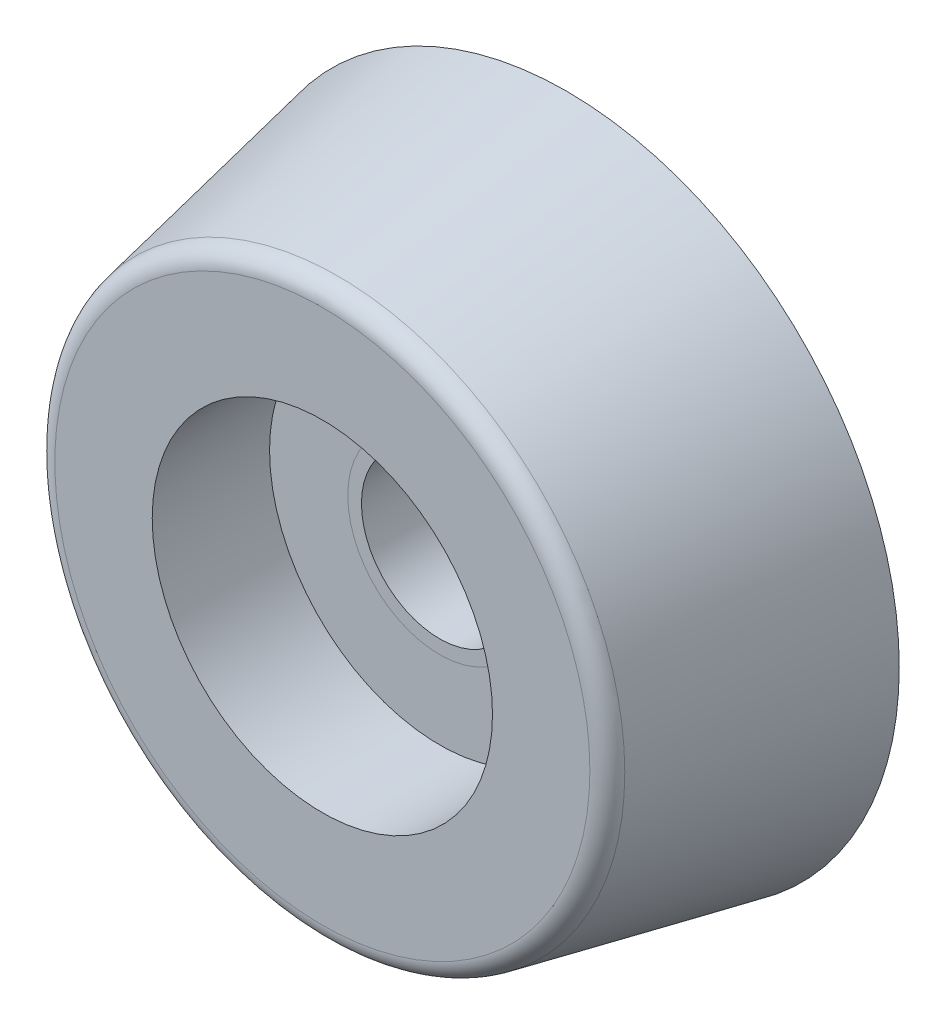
ISO-10303-21;
HEADER;
FILE_DESCRIPTION(('STEP AP214'),'2;1');
FILE_NAME('part.step','',(''),(''),'','','');
FILE_SCHEMA(('AUTOMOTIVE_DESIGN { 1 0 10303 214 1 1 1 1 }'));
ENDSEC;
DATA;
#1=APPLICATION_CONTEXT('core data for automotive mechanical design processes');
#2=APPLICATION_PROTOCOL_DEFINITION('international standard','automotive_design',2000,#1);
#3=PRODUCT_CONTEXT('',#1,'mechanical');
#4=PRODUCT('Part','Part','',(#3));
#5=PRODUCT_RELATED_PRODUCT_CATEGORY('part','',(#4));
#6=PRODUCT_DEFINITION_FORMATION('','',#4);
#7=PRODUCT_DEFINITION_CONTEXT('part definition',#1,'design');
#8=PRODUCT_DEFINITION('design','',#6,#7);
#9=PRODUCT_DEFINITION_SHAPE('','',#8);
#10=(LENGTH_UNIT() NAMED_UNIT(*) SI_UNIT(.MILLI.,.METRE.));
#11=(NAMED_UNIT(*) PLANE_ANGLE_UNIT() SI_UNIT($,.RADIAN.));
#12=(NAMED_UNIT(*) SI_UNIT($,.STERADIAN.) SOLID_ANGLE_UNIT());
#13=UNCERTAINTY_MEASURE_WITH_UNIT(LENGTH_MEASURE(1.E-05),#10,'distance_accuracy_value','');
#14=(GEOMETRIC_REPRESENTATION_CONTEXT(3) GLOBAL_UNCERTAINTY_ASSIGNED_CONTEXT((#13)) GLOBAL_UNIT_ASSIGNED_CONTEXT((#10,
#11,#12)) REPRESENTATION_CONTEXT('',''));
#15=CARTESIAN_POINT('',(0.,0.,0.));
#16=DIRECTION('',(0.,0.,1.));
#17=DIRECTION('',(1.,0.,0.));
#18=AXIS2_PLACEMENT_3D('',#15,#16,#17);
#19=CARTESIAN_POINT('',(0.,0.,0.));
#20=DIRECTION('',(0.,0.,1.));
#21=DIRECTION('',(1.,0.,0.));
#22=AXIS2_PLACEMENT_3D('',#19,#20,#21);
#23=PLANE('',#22);
#24=CARTESIAN_POINT('',(0.,0.,0.));
#25=DIRECTION('',(0.,0.,1.));
#26=DIRECTION('',(1.,0.,0.));
#27=AXIS2_PLACEMENT_3D('',#24,#25,#26);
#28=CIRCLE('',#27,6.6643529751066);
#29=CARTESIAN_POINT('',(5.09172258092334,-4.29976298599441,0.));
#30=VERTEX_POINT('',#29);
#31=CARTESIAN_POINT('',(6.64078312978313,-0.56,0.));
#32=VERTEX_POINT('',#31);
#33=EDGE_CURVE('P0_E1043',#30,#32,#28,.T.);
#34=ORIENTED_EDGE('',*,*,#33,.T.);
#35=DIRECTION('',(-1.,0.,0.));
#36=VECTOR('',#35,1.);
#37=CARTESIAN_POINT('',(6.64078312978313,-0.56,0.));
#38=LINE('',#37,#36);
#39=CARTESIAN_POINT('',(4.3,-0.56,0.));
#40=VERTEX_POINT('',#39);
#41=EDGE_CURVE('P0_E1088',#32,#40,#38,.T.);
#42=ORIENTED_EDGE('',*,*,#41,.T.);
#43=DIRECTION('',(0.,-1.,0.));
#44=VECTOR('',#43,1.);
#45=CARTESIAN_POINT('',(4.3,0.56,0.));
#46=LINE('',#45,#44);
#47=CARTESIAN_POINT('',(4.3,0.56,0.));
#48=VERTEX_POINT('',#47);
#49=EDGE_CURVE('P0_E1036',#48,#40,#46,.T.);
#50=ORIENTED_EDGE('',*,*,#49,.F.);
#51=DIRECTION('',(-1.,0.,0.));
#52=VECTOR('',#51,1.);
#53=CARTESIAN_POINT('',(6.64078312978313,0.56,0.));
#54=LINE('',#53,#52);
#55=CARTESIAN_POINT('',(6.64078312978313,0.56,0.));
#56=VERTEX_POINT('',#55);
#57=EDGE_CURVE('P0_E1061',#56,#48,#54,.T.);
#58=ORIENTED_EDGE('',*,*,#57,.F.);
#59=CARTESIAN_POINT('',(0.,0.,0.));
#60=DIRECTION('',(0.,0.,1.));
#61=DIRECTION('',(1.,0.,0.));
#62=AXIS2_PLACEMENT_3D('',#59,#60,#61);
#63=CIRCLE('',#62,6.6643529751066);
#64=CARTESIAN_POINT('',(5.09172258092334,4.29976298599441,0.));
#65=VERTEX_POINT('',#64);
#66=EDGE_CURVE('P0_E1116',#56,#65,#63,.T.);
#67=ORIENTED_EDGE('',*,*,#66,.T.);
#68=DIRECTION('',(-0.707106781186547,-0.707106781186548,0.));
#69=VECTOR('',#68,1.);
#70=CARTESIAN_POINT('',(5.09172258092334,4.29976298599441,0.));
#71=LINE('',#70,#69);
#72=CARTESIAN_POINT('',(3.43653895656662,2.64457936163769,0.));
#73=VERTEX_POINT('',#72);
#74=EDGE_CURVE('P0_E1107',#65,#73,#71,.T.);
#75=ORIENTED_EDGE('',*,*,#74,.T.);
#76=DIRECTION('',(0.707106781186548,-0.707106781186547,0.));
#77=VECTOR('',#76,1.);
#78=CARTESIAN_POINT('',(2.64457936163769,3.43653895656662,0.));
#79=LINE('',#78,#77);
#80=CARTESIAN_POINT('',(2.64457936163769,3.43653895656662,0.));
#81=VERTEX_POINT('',#80);
#82=EDGE_CURVE('P0_E1095',#81,#73,#79,.T.);
#83=ORIENTED_EDGE('',*,*,#82,.F.);
#84=DIRECTION('',(-0.707106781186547,-0.707106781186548,0.));
#85=VECTOR('',#84,1.);
#86=CARTESIAN_POINT('',(4.2997629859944,5.09172258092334,0.));
#87=LINE('',#86,#85);
#88=CARTESIAN_POINT('',(4.2997629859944,5.09172258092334,0.));
#89=VERTEX_POINT('',#88);
#90=EDGE_CURVE('P0_E855',#89,#81,#87,.T.);
#91=ORIENTED_EDGE('',*,*,#90,.F.);
#92=CARTESIAN_POINT('',(0.,0.,0.));
#93=DIRECTION('',(0.,0.,1.));
#94=DIRECTION('',(1.,0.,0.));
#95=AXIS2_PLACEMENT_3D('',#92,#93,#94);
#96=CIRCLE('',#95,6.6643529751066);
#97=CARTESIAN_POINT('',(0.56,6.64078312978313,0.));
#98=VERTEX_POINT('',#97);
#99=EDGE_CURVE('P0_E1178',#89,#98,#96,.T.);
#100=ORIENTED_EDGE('',*,*,#99,.T.);
#101=DIRECTION('',(0.,-1.,0.));
#102=VECTOR('',#101,1.);
#103=CARTESIAN_POINT('',(0.56,6.64078312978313,0.));
#104=LINE('',#103,#102);
#105=CARTESIAN_POINT('',(0.56,4.3,0.));
#106=VERTEX_POINT('',#105);
#107=EDGE_CURVE('P0_E1174',#98,#106,#104,.T.);
#108=ORIENTED_EDGE('',*,*,#107,.T.);
#109=DIRECTION('',(1.,0.,0.));
#110=VECTOR('',#109,1.);
#111=CARTESIAN_POINT('',(-0.56,4.3,0.));
#112=LINE('',#111,#110);
#113=CARTESIAN_POINT('',(-0.56,4.3,0.));
#114=VERTEX_POINT('',#113);
#115=EDGE_CURVE('P0_E1166',#114,#106,#112,.T.);
#116=ORIENTED_EDGE('',*,*,#115,.F.);
#117=DIRECTION('',(0.,-1.,0.));
#118=VECTOR('',#117,1.);
#119=CARTESIAN_POINT('',(-0.56,6.64078312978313,0.));
#120=LINE('',#119,#118);
#121=CARTESIAN_POINT('',(-0.56,6.64078312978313,0.));
#122=VERTEX_POINT('',#121);
#123=EDGE_CURVE('P0_E914',#122,#114,#120,.T.);
#124=ORIENTED_EDGE('',*,*,#123,.F.);
#125=CARTESIAN_POINT('',(0.,0.,0.));
#126=DIRECTION('',(0.,0.,1.));
#127=DIRECTION('',(1.,0.,0.));
#128=AXIS2_PLACEMENT_3D('',#125,#126,#127);
#129=CIRCLE('',#128,6.6643529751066);
#130=CARTESIAN_POINT('',(-4.29976298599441,5.09172258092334,0.));
#131=VERTEX_POINT('',#130);
#132=EDGE_CURVE('P0_E1148',#122,#131,#129,.T.);
#133=ORIENTED_EDGE('',*,*,#132,.T.);
#134=DIRECTION('',(0.707106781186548,-0.707106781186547,0.));
#135=VECTOR('',#134,1.);
#136=CARTESIAN_POINT('',(-4.29976298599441,5.09172258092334,0.));
#137=LINE('',#136,#135);
#138=CARTESIAN_POINT('',(-2.64457936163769,3.43653895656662,0.));
#139=VERTEX_POINT('',#138);
#140=EDGE_CURVE('P0_E1191',#131,#139,#137,.T.);
#141=ORIENTED_EDGE('',*,*,#140,.T.);
#142=DIRECTION('',(0.707106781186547,0.707106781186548,0.));
#143=VECTOR('',#142,1.);
#144=CARTESIAN_POINT('',(-3.43653895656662,2.64457936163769,0.));
#145=LINE('',#144,#143);
#146=CARTESIAN_POINT('',(-3.43653895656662,2.64457936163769,0.));
#147=VERTEX_POINT('',#146);
#148=EDGE_CURVE('P0_E1183',#147,#139,#145,.T.);
#149=ORIENTED_EDGE('',*,*,#148,.F.);
#150=DIRECTION('',(0.707106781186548,-0.707106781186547,0.));
#151=VECTOR('',#150,1.);
#152=CARTESIAN_POINT('',(-5.09172258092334,4.29976298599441,0.));
#153=LINE('',#152,#151);
#154=CARTESIAN_POINT('',(-5.09172258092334,4.29976298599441,0.));
#155=VERTEX_POINT('',#154);
#156=EDGE_CURVE('P0_E773',#155,#147,#153,.T.);
#157=ORIENTED_EDGE('',*,*,#156,.F.);
#158=CARTESIAN_POINT('',(0.,0.,0.));
#159=DIRECTION('',(0.,0.,1.));
#160=DIRECTION('',(1.,0.,0.));
#161=AXIS2_PLACEMENT_3D('',#158,#159,#160);
#162=CIRCLE('',#161,6.6643529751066);
#163=CARTESIAN_POINT('',(-6.64078312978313,0.56,0.));
#164=VERTEX_POINT('',#163);
#165=EDGE_CURVE('P0_E1207',#155,#164,#162,.T.);
#166=ORIENTED_EDGE('',*,*,#165,.T.);
#167=DIRECTION('',(1.,0.,0.));
#168=VECTOR('',#167,1.);
#169=CARTESIAN_POINT('',(-6.64078312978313,0.56,0.));
#170=LINE('',#169,#168);
#171=CARTESIAN_POINT('',(-4.3,0.56,0.));
#172=VERTEX_POINT('',#171);
#173=EDGE_CURVE('P0_E1203',#164,#172,#170,.T.);
#174=ORIENTED_EDGE('',*,*,#173,.T.);
#175=DIRECTION('',(0.,1.,0.));
#176=VECTOR('',#175,1.);
#177=CARTESIAN_POINT('',(-4.3,-0.56,0.));
#178=LINE('',#177,#176);
#179=CARTESIAN_POINT('',(-4.3,-0.56,0.));
#180=VERTEX_POINT('',#179);
#181=EDGE_CURVE('P0_E1195',#180,#172,#178,.T.);
#182=ORIENTED_EDGE('',*,*,#181,.F.);
#183=DIRECTION('',(1.,0.,0.));
#184=VECTOR('',#183,1.);
#185=CARTESIAN_POINT('',(-6.64078312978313,-0.56,0.));
#186=LINE('',#185,#184);
#187=CARTESIAN_POINT('',(-6.64078312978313,-0.56,0.));
#188=VERTEX_POINT('',#187);
#189=EDGE_CURVE('P0_E1051',#188,#180,#186,.T.);
#190=ORIENTED_EDGE('',*,*,#189,.F.);
#191=CARTESIAN_POINT('',(0.,0.,0.));
#192=DIRECTION('',(0.,0.,1.));
#193=DIRECTION('',(1.,0.,0.));
#194=AXIS2_PLACEMENT_3D('',#191,#192,#193);
#195=CIRCLE('',#194,6.6643529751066);
#196=CARTESIAN_POINT('',(-5.09172258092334,-4.29976298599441,0.));
#197=VERTEX_POINT('',#196);
#198=EDGE_CURVE('P0_E1108',#188,#197,#195,.T.);
#199=ORIENTED_EDGE('',*,*,#198,.T.);
#200=DIRECTION('',(0.707106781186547,0.707106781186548,0.));
#201=VECTOR('',#200,1.);
#202=CARTESIAN_POINT('',(-5.09172258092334,-4.29976298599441,0.));
#203=LINE('',#202,#201);
#204=CARTESIAN_POINT('',(-3.43653895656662,-2.64457936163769,0.));
#205=VERTEX_POINT('',#204);
#206=EDGE_CURVE('P0_E1220',#197,#205,#203,.T.);
#207=ORIENTED_EDGE('',*,*,#206,.T.);
#208=DIRECTION('',(-0.707106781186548,0.707106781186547,0.));
#209=VECTOR('',#208,1.);
#210=CARTESIAN_POINT('',(-2.64457936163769,-3.43653895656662,0.));
#211=LINE('',#210,#209);
#212=CARTESIAN_POINT('',(-2.64457936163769,-3.43653895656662,0.));
#213=VERTEX_POINT('',#212);
#214=EDGE_CURVE('P0_E1212',#213,#205,#211,.T.);
#215=ORIENTED_EDGE('',*,*,#214,.F.);
#216=DIRECTION('',(0.707106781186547,0.707106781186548,0.));
#217=VECTOR('',#216,1.);
#218=CARTESIAN_POINT('',(-4.29976298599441,-5.09172258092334,0.));
#219=LINE('',#218,#217);
#220=CARTESIAN_POINT('',(-4.29976298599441,-5.09172258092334,0.));
#221=VERTEX_POINT('',#220);
#222=EDGE_CURVE('P0_E943',#221,#213,#219,.T.);
#223=ORIENTED_EDGE('',*,*,#222,.F.);
#224=CARTESIAN_POINT('',(0.,0.,0.));
#225=DIRECTION('',(0.,0.,1.));
#226=DIRECTION('',(1.,0.,0.));
#227=AXIS2_PLACEMENT_3D('',#224,#225,#226);
#228=CIRCLE('',#227,6.6643529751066);
#229=CARTESIAN_POINT('',(-0.56,-6.64078312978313,0.));
#230=VERTEX_POINT('',#229);
#231=EDGE_CURVE('P0_E1027',#221,#230,#228,.T.);
#232=ORIENTED_EDGE('',*,*,#231,.T.);
#233=DIRECTION('',(0.,1.,0.));
#234=VECTOR('',#233,1.);
#235=CARTESIAN_POINT('',(-0.56,-6.64078312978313,0.));
#236=LINE('',#235,#234);
#237=CARTESIAN_POINT('',(-0.56,-4.3,0.));
#238=VERTEX_POINT('',#237);
#239=EDGE_CURVE('P0_E1008',#230,#238,#236,.T.);
#240=ORIENTED_EDGE('',*,*,#239,.T.);
#241=DIRECTION('',(-1.,0.,0.));
#242=VECTOR('',#241,1.);
#243=CARTESIAN_POINT('',(0.56,-4.3,0.));
#244=LINE('',#243,#242);
#245=CARTESIAN_POINT('',(0.56,-4.3,0.));
#246=VERTEX_POINT('',#245);
#247=EDGE_CURVE('P0_E1009',#246,#238,#244,.T.);
#248=ORIENTED_EDGE('',*,*,#247,.F.);
#249=DIRECTION('',(0.,1.,0.));
#250=VECTOR('',#249,1.);
#251=CARTESIAN_POINT('',(0.56,-6.64078312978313,0.));
#252=LINE('',#251,#250);
#253=CARTESIAN_POINT('',(0.56,-6.64078312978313,0.));
#254=VERTEX_POINT('',#253);
#255=EDGE_CURVE('P0_E876',#254,#246,#252,.T.);
#256=ORIENTED_EDGE('',*,*,#255,.F.);
#257=CARTESIAN_POINT('',(0.,0.,0.));
#258=DIRECTION('',(0.,0.,1.));
#259=DIRECTION('',(1.,0.,0.));
#260=AXIS2_PLACEMENT_3D('',#257,#258,#259);
#261=CIRCLE('',#260,6.6643529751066);
#262=CARTESIAN_POINT('',(4.29976298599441,-5.09172258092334,0.));
#263=VERTEX_POINT('',#262);
#264=EDGE_CURVE('P0_E1255',#254,#263,#261,.T.);
#265=ORIENTED_EDGE('',*,*,#264,.T.);
#266=DIRECTION('',(-0.707106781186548,0.707106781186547,0.));
#267=VECTOR('',#266,1.);
#268=CARTESIAN_POINT('',(4.29976298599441,-5.09172258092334,0.));
#269=LINE('',#268,#267);
#270=CARTESIAN_POINT('',(2.64457936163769,-3.43653895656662,0.));
#271=VERTEX_POINT('',#270);
#272=EDGE_CURVE('P0_E1239',#263,#271,#269,.T.);
#273=ORIENTED_EDGE('',*,*,#272,.T.);
#274=DIRECTION('',(-0.707106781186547,-0.707106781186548,0.));
#275=VECTOR('',#274,1.);
#276=CARTESIAN_POINT('',(3.43653895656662,-2.64457936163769,0.));
#277=LINE('',#276,#275);
#278=CARTESIAN_POINT('',(3.43653895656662,-2.64457936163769,0.));
#279=VERTEX_POINT('',#278);
#280=EDGE_CURVE('P0_E1231',#279,#271,#277,.T.);
#281=ORIENTED_EDGE('',*,*,#280,.F.);
#282=DIRECTION('',(-0.707106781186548,0.707106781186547,0.));
#283=VECTOR('',#282,1.);
#284=CARTESIAN_POINT('',(5.09172258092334,-4.29976298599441,0.));
#285=LINE('',#284,#283);
#286=EDGE_CURVE('P0_E1010',#30,#279,#285,.T.);
#287=ORIENTED_EDGE('',*,*,#286,.F.);
#288=EDGE_LOOP('',(#34,#42,#50,#58,#67,#75,#83,#91,#100,#108,#116,#124,#133,#141,#149,#157,#166,
#174,#182,#190,#199,#207,#215,#223,#232,#240,#248,#256,#265,#273,#281,#287));
#289=FACE_BOUND('',#288,.T.);
#290=CARTESIAN_POINT('',(0.,0.,0.));
#291=DIRECTION('',(0.,0.,1.));
#292=DIRECTION('',(1.,0.,0.));
#293=AXIS2_PLACEMENT_3D('',#290,#291,#292);
#294=CIRCLE('',#293,8.5);
#295=CARTESIAN_POINT('',(-8.5,0.,0.));
#296=VERTEX_POINT('',#295);
#297=EDGE_CURVE('P0_E1279',#296,#296,#294,.T.);
#298=ORIENTED_EDGE('',*,*,#297,.F.);
#299=EDGE_LOOP('',(#298));
#300=FACE_BOUND('',#299,.T.);
#301=ADVANCED_FACE('P0_F17',(#289,#300),#23,.F.);
#302=CARTESIAN_POINT('',(0.,0.,3.25));
#303=DIRECTION('',(0.,0.,1.));
#304=DIRECTION('',(1.,0.,0.));
#305=AXIS2_PLACEMENT_3D('',#302,#303,#304);
#306=PLANE('',#305);
#307=CARTESIAN_POINT('',(0.,0.,3.25));
#308=DIRECTION('',(0.,0.,-1.));
#309=DIRECTION('',(1.,0.,0.));
#310=AXIS2_PLACEMENT_3D('',#307,#308,#309);
#311=CIRCLE('',#310,2.35);
#312=CARTESIAN_POINT('',(-2.35,0.,3.25));
#313=VERTEX_POINT('',#312);
#314=EDGE_CURVE('P0_E1243',#313,#313,#311,.T.);
#315=ORIENTED_EDGE('',*,*,#314,.T.);
#316=EDGE_LOOP('',(#315));
#317=FACE_BOUND('',#316,.T.);
#318=CARTESIAN_POINT('',(0.,0.,3.25));
#319=DIRECTION('',(0.,0.,1.));
#320=DIRECTION('',(1.,0.,0.));
#321=AXIS2_PLACEMENT_3D('',#318,#319,#320);
#322=CIRCLE('',#321,4.35);
#323=CARTESIAN_POINT('',(-4.35,0.,3.25));
#324=VERTEX_POINT('',#323);
#325=EDGE_CURVE('P0_E27',#324,#324,#322,.T.);
#326=ORIENTED_EDGE('',*,*,#325,.T.);
#327=EDGE_LOOP('',(#326));
#328=FACE_BOUND('',#327,.T.);
#329=ADVANCED_FACE('P0_F1499',(#317,#328),#306,.T.);
#330=CARTESIAN_POINT('',(0.,0.,3.25));
#331=DIRECTION('',(0.,0.,1.));
#332=DIRECTION('',(1.,0.,0.));
#333=AXIS2_PLACEMENT_3D('',#330,#331,#332);
#334=CYLINDRICAL_SURFACE('',#333,4.35);
#335=ORIENTED_EDGE('',*,*,#325,.F.);
#336=DIRECTION('',(0.,0.,1.));
#337=VECTOR('',#336,1.);
#338=CARTESIAN_POINT('',(-4.35,0.,3.25));
#339=LINE('',#338,#337);
#340=CARTESIAN_POINT('',(-4.35,0.,6.25));
#341=VERTEX_POINT('',#340);
#342=EDGE_CURVE('P0_E11',#324,#341,#339,.T.);
#343=ORIENTED_EDGE('',*,*,#342,.T.);
#344=CARTESIAN_POINT('',(0.,0.,6.25));
#345=DIRECTION('',(0.,0.,-1.));
#346=DIRECTION('',(1.,0.,0.));
#347=AXIS2_PLACEMENT_3D('',#344,#345,#346);
#348=CIRCLE('',#347,4.35);
#349=EDGE_CURVE('P0_E1282',#341,#341,#348,.T.);
#350=ORIENTED_EDGE('',*,*,#349,.F.);
#351=ORIENTED_EDGE('',*,*,#342,.F.);
#352=EDGE_LOOP('',(#335,#343,#350,#351));
#353=FACE_BOUND('',#352,.T.);
#354=ADVANCED_FACE('P0_F1504',(#353),#334,.F.);
#355=CARTESIAN_POINT('',(0.,0.,6.25));
#356=DIRECTION('',(0.,0.,1.));
#357=DIRECTION('',(1.,0.,0.));
#358=AXIS2_PLACEMENT_3D('',#355,#356,#357);
#359=PLANE('',#358);
#360=ORIENTED_EDGE('',*,*,#349,.T.);
#361=EDGE_LOOP('',(#360));
#362=FACE_BOUND('',#361,.T.);
#363=CARTESIAN_POINT('',(0.,0.,6.25));
#364=DIRECTION('',(0.,0.,-1.));
#365=DIRECTION('',(1.,0.,0.));
#366=AXIS2_PLACEMENT_3D('',#363,#364,#365);
#367=CIRCLE('',#366,6.84009804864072);
#368=CARTESIAN_POINT('',(6.84009804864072,0.,6.25));
#369=VERTEX_POINT('',#368);
#370=EDGE_CURVE('P0_E891',#369,#369,#367,.T.);
#371=ORIENTED_EDGE('',*,*,#370,.F.);
#372=EDGE_LOOP('',(#371));
#373=FACE_BOUND('',#372,.T.);
#374=ADVANCED_FACE('P0_F1528',(#362,#373),#359,.T.);
#375=CARTESIAN_POINT('',(0.,0.,3.125));
#376=DIRECTION('',(0.,0.,-1.));
#377=DIRECTION('',(1.,0.,0.));
#378=AXIS2_PLACEMENT_3D('',#375,#376,#377);
#379=CONICAL_SURFACE('',#378,7.875,0.197395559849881);
#380=CARTESIAN_POINT('',(0.,0.,5.84805806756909));
#381=DIRECTION('',(0.,0.,1.));
#382=DIRECTION('',(1.,0.,0.));
#383=AXIS2_PLACEMENT_3D('',#380,#381,#382);
#384=CIRCLE('',#383,7.33038838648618);
#385=CARTESIAN_POINT('',(-7.33038838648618,0.,5.84805806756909));
#386=VERTEX_POINT('',#385);
#387=CARTESIAN_POINT('',(7.33038838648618,0.,5.84805806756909));
#388=VERTEX_POINT('',#387);
#389=EDGE_CURVE('P0_E1265',#386,#388,#384,.T.);
#390=ORIENTED_EDGE('',*,*,#389,.F.);
#391=DIRECTION('',(-0.196116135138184,0.,-0.98058067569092));
#392=VECTOR('',#391,1.);
#393=CARTESIAN_POINT('',(-7.875,0.,3.125));
#394=LINE('',#393,#392);
#395=EDGE_CURVE('P0_E1275',#386,#296,#394,.T.);
#396=ORIENTED_EDGE('',*,*,#395,.T.);
#397=ORIENTED_EDGE('',*,*,#297,.T.);
#398=ORIENTED_EDGE('',*,*,#395,.F.);
#399=CARTESIAN_POINT('',(0.,0.,5.84805806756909));
#400=DIRECTION('',(0.,0.,1.));
#401=DIRECTION('',(1.,0.,0.));
#402=AXIS2_PLACEMENT_3D('',#399,#400,#401);
#403=CIRCLE('',#402,7.33038838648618);
#404=EDGE_CURVE('P0_E894',#388,#386,#403,.T.);
#405=ORIENTED_EDGE('',*,*,#404,.F.);
#406=EDGE_LOOP('',(#390,#396,#397,#398,#405));
#407=FACE_BOUND('',#406,.T.);
#408=ADVANCED_FACE('P0_F1315',(#407),#379,.T.);
#409=CARTESIAN_POINT('',(0.,0.,5.75));
#410=DIRECTION('',(0.,0.,-1.));
#411=DIRECTION('',(-1.,0.,0.));
#412=AXIS2_PLACEMENT_3D('',#409,#410,#411);
#413=TOROIDAL_SURFACE('',#412,6.84009804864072,0.5);
#414=ORIENTED_EDGE('',*,*,#389,.T.);
#415=CARTESIAN_POINT('',(6.84009804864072,0.,5.75));
#416=DIRECTION('',(0.,-1.,0.));
#417=DIRECTION('',(1.,0.,0.));
#418=AXIS2_PLACEMENT_3D('',#415,#416,#417);
#419=CIRCLE('',#418,0.5);
#420=EDGE_CURVE('P0_E895',#388,#369,#419,.T.);
#421=ORIENTED_EDGE('',*,*,#420,.T.);
#422=ORIENTED_EDGE('',*,*,#370,.T.);
#423=ORIENTED_EDGE('',*,*,#420,.F.);
#424=ORIENTED_EDGE('',*,*,#404,.T.);
#425=EDGE_LOOP('',(#414,#421,#422,#423,#424));
#426=FACE_BOUND('',#425,.T.);
#427=ADVANCED_FACE('P0_F19',(#426),#413,.T.);
#428=CARTESIAN_POINT('',(0.,0.,0.15));
#429=DIRECTION('',(0.,0.,1.));
#430=DIRECTION('',(1.,0.,0.));
#431=AXIS2_PLACEMENT_3D('',#428,#429,#430);
#432=PLANE('',#431);
#433=CARTESIAN_POINT('',(0.,0.,0.15));
#434=DIRECTION('',(0.,0.,1.));
#435=DIRECTION('',(1.,0.,0.));
#436=AXIS2_PLACEMENT_3D('',#433,#434,#435);
#437=CIRCLE('',#436,2.35);
#438=CARTESIAN_POINT('',(-2.35,0.,0.15));
#439=VERTEX_POINT('',#438);
#440=EDGE_CURVE('P0_E1252',#439,#439,#437,.T.);
#441=ORIENTED_EDGE('',*,*,#440,.T.);
#442=EDGE_LOOP('',(#441));
#443=FACE_BOUND('',#442,.T.);
#444=CARTESIAN_POINT('',(0.,0.,0.15));
#445=DIRECTION('',(0.,0.,-1.));
#446=DIRECTION('',(1.,0.,0.));
#447=AXIS2_PLACEMENT_3D('',#444,#445,#446);
#448=CIRCLE('',#447,3.8);
#449=CARTESIAN_POINT('',(-3.8,0.,0.15));
#450=VERTEX_POINT('',#449);
#451=EDGE_CURVE('P0_E1262',#450,#450,#448,.T.);
#452=ORIENTED_EDGE('',*,*,#451,.T.);
#453=EDGE_LOOP('',(#452));
#454=FACE_BOUND('',#453,.T.);
#455=ADVANCED_FACE('P0_F2831',(#443,#454),#432,.F.);
#456=CARTESIAN_POINT('',(0.,0.,-3.75));
#457=DIRECTION('',(0.,0.,1.));
#458=DIRECTION('',(1.,0.,0.));
#459=AXIS2_PLACEMENT_3D('',#456,#457,#458);
#460=CYLINDRICAL_SURFACE('',#459,3.8);
#461=CARTESIAN_POINT('',(0.,0.,0.950000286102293));
#462=DIRECTION('',(0.,0.,-1.));
#463=DIRECTION('',(1.,0.,0.));
#464=AXIS2_PLACEMENT_3D('',#461,#462,#463);
#465=CIRCLE('',#464,3.8);
#466=CARTESIAN_POINT('',(-3.8,0.,0.950000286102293));
#467=VERTEX_POINT('',#466);
#468=EDGE_CURVE('P0_E1161',#467,#467,#465,.T.);
#469=ORIENTED_EDGE('',*,*,#468,.T.);
#470=DIRECTION('',(0.,0.,-1.));
#471=VECTOR('',#470,1.);
#472=CARTESIAN_POINT('',(-3.8,0.,-3.75));
#473=LINE('',#472,#471);
#474=EDGE_CURVE('P0_E1258',#467,#450,#473,.T.);
#475=ORIENTED_EDGE('',*,*,#474,.T.);
#476=ORIENTED_EDGE('',*,*,#451,.F.);
#477=ORIENTED_EDGE('',*,*,#474,.F.);
#478=EDGE_LOOP('',(#469,#475,#476,#477));
#479=FACE_BOUND('',#478,.T.);
#480=ADVANCED_FACE('P0_F2823',(#479),#460,.T.);
#481=CARTESIAN_POINT('',(0.,0.,2.77199095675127));
#482=DIRECTION('',(0.,0.,-1.));
#483=DIRECTION('',(1.,0.,0.));
#484=AXIS2_PLACEMENT_3D('',#481,#482,#483);
#485=CONICAL_SURFACE('',#484,6.10995478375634,0.197395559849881);
#486=CARTESIAN_POINT('',(0.56,-6.64078312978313,0.));
#487=CARTESIAN_POINT('',(0.56,-6.37225458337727,1.33789420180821));
#488=CARTESIAN_POINT('',(0.56,-6.12445099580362,2.57176487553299));
#489=(BOUNDED_CURVE() B_SPLINE_CURVE(2,(#486,#487,#488),.UNSPECIFIED.,.F.,
.F.) B_SPLINE_CURVE_WITH_KNOTS((3,3),(0.,0.262308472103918),
.UNSPECIFIED.) CURVE() GEOMETRIC_REPRESENTATION_ITEM() RATIONAL_B_SPLINE_CURVE((1.,
1.00081276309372,1.)) REPRESENTATION_ITEM(''));
#490=CARTESIAN_POINT('',(0.56,-6.12445099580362,2.57176487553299));
#491=VERTEX_POINT('',#490);
#492=EDGE_CURVE('P0_E880',#254,#491,#489,.T.);
#493=ORIENTED_EDGE('',*,*,#492,.T.);
#494=CARTESIAN_POINT('',(0.,0.,2.57176487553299));
#495=DIRECTION('',(0.,0.,-1.));
#496=DIRECTION('',(1.,0.,0.));
#497=AXIS2_PLACEMENT_3D('',#494,#495,#496);
#498=CIRCLE('',#497,6.15);
#499=CARTESIAN_POINT('',(3.93466103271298,-4.72662062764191,2.57176487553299));
#500=VERTEX_POINT('',#499);
#501=EDGE_CURVE('P0_E1248',#500,#491,#498,.T.);
#502=ORIENTED_EDGE('',*,*,#501,.F.);
#503=CARTESIAN_POINT('',(3.93466103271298,-4.72662062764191,2.57176487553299));
#504=CARTESIAN_POINT('',(4.10988463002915,-4.90184422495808,1.33789420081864));
#505=CARTESIAN_POINT('',(4.29976298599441,-5.09172258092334,0.));
#506=(BOUNDED_CURVE() B_SPLINE_CURVE(2,(#503,#504,#505),.UNSPECIFIED.,.F.,
.F.) B_SPLINE_CURVE_WITH_KNOTS((3,3),(0.,0.262308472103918),
.UNSPECIFIED.) CURVE() GEOMETRIC_REPRESENTATION_ITEM() RATIONAL_B_SPLINE_CURVE((1.,
1.00081276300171,1.)) REPRESENTATION_ITEM(''));
#507=EDGE_CURVE('P0_E1242',#500,#263,#506,.T.);
#508=ORIENTED_EDGE('',*,*,#507,.T.);
#509=ORIENTED_EDGE('',*,*,#264,.F.);
#510=EDGE_LOOP('',(#493,#502,#508,#509));
#511=FACE_BOUND('',#510,.T.);
#512=ADVANCED_FACE('P0_F2814',(#511),#485,.F.);
#513=CARTESIAN_POINT('',(0.,0.,4.));
#514=DIRECTION('',(0.,0.,-1.));
#515=DIRECTION('',(1.,0.,0.));
#516=AXIS2_PLACEMENT_3D('',#513,#514,#515);
#517=CYLINDRICAL_SURFACE('',#516,2.35);
#518=ORIENTED_EDGE('',*,*,#314,.F.);
#519=DIRECTION('',(0.,0.,-1.));
#520=VECTOR('',#519,1.);
#521=CARTESIAN_POINT('',(-2.35,0.,4.));
#522=LINE('',#521,#520);
#523=EDGE_CURVE('P0_E1247',#313,#439,#522,.T.);
#524=ORIENTED_EDGE('',*,*,#523,.T.);
#525=ORIENTED_EDGE('',*,*,#440,.F.);
#526=ORIENTED_EDGE('',*,*,#523,.F.);
#527=EDGE_LOOP('',(#518,#524,#525,#526));
#528=FACE_BOUND('',#527,.T.);
#529=ADVANCED_FACE('P0_F1312',(#528),#517,.F.);
#530=CARTESIAN_POINT('',(0.,-6.15,2.57176487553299));
#531=CARTESIAN_POINT('',(2.54741340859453,-6.15000000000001,2.57176487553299));
#532=CARTESIAN_POINT('',(4.34870670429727,-4.34870670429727,2.57176487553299));
#533=CARTESIAN_POINT('',(0.,-5.12627304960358,1.69397853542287));
#534=CARTESIAN_POINT('',(2.12337182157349,-5.12627304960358,1.69397853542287));
#535=CARTESIAN_POINT('',(3.62482243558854,-3.62482243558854,1.69397853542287));
#536=CARTESIAN_POINT('',(0.,-3.8,1.45));
#537=CARTESIAN_POINT('',(1.57401153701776,-3.8,1.45));
#538=CARTESIAN_POINT('',(2.68700576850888,-2.68700576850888,1.45));
#539=(BOUNDED_SURFACE() B_SPLINE_SURFACE(2,2,((#530,#531,#532),(#533,#534,#535),(#536,#537,
#538)),.UNSPECIFIED.,.F.,.F.,.F.) B_SPLINE_SURFACE_WITH_KNOTS((3,3),(3,3),(0.861997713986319,
1.38887226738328),(1.5707963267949,2.35619449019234),
.UNSPECIFIED.) GEOMETRIC_REPRESENTATION_ITEM() RATIONAL_B_SPLINE_SURFACE(((1.,0.923879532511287,
1.),(0.96550061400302,0.89200625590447,0.96550061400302),(1.,0.923879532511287,1.))) REPRESENTATION_ITEM('') SURFACE());
#540=CARTESIAN_POINT('',(0.56,-3.8,1.4577272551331));
#541=CARTESIAN_POINT('',(0.36963516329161,-3.8,1.45238164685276));
#542=CARTESIAN_POINT('',(0.182429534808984,-3.8,1.45));
#543=CARTESIAN_POINT('',(0.,-3.8,1.45));
#544=(BOUNDED_CURVE() B_SPLINE_CURVE(3,(#540,#541,#542,#543),.UNSPECIFIED.,.F.,
.F.) B_SPLINE_CURVE_WITH_KNOTS((4,4),(1.74934245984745,1.80407132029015),
.UNSPECIFIED.) CURVE() GEOMETRIC_REPRESENTATION_ITEM() RATIONAL_B_SPLINE_CURVE((1.,1.,1.,1.)) REPRESENTATION_ITEM(''));
#545=CARTESIAN_POINT('',(0.56,-3.8,1.4577272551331));
#546=VERTEX_POINT('',#545);
#547=CARTESIAN_POINT('',(0.,-3.8,1.45));
#548=VERTEX_POINT('',#547);
#549=EDGE_CURVE('P0_E1111',#546,#548,#544,.T.);
#550=CARTESIAN_POINT('',(0.,0.,1.45));
#551=DIRECTION('',(0.,0.,-1.));
#552=DIRECTION('',(1.,0.,0.));
#553=AXIS2_PLACEMENT_3D('',#550,#551,#552);
#554=CIRCLE('',#553,3.8);
#555=CARTESIAN_POINT('',(2.68700576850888,-2.68700576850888,1.45));
#556=VERTEX_POINT('',#555);
#557=EDGE_CURVE('P0_E799',#556,#548,#554,.T.);
#558=CARTESIAN_POINT('',(2.68700576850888,-2.68700576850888,1.45));
#559=CARTESIAN_POINT('',(2.55800860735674,-2.81600292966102,1.45));
#560=CARTESIAN_POINT('',(2.42563423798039,-2.94837729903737,1.45238164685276));
#561=CARTESIAN_POINT('',(2.29102597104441,-3.08298556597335,1.4577272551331));
#562=(BOUNDED_CURVE() B_SPLINE_CURVE(3,(#558,#559,#560,#561),.UNSPECIFIED.,.F.,
.F.) B_SPLINE_CURVE_WITH_KNOTS((4,4),(1.80407132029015,1.85880018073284),
.UNSPECIFIED.) CURVE() GEOMETRIC_REPRESENTATION_ITEM() RATIONAL_B_SPLINE_CURVE((1.,1.,1.,1.)) REPRESENTATION_ITEM(''));
#563=CARTESIAN_POINT('',(2.29102597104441,-3.08298556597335,1.4577272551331));
#564=VERTEX_POINT('',#563);
#565=EDGE_CURVE('P0_E1236',#556,#564,#562,.T.);
#566=CARTESIAN_POINT('',(2.29102597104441,-3.08298556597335,1.4577272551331));
#567=CARTESIAN_POINT('',(2.35147648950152,-3.14344457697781,1.4740146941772));
#568=CARTESIAN_POINT('',(2.41161345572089,-3.20363596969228,1.49251068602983));
#569=CARTESIAN_POINT('',(2.53553014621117,-3.32770459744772,1.53539376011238));
#570=CARTESIAN_POINT('',(2.59925071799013,-3.39152556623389,1.56011514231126));
#571=CARTESIAN_POINT('',(2.69565360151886,-3.48806356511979,1.60162052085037));
#572=CARTESIAN_POINT('',(2.72872301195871,-3.52117626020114,1.61660802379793));
#573=CARTESIAN_POINT('',(2.7956048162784,-3.58813667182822,1.64845026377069));
#574=CARTESIAN_POINT('',(2.82940678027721,-3.62197365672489,1.66534962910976));
#575=CARTESIAN_POINT('',(2.89768032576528,-3.6903052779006,1.70113020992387));
#576=CARTESIAN_POINT('',(2.93214028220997,-3.72478788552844,1.7200565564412));
#577=CARTESIAN_POINT('',(3.00164805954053,-3.79432688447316,1.76000248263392));
#578=CARTESIAN_POINT('',(3.03668306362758,-3.8293700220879,1.78106745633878));
#579=CARTESIAN_POINT('',(3.10724895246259,-3.89993721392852,1.82539681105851));
#580=CARTESIAN_POINT('',(3.14276580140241,-3.93544680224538,1.84870657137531));
#581=CARTESIAN_POINT('',(3.21419358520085,-4.00684568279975,1.89762497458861));
#582=CARTESIAN_POINT('',(3.25008927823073,-4.04271935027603,1.92327868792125));
#583=CARTESIAN_POINT('',(3.32216311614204,-4.11473677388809,1.97697603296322));
#584=CARTESIAN_POINT('',(3.35832485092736,-4.15086381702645,2.00506411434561));
#585=CARTESIAN_POINT('',(3.43080961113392,-4.22327031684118,2.06371103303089));
#586=CARTESIAN_POINT('',(3.46711512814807,-4.25953206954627,2.09431337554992));
#587=CARTESIAN_POINT('',(3.53975720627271,-4.33208268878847,2.15805768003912));
#588=CARTESIAN_POINT('',(3.57607526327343,-4.36835298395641,2.19124187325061));
#589=CARTESIAN_POINT('',(3.64860378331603,-4.44078844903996,2.26020492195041));
#590=CARTESIAN_POINT('',(3.68479488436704,-4.47693433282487,2.29602440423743));
#591=CARTESIAN_POINT('',(3.75692321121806,-4.54898247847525,2.37029779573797));
#592=CARTESIAN_POINT('',(3.79284038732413,-4.58486491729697,2.40879041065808));
#593=CARTESIAN_POINT('',(3.86426848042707,-4.65624301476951,2.48843191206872));
#594=CARTESIAN_POINT('',(3.89975887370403,-4.69171853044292,2.52961726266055));
#595=CARTESIAN_POINT('',(3.93466103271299,-4.72662062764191,2.57176487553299));
#596=B_SPLINE_CURVE_WITH_KNOTS('',3,(#566,#567,#568,#569,#570,#571,#572,#573,#574,#575,#576,
#577,#578,#579,#580,#581,#582,#583,#584,#585,#586,#587,#588,#589,#590,#591,#592,#593,#594,#595),
.UNSPECIFIED.,.F.,.F.,(4,2,2,2,2,2,2,2,2,2,2,2,2,2,4),(0.,0.261091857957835,0.541475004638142,
0.688874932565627,0.841028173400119,0.9978874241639,1.15939242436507,1.32546910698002,
1.49602880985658,1.67096756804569,1.85016550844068,2.03348636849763,2.22077716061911,
2.41186800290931,2.60657213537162),.UNSPECIFIED.);
#597=EDGE_CURVE('P0_E1293',#564,#500,#596,.T.);
#598=CARTESIAN_POINT('',(0.55999999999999,-6.12445099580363,2.57176487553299));
#599=CARTESIAN_POINT('',(0.560000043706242,-6.07509193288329,2.52961726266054));
#600=CARTESIAN_POINT('',(0.560010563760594,-6.02491145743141,2.4884319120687));
#601=CARTESIAN_POINT('',(0.560045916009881,-5.92393223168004,2.40879041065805));
#602=CARTESIAN_POINT('',(0.56007047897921,-5.87316223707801,2.37029779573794));
#603=CARTESIAN_POINT('',(0.560127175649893,-5.7712140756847,2.29602440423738));
#604=CARTESIAN_POINT('',(0.56015914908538,-5.72006410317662,2.26020492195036));
#605=CARTESIAN_POINT('',(0.560224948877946,-5.61755908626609,2.19124187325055));
#606=CARTESIAN_POINT('',(0.560258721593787,-5.56623137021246,2.15805768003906));
#607=CARTESIAN_POINT('',(0.560323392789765,-5.46356462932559,2.09431337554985));
#608=CARTESIAN_POINT('',(0.560354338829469,-5.41225182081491,2.06371103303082));
#609=CARTESIAN_POINT('',(0.560409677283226,-5.30979822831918,2.00506411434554));
#610=CARTESIAN_POINT('',(0.560434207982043,-5.25868234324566,1.97697603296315));
#611=CARTESIAN_POINT('',(0.560474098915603,-5.15679443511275,1.92327868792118));
#612=CARTESIAN_POINT('',(0.560489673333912,-5.10604583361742,1.89762497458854));
#613=CARTESIAN_POINT('',(0.560510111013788,-5.00505213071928,1.84870657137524));
#614=CARTESIAN_POINT('',(0.560515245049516,-4.95482885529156,1.82539681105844));
#615=CARTESIAN_POINT('',(0.560514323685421,-4.85503269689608,1.78106745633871));
#616=CARTESIAN_POINT('',(0.560508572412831,-4.80547996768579,1.76000248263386));
#617=CARTESIAN_POINT('',(0.560486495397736,-4.70715904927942,1.72005655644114));
#618=CARTESIAN_POINT('',(0.56047047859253,-4.65840929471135,1.70113020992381));
#619=CARTESIAN_POINT('',(0.560429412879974,-4.56181485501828,1.66534962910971));
#620=CARTESIAN_POINT('',(0.56040464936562,-4.51398689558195,1.64845026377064));
#621=CARTESIAN_POINT('',(0.560349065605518,-4.41934615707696,1.61660802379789));
#622=CARTESIAN_POINT('',(0.560318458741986,-4.37254834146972,1.60162052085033));
#623=CARTESIAN_POINT('',(0.560222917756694,-4.23611853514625,1.56011514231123));
#624=CARTESIAN_POINT('',(0.560151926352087,-4.14593304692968,1.53539376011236));
#625=CARTESIAN_POINT('',(0.560044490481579,-3.97058094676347,1.49251068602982));
#626=CARTESIAN_POINT('',(0.560006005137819,-3.88549594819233,1.47401469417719));
#627=CARTESIAN_POINT('',(0.560000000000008,-3.8,1.4577272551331));
#628=B_SPLINE_CURVE_WITH_KNOTS('',3,(#598,#599,#600,#601,#602,#603,#604,#605,#606,#607,#608,
#609,#610,#611,#612,#613,#614,#615,#616,#617,#618,#619,#620,#621,#622,#623,#624,#625,#626,#627),
.UNSPECIFIED.,.F.,.F.,(4,2,2,2,2,2,2,2,2,2,2,2,2,2,4),(0.,0.194704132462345,0.385794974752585,
0.573085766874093,0.756406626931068,0.935604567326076,1.1105433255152,1.28110302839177,
1.44717971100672,1.60868471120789,1.76554396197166,1.91769720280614,2.0650971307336,
2.34548027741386,2.60657213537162),.UNSPECIFIED.);
#629=EDGE_CURVE('P0_E1340',#491,#546,#628,.T.);
#630=ORIENTED_EDGE('',*,*,#549,.T.);
#631=ORIENTED_EDGE('',*,*,#557,.F.);
#632=ORIENTED_EDGE('',*,*,#565,.T.);
#633=ORIENTED_EDGE('',*,*,#597,.T.);
#634=ORIENTED_EDGE('',*,*,#501,.T.);
#635=ORIENTED_EDGE('',*,*,#629,.T.);
#636=EDGE_LOOP('',(#630,#631,#632,#633,#634,#635));
#637=FACE_BOUND('',#636,.T.);
#638=ADVANCED_FACE('P0_F1300',(#637),#539,.T.);
#639=CARTESIAN_POINT('',(2.64457936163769,-3.43653895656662,0.));
#640=DIRECTION('',(-0.707106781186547,-0.707106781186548,0.));
#641=DIRECTION('',(-0.707106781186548,0.707106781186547,0.));
#642=AXIS2_PLACEMENT_3D('',#639,#640,#641);
#643=PLANE('',#642);
#644=DIRECTION('',(0.,0.,-1.));
#645=VECTOR('',#644,1.);
#646=CARTESIAN_POINT('',(2.40459157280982,-3.19655116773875,1.45000028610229));
#647=LINE('',#646,#645);
#648=CARTESIAN_POINT('',(2.40459157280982,-3.19655116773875,1.45000028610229));
#649=VERTEX_POINT('',#648);
#650=CARTESIAN_POINT('',(2.40459157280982,-3.19655116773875,0.950000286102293));
#651=VERTEX_POINT('',#650);
#652=EDGE_CURVE('P0_E667',#649,#651,#647,.T.);
#653=ORIENTED_EDGE('',*,*,#652,.T.);
#654=DIRECTION('',(-0.707106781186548,0.707106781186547,0.));
#655=VECTOR('',#654,1.);
#656=CARTESIAN_POINT('',(2.64457936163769,-3.43653895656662,0.950000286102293));
#657=LINE('',#656,#655);
#658=CARTESIAN_POINT('',(2.64457936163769,-3.43653895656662,0.950000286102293));
#659=VERTEX_POINT('',#658);
#660=EDGE_CURVE('P0_E1129',#659,#651,#657,.T.);
#661=ORIENTED_EDGE('',*,*,#660,.F.);
#662=DIRECTION('',(0.,0.,1.));
#663=VECTOR('',#662,1.);
#664=CARTESIAN_POINT('',(2.64457936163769,-3.43653895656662,0.));
#665=LINE('',#664,#663);
#666=EDGE_CURVE('P0_E1235',#271,#659,#665,.T.);
#667=ORIENTED_EDGE('',*,*,#666,.F.);
#668=ORIENTED_EDGE('',*,*,#272,.F.);
#669=ORIENTED_EDGE('',*,*,#507,.F.);
#670=ORIENTED_EDGE('',*,*,#597,.F.);
#671=DIRECTION('',(0.,0.,1.));
#672=VECTOR('',#671,1.);
#673=CARTESIAN_POINT('',(2.29102597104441,-3.08298556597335,0.));
#674=LINE('',#673,#672);
#675=CARTESIAN_POINT('',(2.29102597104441,-3.08298556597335,1.45000028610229));
#676=VERTEX_POINT('',#675);
#677=EDGE_CURVE('P0_E669',#676,#564,#674,.T.);
#678=ORIENTED_EDGE('',*,*,#677,.F.);
#679=DIRECTION('',(0.707106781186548,-0.707106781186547,0.));
#680=VECTOR('',#679,1.);
#681=CARTESIAN_POINT('',(1.12429978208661,-1.91625937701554,1.45000028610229));
#682=LINE('',#681,#680);
#683=EDGE_CURVE('P0_E662',#676,#649,#682,.T.);
#684=ORIENTED_EDGE('',*,*,#683,.T.);
#685=EDGE_LOOP('',(#653,#661,#667,#668,#669,#670,#678,#684));
#686=FACE_BOUND('',#685,.T.);
#687=ADVANCED_FACE('P0_F664',(#686),#643,.T.);
#688=CARTESIAN_POINT('',(3.43653895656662,-2.64457936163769,0.));
#689=DIRECTION('',(-0.707106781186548,0.707106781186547,0.));
#690=DIRECTION('',(0.,0.,1.));
#691=AXIS2_PLACEMENT_3D('',#688,#689,#690);
#692=PLANE('',#691);
#693=DIRECTION('',(0.707106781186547,0.707106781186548,0.));
#694=VECTOR('',#693,1.);
#695=CARTESIAN_POINT('',(3.43653895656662,-2.64457936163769,0.950000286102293));
#696=LINE('',#695,#694);
#697=CARTESIAN_POINT('',(3.43653895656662,-2.64457936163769,0.950000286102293));
#698=VERTEX_POINT('',#697);
#699=EDGE_CURVE('P0_E1126',#659,#698,#696,.T.);
#700=ORIENTED_EDGE('',*,*,#699,.T.);
#701=DIRECTION('',(0.,0.,1.));
#702=VECTOR('',#701,1.);
#703=CARTESIAN_POINT('',(3.43653895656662,-2.64457936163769,0.));
#704=LINE('',#703,#702);
#705=EDGE_CURVE('P0_E1014',#279,#698,#704,.T.);
#706=ORIENTED_EDGE('',*,*,#705,.F.);
#707=ORIENTED_EDGE('',*,*,#280,.T.);
#708=ORIENTED_EDGE('',*,*,#666,.T.);
#709=EDGE_LOOP('',(#700,#706,#707,#708));
#710=FACE_BOUND('',#709,.T.);
#711=ADVANCED_FACE('P0_F2784',(#710),#692,.T.);
#712=CARTESIAN_POINT('',(3.08298556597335,-2.29102597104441,0.));
#713=DIRECTION('',(-0.707106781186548,0.707106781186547,0.));
#714=DIRECTION('',(0.,0.,1.));
#715=AXIS2_PLACEMENT_3D('',#712,#713,#714);
#716=PLANE('',#715);
#717=DIRECTION('',(-0.707106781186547,-0.707106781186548,0.));
#718=VECTOR('',#717,1.);
#719=CARTESIAN_POINT('',(2.88499566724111,-2.48901586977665,1.45000028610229));
#720=LINE('',#719,#718);
#721=EDGE_CURVE('P0_E673',#556,#676,#720,.T.);
#722=ORIENTED_EDGE('',*,*,#721,.T.);
#723=ORIENTED_EDGE('',*,*,#677,.T.);
#724=ORIENTED_EDGE('',*,*,#565,.F.);
#725=EDGE_LOOP('',(#722,#723,#724));
#726=FACE_BOUND('',#725,.T.);
#727=ADVANCED_FACE('P0_F2776',(#726),#716,.T.);
#728=CARTESIAN_POINT('',(0.,0.,2.77199095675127));
#729=DIRECTION('',(0.,0.,-1.));
#730=DIRECTION('',(1.,0.,0.));
#731=AXIS2_PLACEMENT_3D('',#728,#729,#730);
#732=CONICAL_SURFACE('',#731,6.10995478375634,0.197395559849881);
#733=CARTESIAN_POINT('',(-4.2997629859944,-5.09172258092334,0.));
#734=CARTESIAN_POINT('',(-4.10988462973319,-4.90184422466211,1.33789420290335));
#735=CARTESIAN_POINT('',(-3.93466103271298,-4.72662062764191,2.57176487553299));
#736=(BOUNDED_CURVE() B_SPLINE_CURVE(2,(#733,#734,#735),.UNSPECIFIED.,.F.,
.F.) B_SPLINE_CURVE_WITH_KNOTS((3,3),(0.,0.262308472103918),
.UNSPECIFIED.) CURVE() GEOMETRIC_REPRESENTATION_ITEM() RATIONAL_B_SPLINE_CURVE((1.,
1.000812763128,1.)) REPRESENTATION_ITEM(''));
#737=CARTESIAN_POINT('',(-3.93466103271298,-4.72662062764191,2.57176487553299));
#738=VERTEX_POINT('',#737);
#739=EDGE_CURVE('P0_E979',#221,#738,#736,.T.);
#740=ORIENTED_EDGE('',*,*,#739,.T.);
#741=CARTESIAN_POINT('',(0.,0.,2.57176487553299));
#742=DIRECTION('',(0.,0.,-1.));
#743=DIRECTION('',(1.,0.,0.));
#744=AXIS2_PLACEMENT_3D('',#741,#742,#743);
#745=CIRCLE('',#744,6.15);
#746=CARTESIAN_POINT('',(-0.56,-6.12445099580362,2.57176487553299));
#747=VERTEX_POINT('',#746);
#748=EDGE_CURVE('P0_E1030',#747,#738,#745,.T.);
#749=ORIENTED_EDGE('',*,*,#748,.F.);
#750=CARTESIAN_POINT('',(-0.56,-6.12445099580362,2.57176487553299));
#751=CARTESIAN_POINT('',(-0.56,-6.37225458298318,1.33789420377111));
#752=CARTESIAN_POINT('',(-0.56,-6.64078312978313,0.));
#753=(BOUNDED_CURVE() B_SPLINE_CURVE(2,(#750,#751,#752),.UNSPECIFIED.,.F.,
.F.) B_SPLINE_CURVE_WITH_KNOTS((3,3),(0.,0.262308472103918),
.UNSPECIFIED.) CURVE() GEOMETRIC_REPRESENTATION_ITEM() RATIONAL_B_SPLINE_CURVE((1.,
1.00081276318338,1.)) REPRESENTATION_ITEM(''));
#754=EDGE_CURVE('P0_E1230',#747,#230,#753,.T.);
#755=ORIENTED_EDGE('',*,*,#754,.T.);
#756=ORIENTED_EDGE('',*,*,#231,.F.);
#757=EDGE_LOOP('',(#740,#749,#755,#756));
#758=FACE_BOUND('',#757,.T.);
#759=ADVANCED_FACE('P0_F1965',(#758),#732,.F.);
#760=CARTESIAN_POINT('',(-4.34870670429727,-4.34870670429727,2.57176487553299));
#761=CARTESIAN_POINT('',(-2.54741340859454,-6.15000000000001,2.57176487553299));
#762=CARTESIAN_POINT('',(0.,-6.15,2.57176487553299));
#763=CARTESIAN_POINT('',(-3.62482243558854,-3.62482243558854,1.69397853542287));
#764=CARTESIAN_POINT('',(-2.12337182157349,-5.12627304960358,1.69397853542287));
#765=CARTESIAN_POINT('',(0.,-5.12627304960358,1.69397853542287));
#766=CARTESIAN_POINT('',(-2.68700576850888,-2.68700576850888,1.45));
#767=CARTESIAN_POINT('',(-1.57401153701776,-3.8,1.45));
#768=CARTESIAN_POINT('',(0.,-3.8,1.45));
#769=(BOUNDED_SURFACE() B_SPLINE_SURFACE(2,2,((#760,#761,#762),(#763,#764,#765),(#766,#767,
#768)),.UNSPECIFIED.,.F.,.F.,.F.) B_SPLINE_SURFACE_WITH_KNOTS((3,3),(3,3),(0.861997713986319,
1.38887226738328),(0.785398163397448,1.5707963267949),
.UNSPECIFIED.) GEOMETRIC_REPRESENTATION_ITEM() RATIONAL_B_SPLINE_SURFACE(((1.,0.923879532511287,
1.),(0.96550061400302,0.89200625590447,0.96550061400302),(1.,0.923879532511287,1.))) REPRESENTATION_ITEM('') SURFACE());
#770=CARTESIAN_POINT('',(-2.29102597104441,-3.08298556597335,1.4577272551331));
#771=CARTESIAN_POINT('',(-2.42563423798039,-2.94837729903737,1.45238164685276));
#772=CARTESIAN_POINT('',(-2.55800860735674,-2.81600292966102,1.45));
#773=CARTESIAN_POINT('',(-2.68700576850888,-2.68700576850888,1.45));
#774=(BOUNDED_CURVE() B_SPLINE_CURVE(3,(#770,#771,#772,#773),.UNSPECIFIED.,.F.,
.F.) B_SPLINE_CURVE_WITH_KNOTS((4,4),(1.74934245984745,1.80407132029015),
.UNSPECIFIED.) CURVE() GEOMETRIC_REPRESENTATION_ITEM() RATIONAL_B_SPLINE_CURVE((1.,1.,1.,1.)) REPRESENTATION_ITEM(''));
#775=CARTESIAN_POINT('',(-2.29102597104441,-3.08298556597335,1.4577272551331));
#776=VERTEX_POINT('',#775);
#777=CARTESIAN_POINT('',(-2.68700576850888,-2.68700576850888,1.45));
#778=VERTEX_POINT('',#777);
#779=EDGE_CURVE('P0_E1991',#776,#778,#774,.T.);
#780=CARTESIAN_POINT('',(0.,0.,1.45));
#781=DIRECTION('',(0.,0.,-1.));
#782=DIRECTION('',(1.,0.,0.));
#783=AXIS2_PLACEMENT_3D('',#780,#781,#782);
#784=CIRCLE('',#783,3.8);
#785=CARTESIAN_POINT('',(0.,-3.8,1.45));
#786=VERTEX_POINT('',#785);
#787=EDGE_CURVE('P0_E800',#786,#778,#784,.T.);
#788=CARTESIAN_POINT('',(0.,-3.8,1.45));
#789=CARTESIAN_POINT('',(-0.182429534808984,-3.8,1.45));
#790=CARTESIAN_POINT('',(-0.369635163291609,-3.8,1.45238164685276));
#791=CARTESIAN_POINT('',(-0.56,-3.8,1.4577272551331));
#792=(BOUNDED_CURVE() B_SPLINE_CURVE(3,(#788,#789,#790,#791),.UNSPECIFIED.,.F.,
.F.) B_SPLINE_CURVE_WITH_KNOTS((4,4),(1.80407132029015,1.85880018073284),
.UNSPECIFIED.) CURVE() GEOMETRIC_REPRESENTATION_ITEM() RATIONAL_B_SPLINE_CURVE((1.,1.,1.,1.)) REPRESENTATION_ITEM(''));
#793=CARTESIAN_POINT('',(-0.56,-3.8,1.4577272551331));
#794=VERTEX_POINT('',#793);
#795=EDGE_CURVE('P0_E1227',#786,#794,#792,.T.);
#796=CARTESIAN_POINT('',(-0.560000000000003,-3.8,1.4577272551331));
#797=CARTESIAN_POINT('',(-0.560006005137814,-3.88549594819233,1.47401469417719));
#798=CARTESIAN_POINT('',(-0.560044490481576,-3.97058094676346,1.49251068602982));
#799=CARTESIAN_POINT('',(-0.560151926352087,-4.14593304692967,1.53539376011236));
#800=CARTESIAN_POINT('',(-0.560222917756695,-4.23611853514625,1.56011514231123));
#801=CARTESIAN_POINT('',(-0.560318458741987,-4.37254834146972,1.60162052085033));
#802=CARTESIAN_POINT('',(-0.560349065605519,-4.41934615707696,1.61660802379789));
#803=CARTESIAN_POINT('',(-0.560404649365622,-4.51398689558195,1.64845026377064));
#804=CARTESIAN_POINT('',(-0.560429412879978,-4.56181485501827,1.66534962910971));
#805=CARTESIAN_POINT('',(-0.560470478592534,-4.65840929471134,1.70113020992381));
#806=CARTESIAN_POINT('',(-0.56048649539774,-4.70715904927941,1.72005655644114));
#807=CARTESIAN_POINT('',(-0.560508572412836,-4.80547996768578,1.76000248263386));
#808=CARTESIAN_POINT('',(-0.560514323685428,-4.85503269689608,1.78106745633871));
#809=CARTESIAN_POINT('',(-0.560515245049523,-4.95482885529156,1.82539681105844));
#810=CARTESIAN_POINT('',(-0.560510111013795,-5.00505213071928,1.84870657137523));
#811=CARTESIAN_POINT('',(-0.56048967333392,-5.10604583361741,1.89762497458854));
#812=CARTESIAN_POINT('',(-0.560474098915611,-5.15679443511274,1.92327868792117));
#813=CARTESIAN_POINT('',(-0.560434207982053,-5.25868234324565,1.97697603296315));
#814=CARTESIAN_POINT('',(-0.560409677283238,-5.30979822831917,2.00506411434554));
#815=CARTESIAN_POINT('',(-0.560354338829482,-5.4122518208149,2.06371103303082));
#816=CARTESIAN_POINT('',(-0.560323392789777,-5.46356462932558,2.09431337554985));
#817=CARTESIAN_POINT('',(-0.560258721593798,-5.56623137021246,2.15805768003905));
#818=CARTESIAN_POINT('',(-0.560224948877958,-5.61755908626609,2.19124187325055));
#819=CARTESIAN_POINT('',(-0.560159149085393,-5.72006410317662,2.26020492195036));
#820=CARTESIAN_POINT('',(-0.560127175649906,-5.7712140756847,2.29602440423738));
#821=CARTESIAN_POINT('',(-0.560070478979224,-5.87316223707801,2.37029779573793));
#822=CARTESIAN_POINT('',(-0.560045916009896,-5.92393223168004,2.40879041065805));
#823=CARTESIAN_POINT('',(-0.560010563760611,-6.02491145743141,2.4884319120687));
#824=CARTESIAN_POINT('',(-0.560000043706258,-6.07509193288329,2.52961726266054));
#825=CARTESIAN_POINT('',(-0.560000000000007,-6.12445099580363,2.57176487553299));
#826=B_SPLINE_CURVE_WITH_KNOTS('',3,(#796,#797,#798,#799,#800,#801,#802,#803,#804,#805,#806,
#807,#808,#809,#810,#811,#812,#813,#814,#815,#816,#817,#818,#819,#820,#821,#822,#823,#824,#825),
.UNSPECIFIED.,.F.,.F.,(4,2,2,2,2,2,2,2,2,2,2,2,2,2,4),(0.,0.26109185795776,0.541475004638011,
0.688874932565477,0.841028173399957,0.997887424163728,1.15939242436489,1.32546910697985,
1.49602880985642,1.67096756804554,1.85016550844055,2.03348636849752,2.22077716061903,
2.41186800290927,2.60657213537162),.UNSPECIFIED.);
#827=EDGE_CURVE('P0_E1969',#794,#747,#826,.T.);
#828=CARTESIAN_POINT('',(-3.93466103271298,-4.72662062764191,2.57176487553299));
#829=CARTESIAN_POINT('',(-3.89975887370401,-4.69171853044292,2.52961726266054));
#830=CARTESIAN_POINT('',(-3.86426848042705,-4.6562430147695,2.4884319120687));
#831=CARTESIAN_POINT('',(-3.79284038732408,-4.58486491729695,2.40879041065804));
#832=CARTESIAN_POINT('',(-3.756923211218,-4.54898247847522,2.37029779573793));
#833=CARTESIAN_POINT('',(-3.68479488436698,-4.47693433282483,2.29602440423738));
#834=CARTESIAN_POINT('',(-3.64860378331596,-4.44078844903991,2.26020492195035));
#835=CARTESIAN_POINT('',(-3.57607526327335,-4.36835298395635,2.19124187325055));
#836=CARTESIAN_POINT('',(-3.53975720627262,-4.3320826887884,2.15805768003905));
#837=CARTESIAN_POINT('',(-3.46711512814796,-4.2595320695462,2.09431337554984));
#838=CARTESIAN_POINT('',(-3.43080961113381,-4.2232703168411,2.06371103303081));
#839=CARTESIAN_POINT('',(-3.35832485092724,-4.15086381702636,2.00506411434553));
#840=CARTESIAN_POINT('',(-3.32216311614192,-4.11473677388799,1.97697603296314));
#841=CARTESIAN_POINT('',(-3.2500892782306,-4.04271935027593,1.92327868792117));
#842=CARTESIAN_POINT('',(-3.21419358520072,-4.00684568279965,1.89762497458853));
#843=CARTESIAN_POINT('',(-3.14276580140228,-3.93544680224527,1.84870657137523));
#844=CARTESIAN_POINT('',(-3.10724895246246,-3.8999372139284,1.82539681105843));
#845=CARTESIAN_POINT('',(-3.03668306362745,-3.82937002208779,1.7810674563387));
#846=CARTESIAN_POINT('',(-3.0016480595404,-3.79432688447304,1.76000248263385));
#847=CARTESIAN_POINT('',(-2.93214028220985,-3.72478788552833,1.72005655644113));
#848=CARTESIAN_POINT('',(-2.89768032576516,-3.69030527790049,1.70113020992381));
#849=CARTESIAN_POINT('',(-2.8294067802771,-3.62197365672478,1.66534962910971));
#850=CARTESIAN_POINT('',(-2.79560481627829,-3.58813667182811,1.64845026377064));
#851=CARTESIAN_POINT('',(-2.7287230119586,-3.52117626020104,1.61660802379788));
#852=CARTESIAN_POINT('',(-2.69565360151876,-3.48806356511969,1.60162052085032));
#853=CARTESIAN_POINT('',(-2.59925071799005,-3.39152556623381,1.56011514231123));
#854=CARTESIAN_POINT('',(-2.5355301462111,-3.32770459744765,1.53539376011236));
#855=CARTESIAN_POINT('',(-2.41161345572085,-3.20363596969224,1.49251068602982));
#856=CARTESIAN_POINT('',(-2.3514764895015,-3.14344457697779,1.47401469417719));
#857=CARTESIAN_POINT('',(-2.29102597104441,-3.08298556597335,1.4577272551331));
#858=B_SPLINE_CURVE_WITH_KNOTS('',3,(#828,#829,#830,#831,#832,#833,#834,#835,#836,#837,#838,
#839,#840,#841,#842,#843,#844,#845,#846,#847,#848,#849,#850,#851,#852,#853,#854,#855,#856,#857),
.UNSPECIFIED.,.F.,.F.,(4,2,2,2,2,2,2,2,2,2,2,2,2,2,4),(0.,0.194704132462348,0.385794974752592,
0.573085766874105,0.756406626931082,0.935604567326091,1.11054332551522,1.28110302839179,
1.44717971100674,1.60868471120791,1.76554396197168,1.91769720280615,2.06509713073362,
2.34548027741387,2.60657213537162),.UNSPECIFIED.);
#859=EDGE_CURVE('P0_E2086',#738,#776,#858,.T.);
#860=ORIENTED_EDGE('',*,*,#779,.T.);
#861=ORIENTED_EDGE('',*,*,#787,.F.);
#862=ORIENTED_EDGE('',*,*,#795,.T.);
#863=ORIENTED_EDGE('',*,*,#827,.T.);
#864=ORIENTED_EDGE('',*,*,#748,.T.);
#865=ORIENTED_EDGE('',*,*,#859,.T.);
#866=EDGE_LOOP('',(#860,#861,#862,#863,#864,#865));
#867=FACE_BOUND('',#866,.T.);
#868=ADVANCED_FACE('P0_F2043',(#867),#769,.T.);
#869=CARTESIAN_POINT('',(-0.56,-4.3,0.));
#870=DIRECTION('',(-1.,0.,0.));
#871=DIRECTION('',(0.,1.,0.));
#872=AXIS2_PLACEMENT_3D('',#869,#870,#871);
#873=PLANE('',#872);
#874=DIRECTION('',(0.,0.,-1.));
#875=VECTOR('',#874,1.);
#876=CARTESIAN_POINT('',(-0.56,-3.9606060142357,1.45000028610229));
#877=LINE('',#876,#875);
#878=CARTESIAN_POINT('',(-0.56,-3.9606060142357,1.45000028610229));
#879=VERTEX_POINT('',#878);
#880=CARTESIAN_POINT('',(-0.56,-3.9606060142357,0.950000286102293));
#881=VERTEX_POINT('',#880);
#882=EDGE_CURVE('P0_E760',#879,#881,#877,.T.);
#883=ORIENTED_EDGE('',*,*,#882,.T.);
#884=DIRECTION('',(0.,1.,0.));
#885=VECTOR('',#884,1.);
#886=CARTESIAN_POINT('',(-0.56,-4.3,0.950000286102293));
#887=LINE('',#886,#885);
#888=CARTESIAN_POINT('',(-0.56,-4.3,0.950000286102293));
#889=VERTEX_POINT('',#888);
#890=EDGE_CURVE('P0_E1135',#889,#881,#887,.T.);
#891=ORIENTED_EDGE('',*,*,#890,.F.);
#892=DIRECTION('',(0.,0.,1.));
#893=VECTOR('',#892,1.);
#894=CARTESIAN_POINT('',(-0.56,-4.3,0.));
#895=LINE('',#894,#893);
#896=EDGE_CURVE('P0_E1005',#238,#889,#895,.T.);
#897=ORIENTED_EDGE('',*,*,#896,.F.);
#898=ORIENTED_EDGE('',*,*,#239,.F.);
#899=ORIENTED_EDGE('',*,*,#754,.F.);
#900=ORIENTED_EDGE('',*,*,#827,.F.);
#901=DIRECTION('',(0.,0.,1.));
#902=VECTOR('',#901,1.);
#903=CARTESIAN_POINT('',(-0.56,-3.8,0.));
#904=LINE('',#903,#902);
#905=CARTESIAN_POINT('',(-0.56,-3.8,1.45000028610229));
#906=VERTEX_POINT('',#905);
#907=EDGE_CURVE('P0_E2003',#906,#794,#904,.T.);
#908=ORIENTED_EDGE('',*,*,#907,.F.);
#909=DIRECTION('',(0.,-1.,0.));
#910=VECTOR('',#909,1.);
#911=CARTESIAN_POINT('',(-0.56,-2.15,1.45000028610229));
#912=LINE('',#911,#910);
#913=EDGE_CURVE('P0_E721',#906,#879,#912,.T.);
#914=ORIENTED_EDGE('',*,*,#913,.T.);
#915=EDGE_LOOP('',(#883,#891,#897,#898,#899,#900,#908,#914));
#916=FACE_BOUND('',#915,.T.);
#917=ADVANCED_FACE('P0_F1358',(#916),#873,.T.);
#918=CARTESIAN_POINT('',(0.56,-4.3,0.));
#919=DIRECTION('',(0.,1.,0.));
#920=DIRECTION('',(1.,0.,0.));
#921=AXIS2_PLACEMENT_3D('',#918,#919,#920);
#922=PLANE('',#921);
#923=DIRECTION('',(1.,0.,0.));
#924=VECTOR('',#923,1.);
#925=CARTESIAN_POINT('',(0.56,-4.3,0.950000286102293));
#926=LINE('',#925,#924);
#927=CARTESIAN_POINT('',(0.56,-4.3,0.950000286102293));
#928=VERTEX_POINT('',#927);
#929=EDGE_CURVE('P0_E1132',#889,#928,#926,.T.);
#930=ORIENTED_EDGE('',*,*,#929,.T.);
#931=DIRECTION('',(0.,0.,1.));
#932=VECTOR('',#931,1.);
#933=CARTESIAN_POINT('',(0.56,-4.3,0.));
#934=LINE('',#933,#932);
#935=EDGE_CURVE('P0_E703',#246,#928,#934,.T.);
#936=ORIENTED_EDGE('',*,*,#935,.F.);
#937=ORIENTED_EDGE('',*,*,#247,.T.);
#938=ORIENTED_EDGE('',*,*,#896,.T.);
#939=EDGE_LOOP('',(#930,#936,#937,#938));
#940=FACE_BOUND('',#939,.T.);
#941=ADVANCED_FACE('P0_F1975',(#940),#922,.T.);
#942=CARTESIAN_POINT('',(0.56,-3.8,0.));
#943=DIRECTION('',(0.,1.,0.));
#944=DIRECTION('',(1.,0.,0.));
#945=AXIS2_PLACEMENT_3D('',#942,#943,#944);
#946=PLANE('',#945);
#947=DIRECTION('',(-1.,0.,0.));
#948=VECTOR('',#947,1.);
#949=CARTESIAN_POINT('',(0.28,-3.8,1.45000028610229));
#950=LINE('',#949,#948);
#951=EDGE_CURVE('P0_E40',#786,#906,#950,.T.);
#952=ORIENTED_EDGE('',*,*,#951,.T.);
#953=ORIENTED_EDGE('',*,*,#907,.T.);
#954=ORIENTED_EDGE('',*,*,#795,.F.);
#955=EDGE_LOOP('',(#952,#953,#954));
#956=FACE_BOUND('',#955,.T.);
#957=ADVANCED_FACE('P0_F1534',(#956),#946,.T.);
#958=CARTESIAN_POINT('',(0.56,-3.8,0.));
#959=DIRECTION('',(0.,1.,0.));
#960=DIRECTION('',(1.,0.,0.));
#961=AXIS2_PLACEMENT_3D('',#958,#959,#960);
#962=PLANE('',#961);
#963=DIRECTION('',(-1.,0.,0.));
#964=VECTOR('',#963,1.);
#965=CARTESIAN_POINT('',(0.28,-3.8,1.45000028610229));
#966=LINE('',#965,#964);
#967=CARTESIAN_POINT('',(0.56,-3.8,1.45000028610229));
#968=VERTEX_POINT('',#967);
#969=EDGE_CURVE('P0_E795',#968,#548,#966,.T.);
#970=ORIENTED_EDGE('',*,*,#969,.T.);
#971=ORIENTED_EDGE('',*,*,#549,.F.);
#972=DIRECTION('',(0.,0.,-1.));
#973=VECTOR('',#972,1.);
#974=CARTESIAN_POINT('',(0.56,-3.8,0.));
#975=LINE('',#974,#973);
#976=EDGE_CURVE('P0_E1984',#546,#968,#975,.T.);
#977=ORIENTED_EDGE('',*,*,#976,.T.);
#978=EDGE_LOOP('',(#970,#971,#977));
#979=FACE_BOUND('',#978,.T.);
#980=ADVANCED_FACE('P0_F1530',(#979),#962,.T.);
#981=CARTESIAN_POINT('',(0.,0.,2.77199095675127));
#982=DIRECTION('',(0.,0.,-1.));
#983=DIRECTION('',(1.,0.,0.));
#984=AXIS2_PLACEMENT_3D('',#981,#982,#983);
#985=CONICAL_SURFACE('',#984,6.10995478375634,0.197395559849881);
#986=CARTESIAN_POINT('',(-6.64078312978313,-0.56,0.));
#987=CARTESIAN_POINT('',(-6.37225458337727,-0.560000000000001,1.33789420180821));
#988=CARTESIAN_POINT('',(-6.12445099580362,-0.56,2.57176487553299));
#989=(BOUNDED_CURVE() B_SPLINE_CURVE(2,(#986,#987,#988),.UNSPECIFIED.,.F.,
.F.) B_SPLINE_CURVE_WITH_KNOTS((3,3),(0.,0.262308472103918),
.UNSPECIFIED.) CURVE() GEOMETRIC_REPRESENTATION_ITEM() RATIONAL_B_SPLINE_CURVE((1.,
1.00081276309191,1.)) REPRESENTATION_ITEM(''));
#990=CARTESIAN_POINT('',(-6.12445099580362,-0.56,2.57176487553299));
#991=VERTEX_POINT('',#990);
#992=EDGE_CURVE('P0_E1055',#188,#991,#989,.T.);
#993=ORIENTED_EDGE('',*,*,#992,.T.);
#994=CARTESIAN_POINT('',(0.,0.,2.57176487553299));
#995=DIRECTION('',(0.,0.,-1.));
#996=DIRECTION('',(1.,0.,0.));
#997=AXIS2_PLACEMENT_3D('',#994,#995,#996);
#998=CIRCLE('',#997,6.15);
#999=CARTESIAN_POINT('',(-4.72662062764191,-3.93466103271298,2.57176487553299));
#1000=VERTEX_POINT('',#999);
#1001=EDGE_CURVE('P0_E1112',#1000,#991,#998,.T.);
#1002=ORIENTED_EDGE('',*,*,#1001,.F.);
#1003=CARTESIAN_POINT('',(-4.72662062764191,-3.93466103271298,2.57176487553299));
#1004=CARTESIAN_POINT('',(-4.90184422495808,-4.10988463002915,1.33789420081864));
#1005=CARTESIAN_POINT('',(-5.09172258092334,-4.29976298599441,0.));
#1006=(BOUNDED_CURVE() B_SPLINE_CURVE(2,(#1003,#1004,#1005),.UNSPECIFIED.,.F.,
.F.) B_SPLINE_CURVE_WITH_KNOTS((3,3),(0.,0.262308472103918),
.UNSPECIFIED.) CURVE() GEOMETRIC_REPRESENTATION_ITEM() RATIONAL_B_SPLINE_CURVE((1.,
1.00081276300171,1.)) REPRESENTATION_ITEM(''));
#1007=EDGE_CURVE('P0_E1223',#1000,#197,#1006,.T.);
#1008=ORIENTED_EDGE('',*,*,#1007,.T.);
#1009=ORIENTED_EDGE('',*,*,#198,.F.);
#1010=EDGE_LOOP('',(#993,#1002,#1008,#1009));
#1011=FACE_BOUND('',#1010,.T.);
#1012=ADVANCED_FACE('P0_F1533',(#1011),#985,.F.);
#1013=CARTESIAN_POINT('',(-6.15,0.,2.57176487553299));
#1014=CARTESIAN_POINT('',(-6.15000000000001,-2.54741340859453,2.57176487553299));
#1015=CARTESIAN_POINT('',(-4.34870670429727,-4.34870670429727,2.57176487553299));
#1016=CARTESIAN_POINT('',(-5.12627304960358,0.,1.69397853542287));
#1017=CARTESIAN_POINT('',(-5.12627304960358,-2.12337182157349,1.69397853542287));
#1018=CARTESIAN_POINT('',(-3.62482243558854,-3.62482243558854,1.69397853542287));
#1019=CARTESIAN_POINT('',(-3.8,0.,1.45));
#1020=CARTESIAN_POINT('',(-3.8,-1.57401153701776,1.45));
#1021=CARTESIAN_POINT('',(-2.68700576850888,-2.68700576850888,1.45));
#1022=(BOUNDED_SURFACE() B_SPLINE_SURFACE(2,2,((#1013,#1014,#1015),(#1016,#1017,#1018),(#1019,
#1020,#1021)),.UNSPECIFIED.,.F.,.F.,.F.) B_SPLINE_SURFACE_WITH_KNOTS((3,3),(3,3),
(0.861997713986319,1.38887226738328),(0.,0.785398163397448),
.UNSPECIFIED.) GEOMETRIC_REPRESENTATION_ITEM() RATIONAL_B_SPLINE_SURFACE(((1.,0.923879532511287,
1.),(0.96550061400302,0.89200625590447,0.96550061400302),(1.,0.923879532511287,1.))) REPRESENTATION_ITEM('') SURFACE());
#1023=CARTESIAN_POINT('',(-3.8,-0.56,1.4577272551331));
#1024=CARTESIAN_POINT('',(-3.8,-0.36963516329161,1.45238164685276));
#1025=CARTESIAN_POINT('',(-3.8,-0.182429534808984,1.45));
#1026=CARTESIAN_POINT('',(-3.8,0.,1.45));
#1027=(BOUNDED_CURVE() B_SPLINE_CURVE(3,(#1023,#1024,#1025,#1026),.UNSPECIFIED.,.F.,
.F.) B_SPLINE_CURVE_WITH_KNOTS((4,4),(1.74934245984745,1.80407132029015),
.UNSPECIFIED.) CURVE() GEOMETRIC_REPRESENTATION_ITEM() RATIONAL_B_SPLINE_CURVE((1.,1.,1.,1.)) REPRESENTATION_ITEM(''));
#1028=CARTESIAN_POINT('',(-3.8,-0.56,1.4577272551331));
#1029=VERTEX_POINT('',#1028);
#1030=CARTESIAN_POINT('',(-3.8,0.,1.45));
#1031=VERTEX_POINT('',#1030);
#1032=EDGE_CURVE('P0_E1758',#1029,#1031,#1027,.T.);
#1033=CARTESIAN_POINT('',(0.,0.,1.45));
#1034=DIRECTION('',(0.,0.,-1.));
#1035=DIRECTION('',(1.,0.,0.));
#1036=AXIS2_PLACEMENT_3D('',#1033,#1034,#1035);
#1037=CIRCLE('',#1036,3.8);
#1038=CARTESIAN_POINT('',(-2.68700576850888,-2.68700576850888,1.45));
#1039=VERTEX_POINT('',#1038);
#1040=EDGE_CURVE('P0_E738',#1039,#1031,#1037,.T.);
#1041=CARTESIAN_POINT('',(-2.68700576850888,-2.68700576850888,1.45));
#1042=CARTESIAN_POINT('',(-2.81600292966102,-2.55800860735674,1.45));
#1043=CARTESIAN_POINT('',(-2.94837729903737,-2.42563423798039,1.45238164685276));
#1044=CARTESIAN_POINT('',(-3.08298556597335,-2.29102597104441,1.4577272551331));
#1045=(BOUNDED_CURVE() B_SPLINE_CURVE(3,(#1041,#1042,#1043,#1044),.UNSPECIFIED.,.F.,
.F.) B_SPLINE_CURVE_WITH_KNOTS((4,4),(1.80407132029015,1.85880018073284),
.UNSPECIFIED.) CURVE() GEOMETRIC_REPRESENTATION_ITEM() RATIONAL_B_SPLINE_CURVE((1.,1.,1.,1.)) REPRESENTATION_ITEM(''));
#1046=CARTESIAN_POINT('',(-3.08298556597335,-2.29102597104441,1.4577272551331));
#1047=VERTEX_POINT('',#1046);
#1048=EDGE_CURVE('P0_E1217',#1039,#1047,#1045,.T.);
#1049=CARTESIAN_POINT('',(-3.08298556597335,-2.29102597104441,1.4577272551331));
#1050=CARTESIAN_POINT('',(-3.1434445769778,-2.35147648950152,1.4740146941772));
#1051=CARTESIAN_POINT('',(-3.20363596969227,-2.41161345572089,1.49251068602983));
#1052=CARTESIAN_POINT('',(-3.32770459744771,-2.53553014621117,1.53539376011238));
#1053=CARTESIAN_POINT('',(-3.39152556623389,-2.59925071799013,1.56011514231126));
#1054=CARTESIAN_POINT('',(-3.48806356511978,-2.69565360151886,1.60162052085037));
#1055=CARTESIAN_POINT('',(-3.52117626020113,-2.72872301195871,1.61660802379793));
#1056=CARTESIAN_POINT('',(-3.58813667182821,-2.7956048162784,1.64845026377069));
#1057=CARTESIAN_POINT('',(-3.62197365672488,-2.82940678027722,1.66534962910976));
#1058=CARTESIAN_POINT('',(-3.6903052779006,-2.89768032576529,1.70113020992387));
#1059=CARTESIAN_POINT('',(-3.72478788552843,-2.93214028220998,1.7200565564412));
#1060=CARTESIAN_POINT('',(-3.79432688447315,-3.00164805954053,1.76000248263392));
#1061=CARTESIAN_POINT('',(-3.8293700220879,-3.03668306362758,1.78106745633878));
#1062=CARTESIAN_POINT('',(-3.89993721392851,-3.10724895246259,1.82539681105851));
#1063=CARTESIAN_POINT('',(-3.93544680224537,-3.14276580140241,1.8487065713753));
#1064=CARTESIAN_POINT('',(-4.00684568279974,-3.21419358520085,1.89762497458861));
#1065=CARTESIAN_POINT('',(-4.04271935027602,-3.25008927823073,1.92327868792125));
#1066=CARTESIAN_POINT('',(-4.11473677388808,-3.32216311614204,1.97697603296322));
#1067=CARTESIAN_POINT('',(-4.15086381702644,-3.35832485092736,2.00506411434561));
#1068=CARTESIAN_POINT('',(-4.22327031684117,-3.43080961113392,2.06371103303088));
#1069=CARTESIAN_POINT('',(-4.25953206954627,-3.46711512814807,2.09431337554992));
#1070=CARTESIAN_POINT('',(-4.33208268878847,-3.53975720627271,2.15805768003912));
#1071=CARTESIAN_POINT('',(-4.36835298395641,-3.57607526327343,2.19124187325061));
#1072=CARTESIAN_POINT('',(-4.44078844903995,-3.64860378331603,2.26020492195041));
#1073=CARTESIAN_POINT('',(-4.47693433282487,-3.68479488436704,2.29602440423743));
#1074=CARTESIAN_POINT('',(-4.54898247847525,-3.75692321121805,2.37029779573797));
#1075=CARTESIAN_POINT('',(-4.58486491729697,-3.79284038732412,2.40879041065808));
#1076=CARTESIAN_POINT('',(-4.65624301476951,-3.86426848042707,2.48843191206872));
#1077=CARTESIAN_POINT('',(-4.69171853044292,-3.89975887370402,2.52961726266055));
#1078=CARTESIAN_POINT('',(-4.72662062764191,-3.93466103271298,2.57176487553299));
#1079=B_SPLINE_CURVE_WITH_KNOTS('',3,(#1049,#1050,#1051,#1052,#1053,#1054,#1055,#1056,#1057,
#1058,#1059,#1060,#1061,#1062,#1063,#1064,#1065,#1066,#1067,#1068,#1069,#1070,#1071,#1072,#1073,
#1074,#1075,#1076,#1077,#1078),.UNSPECIFIED.,.F.,.F.,(4,2,2,2,2,2,2,2,2,2,2,2,2,2,4),(0.,
0.261091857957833,0.541475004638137,0.688874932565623,0.841028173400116,0.997887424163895,
1.15939242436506,1.32546910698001,1.49602880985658,1.67096756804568,1.85016550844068,
2.03348636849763,2.22077716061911,2.41186800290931,2.60657213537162),.UNSPECIFIED.);
#1080=EDGE_CURVE('P0_E1911',#1047,#1000,#1079,.T.);
#1081=CARTESIAN_POINT('',(-6.12445099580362,-0.560000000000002,2.57176487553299));
#1082=CARTESIAN_POINT('',(-6.07509193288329,-0.560000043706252,2.52961726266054));
#1083=CARTESIAN_POINT('',(-6.02491145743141,-0.560010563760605,2.4884319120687));
#1084=CARTESIAN_POINT('',(-5.92393223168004,-0.560045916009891,2.40879041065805));
#1085=CARTESIAN_POINT('',(-5.87316223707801,-0.56007047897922,2.37029779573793));
#1086=CARTESIAN_POINT('',(-5.7712140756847,-0.560127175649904,2.29602440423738));
#1087=CARTESIAN_POINT('',(-5.72006410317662,-0.560159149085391,2.26020492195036));
#1088=CARTESIAN_POINT('',(-5.61755908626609,-0.560224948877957,2.19124187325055));
#1089=CARTESIAN_POINT('',(-5.56623137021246,-0.560258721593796,2.15805768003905));
#1090=CARTESIAN_POINT('',(-5.46356462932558,-0.560323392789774,2.09431337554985));
#1091=CARTESIAN_POINT('',(-5.41225182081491,-0.560354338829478,2.06371103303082));
#1092=CARTESIAN_POINT('',(-5.30979822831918,-0.560409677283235,2.00506411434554));
#1093=CARTESIAN_POINT('',(-5.25868234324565,-0.56043420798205,1.97697603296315));
#1094=CARTESIAN_POINT('',(-5.15679443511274,-0.560474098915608,1.92327868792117));
#1095=CARTESIAN_POINT('',(-5.10604583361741,-0.560489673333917,1.89762497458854));
#1096=CARTESIAN_POINT('',(-5.00505213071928,-0.560510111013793,1.84870657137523));
#1097=CARTESIAN_POINT('',(-4.95482885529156,-0.560515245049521,1.82539681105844));
#1098=CARTESIAN_POINT('',(-4.85503269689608,-0.560514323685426,1.78106745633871));
#1099=CARTESIAN_POINT('',(-4.80547996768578,-0.560508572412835,1.76000248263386));
#1100=CARTESIAN_POINT('',(-4.70715904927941,-0.560486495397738,1.72005655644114));
#1101=CARTESIAN_POINT('',(-4.65840929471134,-0.560470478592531,1.70113020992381));
#1102=CARTESIAN_POINT('',(-4.56181485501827,-0.560429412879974,1.66534962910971));
#1103=CARTESIAN_POINT('',(-4.51398689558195,-0.560404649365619,1.64845026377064));
#1104=CARTESIAN_POINT('',(-4.41934615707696,-0.560349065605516,1.61660802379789));
#1105=CARTESIAN_POINT('',(-4.37254834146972,-0.560318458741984,1.60162052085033));
#1106=CARTESIAN_POINT('',(-4.23611853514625,-0.560222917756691,1.56011514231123));
#1107=CARTESIAN_POINT('',(-4.14593304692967,-0.560151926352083,1.53539376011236));
#1108=CARTESIAN_POINT('',(-3.97058094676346,-0.560044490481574,1.49251068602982));
#1109=CARTESIAN_POINT('',(-3.88549594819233,-0.560006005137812,1.47401469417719));
#1110=CARTESIAN_POINT('',(-3.8,-0.56,1.4577272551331));
#1111=B_SPLINE_CURVE_WITH_KNOTS('',3,(#1081,#1082,#1083,#1084,#1085,#1086,#1087,#1088,#1089,
#1090,#1091,#1092,#1093,#1094,#1095,#1096,#1097,#1098,#1099,#1100,#1101,#1102,#1103,#1104,#1105,
#1106,#1107,#1108,#1109,#1110),.UNSPECIFIED.,.F.,.F.,(4,2,2,2,2,2,2,2,2,2,2,2,2,2,4),(0.,
0.194704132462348,0.385794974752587,0.573085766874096,0.75640662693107,0.93560456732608,
1.1105433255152,1.28110302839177,1.44717971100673,1.60868471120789,1.76554396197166,
1.91769720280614,2.06509713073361,2.34548027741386,2.60657213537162),.UNSPECIFIED.);
#1112=EDGE_CURVE('P0_E1849',#991,#1029,#1111,.T.);
#1113=ORIENTED_EDGE('',*,*,#1032,.T.);
#1114=ORIENTED_EDGE('',*,*,#1040,.F.);
#1115=ORIENTED_EDGE('',*,*,#1048,.T.);
#1116=ORIENTED_EDGE('',*,*,#1080,.T.);
#1117=ORIENTED_EDGE('',*,*,#1001,.T.);
#1118=ORIENTED_EDGE('',*,*,#1112,.T.);
#1119=EDGE_LOOP('',(#1113,#1114,#1115,#1116,#1117,#1118));
#1120=FACE_BOUND('',#1119,.T.);
#1121=ADVANCED_FACE('P0_F1876',(#1120),#1022,.T.);
#1122=CARTESIAN_POINT('',(-3.43653895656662,-2.64457936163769,0.));
#1123=DIRECTION('',(-0.707106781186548,0.707106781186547,0.));
#1124=DIRECTION('',(0.,0.,1.));
#1125=AXIS2_PLACEMENT_3D('',#1122,#1123,#1124);
#1126=PLANE('',#1125);
#1127=DIRECTION('',(0.,0.,-1.));
#1128=VECTOR('',#1127,1.);
#1129=CARTESIAN_POINT('',(-3.19655116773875,-2.40459157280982,1.45000028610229));
#1130=LINE('',#1129,#1128);
#1131=CARTESIAN_POINT('',(-3.19655116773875,-2.40459157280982,1.45000028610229));
#1132=VERTEX_POINT('',#1131);
#1133=CARTESIAN_POINT('',(-3.19655116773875,-2.40459157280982,0.950000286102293));
#1134=VERTEX_POINT('',#1133);
#1135=EDGE_CURVE('P0_E759',#1132,#1134,#1130,.T.);
#1136=ORIENTED_EDGE('',*,*,#1135,.T.);
#1137=DIRECTION('',(0.707106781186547,0.707106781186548,0.));
#1138=VECTOR('',#1137,1.);
#1139=CARTESIAN_POINT('',(-3.43653895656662,-2.64457936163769,0.950000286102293));
#1140=LINE('',#1139,#1138);
#1141=CARTESIAN_POINT('',(-3.43653895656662,-2.64457936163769,0.950000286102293));
#1142=VERTEX_POINT('',#1141);
#1143=EDGE_CURVE('P0_E1141',#1142,#1134,#1140,.T.);
#1144=ORIENTED_EDGE('',*,*,#1143,.F.);
#1145=DIRECTION('',(0.,0.,1.));
#1146=VECTOR('',#1145,1.);
#1147=CARTESIAN_POINT('',(-3.43653895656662,-2.64457936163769,0.));
#1148=LINE('',#1147,#1146);
#1149=EDGE_CURVE('P0_E1216',#205,#1142,#1148,.T.);
#1150=ORIENTED_EDGE('',*,*,#1149,.F.);
#1151=ORIENTED_EDGE('',*,*,#206,.F.);
#1152=ORIENTED_EDGE('',*,*,#1007,.F.);
#1153=ORIENTED_EDGE('',*,*,#1080,.F.);
#1154=DIRECTION('',(0.,0.,1.));
#1155=VECTOR('',#1154,1.);
#1156=CARTESIAN_POINT('',(-3.08298556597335,-2.29102597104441,0.));
#1157=LINE('',#1156,#1155);
#1158=CARTESIAN_POINT('',(-3.08298556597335,-2.29102597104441,1.45000028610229));
#1159=VERTEX_POINT('',#1158);
#1160=EDGE_CURVE('P0_E1210',#1159,#1047,#1157,.T.);
#1161=ORIENTED_EDGE('',*,*,#1160,.F.);
#1162=DIRECTION('',(-0.707106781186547,-0.707106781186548,0.));
#1163=VECTOR('',#1162,1.);
#1164=CARTESIAN_POINT('',(-1.91625937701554,-1.12429978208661,1.45000028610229));
#1165=LINE('',#1164,#1163);
#1166=EDGE_CURVE('P0_E901',#1159,#1132,#1165,.T.);
#1167=ORIENTED_EDGE('',*,*,#1166,.T.);
#1168=EDGE_LOOP('',(#1136,#1144,#1150,#1151,#1152,#1153,#1161,#1167));
#1169=FACE_BOUND('',#1168,.T.);
#1170=ADVANCED_FACE('P0_F1933',(#1169),#1126,.T.);
#1171=CARTESIAN_POINT('',(-2.64457936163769,-3.43653895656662,0.));
#1172=DIRECTION('',(0.707106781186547,0.707106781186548,0.));
#1173=DIRECTION('',(0.,0.,-1.));
#1174=AXIS2_PLACEMENT_3D('',#1171,#1172,#1173);
#1175=PLANE('',#1174);
#1176=DIRECTION('',(0.707106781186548,-0.707106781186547,0.));
#1177=VECTOR('',#1176,1.);
#1178=CARTESIAN_POINT('',(-2.64457936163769,-3.43653895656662,0.950000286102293));
#1179=LINE('',#1178,#1177);
#1180=CARTESIAN_POINT('',(-2.64457936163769,-3.43653895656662,0.950000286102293));
#1181=VERTEX_POINT('',#1180);
#1182=EDGE_CURVE('P0_E1138',#1142,#1181,#1179,.T.);
#1183=ORIENTED_EDGE('',*,*,#1182,.T.);
#1184=DIRECTION('',(0.,0.,1.));
#1185=VECTOR('',#1184,1.);
#1186=CARTESIAN_POINT('',(-2.64457936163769,-3.43653895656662,0.));
#1187=LINE('',#1186,#1185);
#1188=EDGE_CURVE('P0_E939',#213,#1181,#1187,.T.);
#1189=ORIENTED_EDGE('',*,*,#1188,.F.);
#1190=ORIENTED_EDGE('',*,*,#214,.T.);
#1191=ORIENTED_EDGE('',*,*,#1149,.T.);
#1192=EDGE_LOOP('',(#1183,#1189,#1190,#1191));
#1193=FACE_BOUND('',#1192,.T.);
#1194=ADVANCED_FACE('P0_F1954',(#1193),#1175,.T.);
#1195=CARTESIAN_POINT('',(-2.29102597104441,-3.08298556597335,0.));
#1196=DIRECTION('',(0.707106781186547,0.707106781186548,0.));
#1197=DIRECTION('',(0.,0.,-1.));
#1198=AXIS2_PLACEMENT_3D('',#1195,#1196,#1197);
#1199=PLANE('',#1198);
#1200=DIRECTION('',(-0.707106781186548,0.707106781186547,0.));
#1201=VECTOR('',#1200,1.);
#1202=CARTESIAN_POINT('',(-2.48901586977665,-2.88499566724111,1.45000028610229));
#1203=LINE('',#1202,#1201);
#1204=EDGE_CURVE('P0_E50',#1039,#1159,#1203,.T.);
#1205=ORIENTED_EDGE('',*,*,#1204,.T.);
#1206=ORIENTED_EDGE('',*,*,#1160,.T.);
#1207=ORIENTED_EDGE('',*,*,#1048,.F.);
#1208=EDGE_LOOP('',(#1205,#1206,#1207));
#1209=FACE_BOUND('',#1208,.T.);
#1210=ADVANCED_FACE('P0_F1887',(#1209),#1199,.T.);
#1211=CARTESIAN_POINT('',(0.,0.,2.77199095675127));
#1212=DIRECTION('',(0.,0.,-1.));
#1213=DIRECTION('',(1.,0.,0.));
#1214=AXIS2_PLACEMENT_3D('',#1211,#1212,#1213);
#1215=CONICAL_SURFACE('',#1214,6.10995478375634,0.197395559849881);
#1216=CARTESIAN_POINT('',(-5.09172258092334,4.29976298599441,0.));
#1217=CARTESIAN_POINT('',(-4.90184422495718,4.10988463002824,1.33789420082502));
#1218=CARTESIAN_POINT('',(-4.72662062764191,3.93466103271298,2.57176487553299));
#1219=(BOUNDED_CURVE() B_SPLINE_CURVE(2,(#1216,#1217,#1218),.UNSPECIFIED.,.F.,
.F.) B_SPLINE_CURVE_WITH_KNOTS((3,3),(0.,0.262308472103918),
.UNSPECIFIED.) CURVE() GEOMETRIC_REPRESENTATION_ITEM() RATIONAL_B_SPLINE_CURVE((1.,
1.0008127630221,1.)) REPRESENTATION_ITEM(''));
#1220=CARTESIAN_POINT('',(-4.72662062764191,3.93466103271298,2.57176487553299));
#1221=VERTEX_POINT('',#1220);
#1222=EDGE_CURVE('P0_E1022',#155,#1221,#1219,.T.);
#1223=ORIENTED_EDGE('',*,*,#1222,.T.);
#1224=CARTESIAN_POINT('',(0.,0.,2.57176487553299));
#1225=DIRECTION('',(0.,0.,-1.));
#1226=DIRECTION('',(1.,0.,0.));
#1227=AXIS2_PLACEMENT_3D('',#1224,#1225,#1226);
#1228=CIRCLE('',#1227,6.15);
#1229=CARTESIAN_POINT('',(-6.12445099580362,0.56,2.57176487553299));
#1230=VERTEX_POINT('',#1229);
#1231=EDGE_CURVE('P0_E1211',#1230,#1221,#1228,.T.);
#1232=ORIENTED_EDGE('',*,*,#1231,.F.);
#1233=CARTESIAN_POINT('',(-6.12445099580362,0.56,2.57176487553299));
#1234=CARTESIAN_POINT('',(-6.37225458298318,0.559999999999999,1.33789420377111));
#1235=CARTESIAN_POINT('',(-6.64078312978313,0.56,0.));
#1236=(BOUNDED_CURVE() B_SPLINE_CURVE(2,(#1233,#1234,#1235),.UNSPECIFIED.,.F.,
.F.) B_SPLINE_CURVE_WITH_KNOTS((3,3),(0.,0.262308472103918),
.UNSPECIFIED.) CURVE() GEOMETRIC_REPRESENTATION_ITEM() RATIONAL_B_SPLINE_CURVE((1.,
1.00081276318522,1.)) REPRESENTATION_ITEM(''));
#1237=EDGE_CURVE('P0_E1206',#1230,#164,#1236,.T.);
#1238=ORIENTED_EDGE('',*,*,#1237,.T.);
#1239=ORIENTED_EDGE('',*,*,#165,.F.);
#1240=EDGE_LOOP('',(#1223,#1232,#1238,#1239));
#1241=FACE_BOUND('',#1240,.T.);
#1242=ADVANCED_FACE('P0_F1788',(#1241),#1215,.F.);
#1243=CARTESIAN_POINT('',(-4.34870670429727,4.34870670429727,2.57176487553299));
#1244=CARTESIAN_POINT('',(-6.15000000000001,2.54741340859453,2.57176487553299));
#1245=CARTESIAN_POINT('',(-6.15,0.,2.57176487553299));
#1246=CARTESIAN_POINT('',(-3.62482243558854,3.62482243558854,1.69397853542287));
#1247=CARTESIAN_POINT('',(-5.12627304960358,2.12337182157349,1.69397853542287));
#1248=CARTESIAN_POINT('',(-5.12627304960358,0.,1.69397853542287));
#1249=CARTESIAN_POINT('',(-2.68700576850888,2.68700576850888,1.45));
#1250=CARTESIAN_POINT('',(-3.8,1.57401153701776,1.45));
#1251=CARTESIAN_POINT('',(-3.8,0.,1.45));
#1252=(BOUNDED_SURFACE() B_SPLINE_SURFACE(2,2,((#1243,#1244,#1245),(#1246,#1247,#1248),(#1249,
#1250,#1251)),.UNSPECIFIED.,.F.,.F.,.F.) B_SPLINE_SURFACE_WITH_KNOTS((3,3),(3,3),
(0.861997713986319,1.38887226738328),(-0.785398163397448,0.),
.UNSPECIFIED.) GEOMETRIC_REPRESENTATION_ITEM() RATIONAL_B_SPLINE_SURFACE(((1.,0.923879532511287,
1.),(0.96550061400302,0.89200625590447,0.96550061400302),(1.,0.923879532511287,1.))) REPRESENTATION_ITEM('') SURFACE());
#1253=CARTESIAN_POINT('',(-3.08298556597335,2.29102597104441,1.4577272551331));
#1254=CARTESIAN_POINT('',(-2.94837729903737,2.42563423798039,1.45238164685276));
#1255=CARTESIAN_POINT('',(-2.81600292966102,2.55800860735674,1.45));
#1256=CARTESIAN_POINT('',(-2.68700576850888,2.68700576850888,1.45));
#1257=(BOUNDED_CURVE() B_SPLINE_CURVE(3,(#1253,#1254,#1255,#1256),.UNSPECIFIED.,.F.,
.F.) B_SPLINE_CURVE_WITH_KNOTS((4,4),(1.74934245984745,1.80407132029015),
.UNSPECIFIED.) CURVE() GEOMETRIC_REPRESENTATION_ITEM() RATIONAL_B_SPLINE_CURVE((1.,1.,1.,1.)) REPRESENTATION_ITEM(''));
#1258=CARTESIAN_POINT('',(-3.08298556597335,2.29102597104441,1.4577272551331));
#1259=VERTEX_POINT('',#1258);
#1260=CARTESIAN_POINT('',(-2.68700576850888,2.68700576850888,1.45));
#1261=VERTEX_POINT('',#1260);
#1262=EDGE_CURVE('P0_E1585',#1259,#1261,#1257,.T.);
#1263=CARTESIAN_POINT('',(0.,0.,1.45));
#1264=DIRECTION('',(0.,0.,-1.));
#1265=DIRECTION('',(1.,0.,0.));
#1266=AXIS2_PLACEMENT_3D('',#1263,#1264,#1265);
#1267=CIRCLE('',#1266,3.8);
#1268=CARTESIAN_POINT('',(-3.8,0.,1.45));
#1269=VERTEX_POINT('',#1268);
#1270=EDGE_CURVE('P0_E930',#1269,#1261,#1267,.T.);
#1271=CARTESIAN_POINT('',(-3.8,0.,1.45));
#1272=CARTESIAN_POINT('',(-3.8,0.182429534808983,1.45));
#1273=CARTESIAN_POINT('',(-3.8,0.369635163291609,1.45238164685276));
#1274=CARTESIAN_POINT('',(-3.8,0.56,1.4577272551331));
#1275=(BOUNDED_CURVE() B_SPLINE_CURVE(3,(#1271,#1272,#1273,#1274),.UNSPECIFIED.,.F.,
.F.) B_SPLINE_CURVE_WITH_KNOTS((4,4),(1.80407132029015,1.85880018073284),
.UNSPECIFIED.) CURVE() GEOMETRIC_REPRESENTATION_ITEM() RATIONAL_B_SPLINE_CURVE((1.,1.,1.,1.)) REPRESENTATION_ITEM(''));
#1276=CARTESIAN_POINT('',(-3.8,0.56,1.4577272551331));
#1277=VERTEX_POINT('',#1276);
#1278=EDGE_CURVE('P0_E1200',#1269,#1277,#1275,.T.);
#1279=CARTESIAN_POINT('',(-3.8,0.560000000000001,1.4577272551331));
#1280=CARTESIAN_POINT('',(-3.88549594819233,0.560006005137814,1.47401469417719));
#1281=CARTESIAN_POINT('',(-3.97058094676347,0.560044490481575,1.49251068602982));
#1282=CARTESIAN_POINT('',(-4.14593304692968,0.560151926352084,1.53539376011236));
#1283=CARTESIAN_POINT('',(-4.23611853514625,0.560222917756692,1.56011514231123));
#1284=CARTESIAN_POINT('',(-4.37254834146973,0.560318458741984,1.60162052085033));
#1285=CARTESIAN_POINT('',(-4.41934615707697,0.560349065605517,1.61660802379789));
#1286=CARTESIAN_POINT('',(-4.51398689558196,0.56040464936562,1.64845026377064));
#1287=CARTESIAN_POINT('',(-4.56181485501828,0.560429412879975,1.66534962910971));
#1288=CARTESIAN_POINT('',(-4.65840929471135,0.560470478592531,1.70113020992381));
#1289=CARTESIAN_POINT('',(-4.70715904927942,0.560486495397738,1.72005655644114));
#1290=CARTESIAN_POINT('',(-4.80547996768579,0.560508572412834,1.76000248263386));
#1291=CARTESIAN_POINT('',(-4.85503269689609,0.560514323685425,1.78106745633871));
#1292=CARTESIAN_POINT('',(-4.95482885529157,0.56051524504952,1.82539681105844));
#1293=CARTESIAN_POINT('',(-5.00505213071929,0.560510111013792,1.84870657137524));
#1294=CARTESIAN_POINT('',(-5.10604583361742,0.560489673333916,1.89762497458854));
#1295=CARTESIAN_POINT('',(-5.15679443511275,0.560474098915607,1.92327868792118));
#1296=CARTESIAN_POINT('',(-5.25868234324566,0.560434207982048,1.97697603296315));
#1297=CARTESIAN_POINT('',(-5.30979822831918,0.560409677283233,2.00506411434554));
#1298=CARTESIAN_POINT('',(-5.41225182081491,0.560354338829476,2.06371103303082));
#1299=CARTESIAN_POINT('',(-5.46356462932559,0.560323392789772,2.09431337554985));
#1300=CARTESIAN_POINT('',(-5.56623137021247,0.560258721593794,2.15805768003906));
#1301=CARTESIAN_POINT('',(-5.61755908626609,0.560224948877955,2.19124187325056));
#1302=CARTESIAN_POINT('',(-5.72006410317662,0.560159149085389,2.26020492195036));
#1303=CARTESIAN_POINT('',(-5.7712140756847,0.560127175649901,2.29602440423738));
#1304=CARTESIAN_POINT('',(-5.87316223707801,0.560070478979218,2.37029779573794));
#1305=CARTESIAN_POINT('',(-5.92393223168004,0.560045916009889,2.40879041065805));
#1306=CARTESIAN_POINT('',(-6.02491145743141,0.560010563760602,2.48843191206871));
#1307=CARTESIAN_POINT('',(-6.07509193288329,0.56000004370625,2.52961726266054));
#1308=CARTESIAN_POINT('',(-6.12445099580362,0.56,2.57176487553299));
#1309=B_SPLINE_CURVE_WITH_KNOTS('',3,(#1279,#1280,#1281,#1282,#1283,#1284,#1285,#1286,#1287,
#1288,#1289,#1290,#1291,#1292,#1293,#1294,#1295,#1296,#1297,#1298,#1299,#1300,#1301,#1302,#1303,
#1304,#1305,#1306,#1307,#1308),.UNSPECIFIED.,.F.,.F.,(4,2,2,2,2,2,2,2,2,2,2,2,2,2,4),(0.,
0.261091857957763,0.541475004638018,0.688874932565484,0.841028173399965,0.997887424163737,
1.1593924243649,1.32546910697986,1.49602880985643,1.67096756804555,1.85016550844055,
2.03348636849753,2.22077716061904,2.41186800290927,2.60657213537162),.UNSPECIFIED.);
#1310=EDGE_CURVE('P0_E1812',#1277,#1230,#1309,.T.);
#1311=CARTESIAN_POINT('',(-4.72662062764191,3.93466103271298,2.57176487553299));
#1312=CARTESIAN_POINT('',(-4.69171853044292,3.89975887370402,2.52961726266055));
#1313=CARTESIAN_POINT('',(-4.65624301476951,3.86426848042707,2.48843191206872));
#1314=CARTESIAN_POINT('',(-4.58486491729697,3.79284038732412,2.40879041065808));
#1315=CARTESIAN_POINT('',(-4.54898247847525,3.75692321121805,2.37029779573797));
#1316=CARTESIAN_POINT('',(-4.47693433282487,3.68479488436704,2.29602440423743));
#1317=CARTESIAN_POINT('',(-4.44078844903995,3.64860378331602,2.26020492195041));
#1318=CARTESIAN_POINT('',(-4.36835298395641,3.57607526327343,2.19124187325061));
#1319=CARTESIAN_POINT('',(-4.33208268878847,3.53975720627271,2.15805768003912));
#1320=CARTESIAN_POINT('',(-4.25953206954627,3.46711512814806,2.09431337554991));
#1321=CARTESIAN_POINT('',(-4.22327031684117,3.43080961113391,2.06371103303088));
#1322=CARTESIAN_POINT('',(-4.15086381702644,3.35832485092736,2.00506411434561));
#1323=CARTESIAN_POINT('',(-4.11473677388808,3.32216311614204,1.97697603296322));
#1324=CARTESIAN_POINT('',(-4.04271935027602,3.25008927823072,1.92327868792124));
#1325=CARTESIAN_POINT('',(-4.00684568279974,3.21419358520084,1.89762497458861));
#1326=CARTESIAN_POINT('',(-3.93544680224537,3.1427658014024,1.8487065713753));
#1327=CARTESIAN_POINT('',(-3.89993721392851,3.10724895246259,1.82539681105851));
#1328=CARTESIAN_POINT('',(-3.8293700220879,3.03668306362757,1.78106745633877));
#1329=CARTESIAN_POINT('',(-3.79432688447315,3.00164805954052,1.76000248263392));
#1330=CARTESIAN_POINT('',(-3.72478788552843,2.93214028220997,1.72005655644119));
#1331=CARTESIAN_POINT('',(-3.69030527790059,2.89768032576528,1.70113020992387));
#1332=CARTESIAN_POINT('',(-3.62197365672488,2.82940678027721,1.66534962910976));
#1333=CARTESIAN_POINT('',(-3.58813667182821,2.7956048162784,1.64845026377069));
#1334=CARTESIAN_POINT('',(-3.52117626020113,2.72872301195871,1.61660802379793));
#1335=CARTESIAN_POINT('',(-3.48806356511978,2.69565360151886,1.60162052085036));
#1336=CARTESIAN_POINT('',(-3.39152556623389,2.59925071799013,1.56011514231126));
#1337=CARTESIAN_POINT('',(-3.32770459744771,2.53553014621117,1.53539376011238));
#1338=CARTESIAN_POINT('',(-3.20363596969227,2.41161345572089,1.49251068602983));
#1339=CARTESIAN_POINT('',(-3.1434445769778,2.35147648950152,1.4740146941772));
#1340=CARTESIAN_POINT('',(-3.08298556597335,2.29102597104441,1.4577272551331));
#1341=B_SPLINE_CURVE_WITH_KNOTS('',3,(#1311,#1312,#1313,#1314,#1315,#1316,#1317,#1318,#1319,
#1320,#1321,#1322,#1323,#1324,#1325,#1326,#1327,#1328,#1329,#1330,#1331,#1332,#1333,#1334,#1335,
#1336,#1337,#1338,#1339,#1340),.UNSPECIFIED.,.F.,.F.,(4,2,2,2,2,2,2,2,2,2,2,2,2,2,4),(0.,
0.19470413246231,0.385794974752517,0.573085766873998,0.756406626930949,0.935604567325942,
1.11054332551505,1.28110302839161,1.44717971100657,1.60868471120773,1.76554396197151,
1.917697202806,2.06509713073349,2.34548027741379,2.60657213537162),.UNSPECIFIED.);
#1342=EDGE_CURVE('P0_E1580',#1221,#1259,#1341,.T.);
#1343=ORIENTED_EDGE('',*,*,#1262,.T.);
#1344=ORIENTED_EDGE('',*,*,#1270,.F.);
#1345=ORIENTED_EDGE('',*,*,#1278,.T.);
#1346=ORIENTED_EDGE('',*,*,#1310,.T.);
#1347=ORIENTED_EDGE('',*,*,#1231,.T.);
#1348=ORIENTED_EDGE('',*,*,#1342,.T.);
#1349=EDGE_LOOP('',(#1343,#1344,#1345,#1346,#1347,#1348));
#1350=FACE_BOUND('',#1349,.T.);
#1351=ADVANCED_FACE('P0_F1776',(#1350),#1252,.T.);
#1352=CARTESIAN_POINT('',(-4.3,0.56,0.));
#1353=DIRECTION('',(0.,1.,0.));
#1354=DIRECTION('',(1.,0.,0.));
#1355=AXIS2_PLACEMENT_3D('',#1352,#1353,#1354);
#1356=PLANE('',#1355);
#1357=DIRECTION('',(0.,0.,-1.));
#1358=VECTOR('',#1357,1.);
#1359=CARTESIAN_POINT('',(-3.9606060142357,0.56,1.45000028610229));
#1360=LINE('',#1359,#1358);
#1361=CARTESIAN_POINT('',(-3.9606060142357,0.56,1.45000028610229));
#1362=VERTEX_POINT('',#1361);
#1363=CARTESIAN_POINT('',(-3.9606060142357,0.56,0.950000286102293));
#1364=VERTEX_POINT('',#1363);
#1365=EDGE_CURVE('P0_E821',#1362,#1364,#1360,.T.);
#1366=ORIENTED_EDGE('',*,*,#1365,.T.);
#1367=DIRECTION('',(1.,0.,0.));
#1368=VECTOR('',#1367,1.);
#1369=CARTESIAN_POINT('',(-4.3,0.56,0.950000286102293));
#1370=LINE('',#1369,#1368);
#1371=CARTESIAN_POINT('',(-4.3,0.56,0.950000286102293));
#1372=VERTEX_POINT('',#1371);
#1373=EDGE_CURVE('P0_E1147',#1372,#1364,#1370,.T.);
#1374=ORIENTED_EDGE('',*,*,#1373,.F.);
#1375=DIRECTION('',(0.,0.,1.));
#1376=VECTOR('',#1375,1.);
#1377=CARTESIAN_POINT('',(-4.3,0.56,0.));
#1378=LINE('',#1377,#1376);
#1379=EDGE_CURVE('P0_E1199',#172,#1372,#1378,.T.);
#1380=ORIENTED_EDGE('',*,*,#1379,.F.);
#1381=ORIENTED_EDGE('',*,*,#173,.F.);
#1382=ORIENTED_EDGE('',*,*,#1237,.F.);
#1383=ORIENTED_EDGE('',*,*,#1310,.F.);
#1384=DIRECTION('',(0.,0.,1.));
#1385=VECTOR('',#1384,1.);
#1386=CARTESIAN_POINT('',(-3.8,0.56,0.));
#1387=LINE('',#1386,#1385);
#1388=CARTESIAN_POINT('',(-3.8,0.56,1.45000028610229));
#1389=VERTEX_POINT('',#1388);
#1390=EDGE_CURVE('P0_E1151',#1389,#1277,#1387,.T.);
#1391=ORIENTED_EDGE('',*,*,#1390,.F.);
#1392=DIRECTION('',(-1.,0.,0.));
#1393=VECTOR('',#1392,1.);
#1394=CARTESIAN_POINT('',(-2.15,0.56,1.45000028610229));
#1395=LINE('',#1394,#1393);
#1396=EDGE_CURVE('P0_E923',#1389,#1362,#1395,.T.);
#1397=ORIENTED_EDGE('',*,*,#1396,.T.);
#1398=EDGE_LOOP('',(#1366,#1374,#1380,#1381,#1382,#1383,#1391,#1397));
#1399=FACE_BOUND('',#1398,.T.);
#1400=ADVANCED_FACE('P0_F1787',(#1399),#1356,.T.);
#1401=CARTESIAN_POINT('',(-4.3,-0.56,0.));
#1402=DIRECTION('',(1.,0.,0.));
#1403=DIRECTION('',(0.,1.,0.));
#1404=AXIS2_PLACEMENT_3D('',#1401,#1402,#1403);
#1405=PLANE('',#1404);
#1406=DIRECTION('',(0.,-1.,0.));
#1407=VECTOR('',#1406,1.);
#1408=CARTESIAN_POINT('',(-4.3,-0.56,0.950000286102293));
#1409=LINE('',#1408,#1407);
#1410=CARTESIAN_POINT('',(-4.3,-0.56,0.950000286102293));
#1411=VERTEX_POINT('',#1410);
#1412=EDGE_CURVE('P0_E1144',#1372,#1411,#1409,.T.);
#1413=ORIENTED_EDGE('',*,*,#1412,.T.);
#1414=DIRECTION('',(0.,0.,1.));
#1415=VECTOR('',#1414,1.);
#1416=CARTESIAN_POINT('',(-4.3,-0.56,0.));
#1417=LINE('',#1416,#1415);
#1418=EDGE_CURVE('P0_E887',#180,#1411,#1417,.T.);
#1419=ORIENTED_EDGE('',*,*,#1418,.F.);
#1420=ORIENTED_EDGE('',*,*,#181,.T.);
#1421=ORIENTED_EDGE('',*,*,#1379,.T.);
#1422=EDGE_LOOP('',(#1413,#1419,#1420,#1421));
#1423=FACE_BOUND('',#1422,.T.);
#1424=ADVANCED_FACE('P0_F1712',(#1423),#1405,.T.);
#1425=CARTESIAN_POINT('',(-3.8,-0.56,0.));
#1426=DIRECTION('',(1.,0.,0.));
#1427=DIRECTION('',(0.,1.,0.));
#1428=AXIS2_PLACEMENT_3D('',#1425,#1426,#1427);
#1429=PLANE('',#1428);
#1430=DIRECTION('',(0.,1.,0.));
#1431=VECTOR('',#1430,1.);
#1432=CARTESIAN_POINT('',(-3.8,-0.28,1.45000028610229));
#1433=LINE('',#1432,#1431);
#1434=EDGE_CURVE('P0_E926',#1269,#1389,#1433,.T.);
#1435=ORIENTED_EDGE('',*,*,#1434,.T.);
#1436=ORIENTED_EDGE('',*,*,#1390,.T.);
#1437=ORIENTED_EDGE('',*,*,#1278,.F.);
#1438=EDGE_LOOP('',(#1435,#1436,#1437));
#1439=FACE_BOUND('',#1438,.T.);
#1440=ADVANCED_FACE('P0_F1789',(#1439),#1429,.T.);
#1441=CARTESIAN_POINT('',(0.,0.,2.77199095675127));
#1442=DIRECTION('',(0.,0.,-1.));
#1443=DIRECTION('',(1.,0.,0.));
#1444=AXIS2_PLACEMENT_3D('',#1441,#1442,#1443);
#1445=CONICAL_SURFACE('',#1444,6.10995478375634,0.197395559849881);
#1446=CARTESIAN_POINT('',(-0.56,6.64078312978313,0.));
#1447=CARTESIAN_POINT('',(-0.560000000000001,6.37225458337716,1.33789420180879));
#1448=CARTESIAN_POINT('',(-0.56,6.12445099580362,2.57176487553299));
#1449=(BOUNDED_CURVE() B_SPLINE_CURVE(2,(#1446,#1447,#1448),.UNSPECIFIED.,.F.,
.F.) B_SPLINE_CURVE_WITH_KNOTS((3,3),(0.,0.262308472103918),
.UNSPECIFIED.) CURVE() GEOMETRIC_REPRESENTATION_ITEM() RATIONAL_B_SPLINE_CURVE((1.,
1.00081276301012,1.)) REPRESENTATION_ITEM(''));
#1450=CARTESIAN_POINT('',(-0.56,6.12445099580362,2.57176487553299));
#1451=VERTEX_POINT('',#1450);
#1452=EDGE_CURVE('P0_E919',#122,#1451,#1449,.T.);
#1453=ORIENTED_EDGE('',*,*,#1452,.T.);
#1454=CARTESIAN_POINT('',(0.,0.,2.57176487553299));
#1455=DIRECTION('',(0.,0.,-1.));
#1456=DIRECTION('',(1.,0.,0.));
#1457=AXIS2_PLACEMENT_3D('',#1454,#1455,#1456);
#1458=CIRCLE('',#1457,6.15);
#1459=CARTESIAN_POINT('',(-3.93466103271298,4.72662062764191,2.57176487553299));
#1460=VERTEX_POINT('',#1459);
#1461=EDGE_CURVE('P0_E1152',#1460,#1451,#1458,.T.);
#1462=ORIENTED_EDGE('',*,*,#1461,.F.);
#1463=CARTESIAN_POINT('',(-3.93466103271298,4.72662062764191,2.57176487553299));
#1464=CARTESIAN_POINT('',(-4.10988463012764,4.90184422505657,1.33789420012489));
#1465=CARTESIAN_POINT('',(-4.29976298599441,5.09172258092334,0.));
#1466=(BOUNDED_CURVE() B_SPLINE_CURVE(2,(#1463,#1464,#1465),.UNSPECIFIED.,.F.,
.F.) B_SPLINE_CURVE_WITH_KNOTS((3,3),(0.,0.262308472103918),
.UNSPECIFIED.) CURVE() GEOMETRIC_REPRESENTATION_ITEM() RATIONAL_B_SPLINE_CURVE((1.,
1.00081276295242,1.)) REPRESENTATION_ITEM(''));
#1467=EDGE_CURVE('P0_E1194',#1460,#131,#1466,.T.);
#1468=ORIENTED_EDGE('',*,*,#1467,.T.);
#1469=ORIENTED_EDGE('',*,*,#132,.F.);
#1470=EDGE_LOOP('',(#1453,#1462,#1468,#1469));
#1471=FACE_BOUND('',#1470,.T.);
#1472=ADVANCED_FACE('P0_F1626',(#1471),#1445,.F.);
#1473=CARTESIAN_POINT('',(0.,6.15,2.57176487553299));
#1474=CARTESIAN_POINT('',(-2.54741340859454,6.15000000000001,2.57176487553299));
#1475=CARTESIAN_POINT('',(-4.34870670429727,4.34870670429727,2.57176487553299));
#1476=CARTESIAN_POINT('',(0.,5.12627304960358,1.69397853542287));
#1477=CARTESIAN_POINT('',(-2.12337182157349,5.12627304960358,1.69397853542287));
#1478=CARTESIAN_POINT('',(-3.62482243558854,3.62482243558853,1.69397853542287));
#1479=CARTESIAN_POINT('',(0.,3.8,1.45));
#1480=CARTESIAN_POINT('',(-1.57401153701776,3.8,1.45));
#1481=CARTESIAN_POINT('',(-2.68700576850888,2.68700576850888,1.45));
#1482=(BOUNDED_SURFACE() B_SPLINE_SURFACE(2,2,((#1473,#1474,#1475),(#1476,#1477,#1478),(#1479,
#1480,#1481)),.UNSPECIFIED.,.F.,.F.,.F.) B_SPLINE_SURFACE_WITH_KNOTS((3,3),(3,3),
(0.861997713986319,1.38887226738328),(-1.5707963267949,-0.785398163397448),
.UNSPECIFIED.) GEOMETRIC_REPRESENTATION_ITEM() RATIONAL_B_SPLINE_SURFACE(((1.,0.923879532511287,
1.),(0.96550061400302,0.89200625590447,0.96550061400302),(1.,0.923879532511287,1.))) REPRESENTATION_ITEM('') SURFACE());
#1483=CARTESIAN_POINT('',(-0.56,3.8,1.4577272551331));
#1484=CARTESIAN_POINT('',(-0.369635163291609,3.8,1.45238164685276));
#1485=CARTESIAN_POINT('',(-0.182429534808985,3.8,1.45));
#1486=CARTESIAN_POINT('',(0.,3.8,1.45));
#1487=(BOUNDED_CURVE() B_SPLINE_CURVE(3,(#1483,#1484,#1485,#1486),.UNSPECIFIED.,.F.,
.F.) B_SPLINE_CURVE_WITH_KNOTS((4,4),(1.74934245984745,1.80407132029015),
.UNSPECIFIED.) CURVE() GEOMETRIC_REPRESENTATION_ITEM() RATIONAL_B_SPLINE_CURVE((1.,1.,1.,1.)) REPRESENTATION_ITEM(''));
#1488=CARTESIAN_POINT('',(-0.56,3.8,1.4577272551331));
#1489=VERTEX_POINT('',#1488);
#1490=CARTESIAN_POINT('',(0.,3.8,1.45));
#1491=VERTEX_POINT('',#1490);
#1492=EDGE_CURVE('P0_E1059',#1489,#1491,#1487,.T.);
#1493=CARTESIAN_POINT('',(0.,0.,1.45));
#1494=DIRECTION('',(0.,0.,-1.));
#1495=DIRECTION('',(1.,0.,0.));
#1496=AXIS2_PLACEMENT_3D('',#1493,#1494,#1495);
#1497=CIRCLE('',#1496,3.8);
#1498=CARTESIAN_POINT('',(-2.68700576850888,2.68700576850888,1.45));
#1499=VERTEX_POINT('',#1498);
#1500=EDGE_CURVE('P0_E906',#1499,#1491,#1497,.T.);
#1501=CARTESIAN_POINT('',(-2.68700576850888,2.68700576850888,1.45));
#1502=CARTESIAN_POINT('',(-2.55800860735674,2.81600292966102,1.45));
#1503=CARTESIAN_POINT('',(-2.42563423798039,2.94837729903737,1.45238164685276));
#1504=CARTESIAN_POINT('',(-2.29102597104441,3.08298556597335,1.4577272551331));
#1505=(BOUNDED_CURVE() B_SPLINE_CURVE(3,(#1501,#1502,#1503,#1504),.UNSPECIFIED.,.F.,
.F.) B_SPLINE_CURVE_WITH_KNOTS((4,4),(1.80407132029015,1.85880018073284),
.UNSPECIFIED.) CURVE() GEOMETRIC_REPRESENTATION_ITEM() RATIONAL_B_SPLINE_CURVE((1.,1.,1.,1.)) REPRESENTATION_ITEM(''));
#1506=CARTESIAN_POINT('',(-2.29102597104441,3.08298556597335,1.4577272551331));
#1507=VERTEX_POINT('',#1506);
#1508=EDGE_CURVE('P0_E1188',#1499,#1507,#1505,.T.);
#1509=CARTESIAN_POINT('',(-2.29102597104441,3.08298556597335,1.4577272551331));
#1510=CARTESIAN_POINT('',(-2.35147648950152,3.1434445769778,1.4740146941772));
#1511=CARTESIAN_POINT('',(-2.41161345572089,3.20363596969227,1.49251068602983));
#1512=CARTESIAN_POINT('',(-2.53553014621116,3.32770459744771,1.53539376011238));
#1513=CARTESIAN_POINT('',(-2.59925071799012,3.39152556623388,1.56011514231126));
#1514=CARTESIAN_POINT('',(-2.69565360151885,3.48806356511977,1.60162052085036));
#1515=CARTESIAN_POINT('',(-2.7287230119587,3.52117626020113,1.61660802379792));
#1516=CARTESIAN_POINT('',(-2.79560481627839,3.5881366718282,1.64845026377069));
#1517=CARTESIAN_POINT('',(-2.82940678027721,3.62197365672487,1.66534962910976));
#1518=CARTESIAN_POINT('',(-2.89768032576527,3.69030527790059,1.70113020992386));
#1519=CARTESIAN_POINT('',(-2.93214028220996,3.72478788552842,1.72005655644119));
#1520=CARTESIAN_POINT('',(-3.00164805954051,3.79432688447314,1.76000248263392));
#1521=CARTESIAN_POINT('',(-3.03668306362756,3.82937002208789,1.78106745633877));
#1522=CARTESIAN_POINT('',(-3.10724895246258,3.8999372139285,1.8253968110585));
#1523=CARTESIAN_POINT('',(-3.14276580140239,3.93544680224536,1.8487065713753));
#1524=CARTESIAN_POINT('',(-3.21419358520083,4.00684568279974,1.8976249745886));
#1525=CARTESIAN_POINT('',(-3.25008927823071,4.04271935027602,1.92327868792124));
#1526=CARTESIAN_POINT('',(-3.32216311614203,4.11473677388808,1.97697603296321));
#1527=CARTESIAN_POINT('',(-3.35832485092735,4.15086381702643,2.0050641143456));
#1528=CARTESIAN_POINT('',(-3.43080961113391,4.22327031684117,2.06371103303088));
#1529=CARTESIAN_POINT('',(-3.46711512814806,4.25953206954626,2.09431337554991));
#1530=CARTESIAN_POINT('',(-3.5397572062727,4.33208268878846,2.15805768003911));
#1531=CARTESIAN_POINT('',(-3.57607526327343,4.36835298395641,2.19124187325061));
#1532=CARTESIAN_POINT('',(-3.64860378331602,4.44078844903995,2.26020492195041));
#1533=CARTESIAN_POINT('',(-3.68479488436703,4.47693433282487,2.29602440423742));
#1534=CARTESIAN_POINT('',(-3.75692321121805,4.54898247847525,2.37029779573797));
#1535=CARTESIAN_POINT('',(-3.79284038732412,4.58486491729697,2.40879041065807));
#1536=CARTESIAN_POINT('',(-3.86426848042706,4.65624301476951,2.48843191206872));
#1537=CARTESIAN_POINT('',(-3.89975887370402,4.69171853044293,2.52961726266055));
#1538=CARTESIAN_POINT('',(-3.93466103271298,4.72662062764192,2.57176487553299));
#1539=B_SPLINE_CURVE_WITH_KNOTS('',3,(#1509,#1510,#1511,#1512,#1513,#1514,#1515,#1516,#1517,
#1518,#1519,#1520,#1521,#1522,#1523,#1524,#1525,#1526,#1527,#1528,#1529,#1530,#1531,#1532,#1533,
#1534,#1535,#1536,#1537,#1538),.UNSPECIFIED.,.F.,.F.,(4,2,2,2,2,2,2,2,2,2,2,2,2,2,4),(0.,
0.261091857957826,0.541475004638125,0.688874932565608,0.8410281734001,0.997887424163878,
1.15939242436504,1.32546910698,1.49602880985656,1.67096756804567,1.85016550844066,
2.03348636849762,2.2207771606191,2.41186800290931,2.60657213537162),.UNSPECIFIED.);
#1540=EDGE_CURVE('P0_E1651',#1507,#1460,#1539,.T.);
#1541=CARTESIAN_POINT('',(-0.560000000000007,6.12445099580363,2.57176487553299));
#1542=CARTESIAN_POINT('',(-0.560000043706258,6.07509193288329,2.52961726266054));
#1543=CARTESIAN_POINT('',(-0.56001056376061,6.02491145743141,2.4884319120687));
#1544=CARTESIAN_POINT('',(-0.560045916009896,5.92393223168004,2.40879041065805));
#1545=CARTESIAN_POINT('',(-0.560070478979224,5.87316223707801,2.37029779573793));
#1546=CARTESIAN_POINT('',(-0.560127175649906,5.7712140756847,2.29602440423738));
#1547=CARTESIAN_POINT('',(-0.560159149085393,5.72006410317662,2.26020492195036));
#1548=CARTESIAN_POINT('',(-0.560224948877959,5.61755908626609,2.19124187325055));
#1549=CARTESIAN_POINT('',(-0.560258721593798,5.56623137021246,2.15805768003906));
#1550=CARTESIAN_POINT('',(-0.560323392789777,5.46356462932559,2.09431337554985));
#1551=CARTESIAN_POINT('',(-0.560354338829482,5.41225182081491,2.06371103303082));
#1552=CARTESIAN_POINT('',(-0.560409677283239,5.30979822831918,2.00506411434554));
#1553=CARTESIAN_POINT('',(-0.560434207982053,5.25868234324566,1.97697603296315));
#1554=CARTESIAN_POINT('',(-0.560474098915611,5.15679443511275,1.92327868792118));
#1555=CARTESIAN_POINT('',(-0.56048967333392,5.10604583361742,1.89762497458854));
#1556=CARTESIAN_POINT('',(-0.560510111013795,5.00505213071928,1.84870657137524));
#1557=CARTESIAN_POINT('',(-0.560515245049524,4.95482885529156,1.82539681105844));
#1558=CARTESIAN_POINT('',(-0.560514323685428,4.85503269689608,1.78106745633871));
#1559=CARTESIAN_POINT('',(-0.560508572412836,4.80547996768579,1.76000248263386));
#1560=CARTESIAN_POINT('',(-0.560486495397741,4.70715904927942,1.72005655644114));
#1561=CARTESIAN_POINT('',(-0.560470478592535,4.65840929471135,1.70113020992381));
#1562=CARTESIAN_POINT('',(-0.560429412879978,4.56181485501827,1.66534962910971));
#1563=CARTESIAN_POINT('',(-0.560404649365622,4.51398689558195,1.64845026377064));
#1564=CARTESIAN_POINT('',(-0.560349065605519,4.41934615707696,1.61660802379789));
#1565=CARTESIAN_POINT('',(-0.560318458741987,4.37254834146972,1.60162052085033));
#1566=CARTESIAN_POINT('',(-0.560222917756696,4.23611853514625,1.56011514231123));
#1567=CARTESIAN_POINT('',(-0.560151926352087,4.14593304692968,1.53539376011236));
#1568=CARTESIAN_POINT('',(-0.560044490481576,3.97058094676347,1.49251068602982));
#1569=CARTESIAN_POINT('',(-0.560006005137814,3.88549594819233,1.47401469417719));
#1570=CARTESIAN_POINT('',(-0.560000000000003,3.8,1.4577272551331));
#1571=B_SPLINE_CURVE_WITH_KNOTS('',3,(#1541,#1542,#1543,#1544,#1545,#1546,#1547,#1548,#1549,
#1550,#1551,#1552,#1553,#1554,#1555,#1556,#1557,#1558,#1559,#1560,#1561,#1562,#1563,#1564,#1565,
#1566,#1567,#1568,#1569,#1570),.UNSPECIFIED.,.F.,.F.,(4,2,2,2,2,2,2,2,2,2,2,2,2,2,4),(0.,
0.194704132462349,0.385794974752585,0.573085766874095,0.756406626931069,0.935604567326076,
1.1105433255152,1.28110302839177,1.44717971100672,1.60868471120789,1.76554396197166,
1.91769720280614,2.06509713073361,2.34548027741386,2.60657213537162),.UNSPECIFIED.);
#1572=EDGE_CURVE('P0_E1606',#1451,#1489,#1571,.T.);
#1573=ORIENTED_EDGE('',*,*,#1492,.T.);
#1574=ORIENTED_EDGE('',*,*,#1500,.F.);
#1575=ORIENTED_EDGE('',*,*,#1508,.T.);
#1576=ORIENTED_EDGE('',*,*,#1540,.T.);
#1577=ORIENTED_EDGE('',*,*,#1461,.T.);
#1578=ORIENTED_EDGE('',*,*,#1572,.T.);
#1579=EDGE_LOOP('',(#1573,#1574,#1575,#1576,#1577,#1578));
#1580=FACE_BOUND('',#1579,.T.);
#1581=ADVANCED_FACE('P0_F1613',(#1580),#1482,.T.);
#1582=CARTESIAN_POINT('',(-2.64457936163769,3.43653895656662,0.));
#1583=DIRECTION('',(0.707106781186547,0.707106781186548,0.));
#1584=DIRECTION('',(0.,0.,-1.));
#1585=AXIS2_PLACEMENT_3D('',#1582,#1583,#1584);
#1586=PLANE('',#1585);
#1587=DIRECTION('',(0.,0.,-1.));
#1588=VECTOR('',#1587,1.);
#1589=CARTESIAN_POINT('',(-2.40459157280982,3.19655116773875,1.45000028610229));
#1590=LINE('',#1589,#1588);
#1591=CARTESIAN_POINT('',(-2.40459157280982,3.19655116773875,1.45000028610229));
#1592=VERTEX_POINT('',#1591);
#1593=CARTESIAN_POINT('',(-2.40459157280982,3.19655116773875,0.950000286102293));
#1594=VERTEX_POINT('',#1593);
#1595=EDGE_CURVE('P0_E808',#1592,#1594,#1590,.T.);
#1596=ORIENTED_EDGE('',*,*,#1595,.T.);
#1597=DIRECTION('',(0.707106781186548,-0.707106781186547,0.));
#1598=VECTOR('',#1597,1.);
#1599=CARTESIAN_POINT('',(-2.64457936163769,3.43653895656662,0.950000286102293));
#1600=LINE('',#1599,#1598);
#1601=CARTESIAN_POINT('',(-2.64457936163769,3.43653895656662,0.950000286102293));
#1602=VERTEX_POINT('',#1601);
#1603=EDGE_CURVE('P0_E1158',#1602,#1594,#1600,.T.);
#1604=ORIENTED_EDGE('',*,*,#1603,.F.);
#1605=DIRECTION('',(0.,0.,1.));
#1606=VECTOR('',#1605,1.);
#1607=CARTESIAN_POINT('',(-2.64457936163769,3.43653895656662,0.));
#1608=LINE('',#1607,#1606);
#1609=EDGE_CURVE('P0_E1187',#139,#1602,#1608,.T.);
#1610=ORIENTED_EDGE('',*,*,#1609,.F.);
#1611=ORIENTED_EDGE('',*,*,#140,.F.);
#1612=ORIENTED_EDGE('',*,*,#1467,.F.);
#1613=ORIENTED_EDGE('',*,*,#1540,.F.);
#1614=DIRECTION('',(0.,0.,1.));
#1615=VECTOR('',#1614,1.);
#1616=CARTESIAN_POINT('',(-2.29102597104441,3.08298556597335,0.));
#1617=LINE('',#1616,#1615);
#1618=CARTESIAN_POINT('',(-2.29102597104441,3.08298556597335,1.45000028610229));
#1619=VERTEX_POINT('',#1618);
#1620=EDGE_CURVE('P0_E1181',#1619,#1507,#1617,.T.);
#1621=ORIENTED_EDGE('',*,*,#1620,.F.);
#1622=DIRECTION('',(-0.707106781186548,0.707106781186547,0.));
#1623=VECTOR('',#1622,1.);
#1624=CARTESIAN_POINT('',(-1.12429978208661,1.91625937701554,1.45000028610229));
#1625=LINE('',#1624,#1623);
#1626=EDGE_CURVE('P0_E947',#1619,#1592,#1625,.T.);
#1627=ORIENTED_EDGE('',*,*,#1626,.T.);
#1628=EDGE_LOOP('',(#1596,#1604,#1610,#1611,#1612,#1613,#1621,#1627));
#1629=FACE_BOUND('',#1628,.T.);
#1630=ADVANCED_FACE('P0_F1625',(#1629),#1586,.T.);
#1631=CARTESIAN_POINT('',(-3.43653895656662,2.64457936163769,0.));
#1632=DIRECTION('',(0.707106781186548,-0.707106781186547,0.));
#1633=DIRECTION('',(0.,0.,-1.));
#1634=AXIS2_PLACEMENT_3D('',#1631,#1632,#1633);
#1635=PLANE('',#1634);
#1636=DIRECTION('',(-0.707106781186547,-0.707106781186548,0.));
#1637=VECTOR('',#1636,1.);
#1638=CARTESIAN_POINT('',(-3.43653895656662,2.64457936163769,0.950000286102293));
#1639=LINE('',#1638,#1637);
#1640=CARTESIAN_POINT('',(-3.43653895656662,2.64457936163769,0.950000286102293));
#1641=VERTEX_POINT('',#1640);
#1642=EDGE_CURVE('P0_E1155',#1602,#1641,#1639,.T.);
#1643=ORIENTED_EDGE('',*,*,#1642,.T.);
#1644=DIRECTION('',(0.,0.,1.));
#1645=VECTOR('',#1644,1.);
#1646=CARTESIAN_POINT('',(-3.43653895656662,2.64457936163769,0.));
#1647=LINE('',#1646,#1645);
#1648=EDGE_CURVE('P0_E768',#147,#1641,#1647,.T.);
#1649=ORIENTED_EDGE('',*,*,#1648,.F.);
#1650=ORIENTED_EDGE('',*,*,#148,.T.);
#1651=ORIENTED_EDGE('',*,*,#1609,.T.);
#1652=EDGE_LOOP('',(#1643,#1649,#1650,#1651));
#1653=FACE_BOUND('',#1652,.T.);
#1654=ADVANCED_FACE('P0_F2191',(#1653),#1635,.T.);
#1655=CARTESIAN_POINT('',(-3.08298556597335,2.29102597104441,0.));
#1656=DIRECTION('',(0.707106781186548,-0.707106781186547,0.));
#1657=DIRECTION('',(0.,0.,-1.));
#1658=AXIS2_PLACEMENT_3D('',#1655,#1656,#1657);
#1659=PLANE('',#1658);
#1660=DIRECTION('',(0.707106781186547,0.707106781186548,0.));
#1661=VECTOR('',#1660,1.);
#1662=CARTESIAN_POINT('',(-2.88499566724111,2.48901586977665,1.45000028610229));
#1663=LINE('',#1662,#1661);
#1664=EDGE_CURVE('P0_E911',#1499,#1619,#1663,.T.);
#1665=ORIENTED_EDGE('',*,*,#1664,.T.);
#1666=ORIENTED_EDGE('',*,*,#1620,.T.);
#1667=ORIENTED_EDGE('',*,*,#1508,.F.);
#1668=EDGE_LOOP('',(#1665,#1666,#1667));
#1669=FACE_BOUND('',#1668,.T.);
#1670=ADVANCED_FACE('P0_F2181',(#1669),#1659,.T.);
#1671=CARTESIAN_POINT('',(0.,0.,2.77199095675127));
#1672=DIRECTION('',(0.,0.,-1.));
#1673=DIRECTION('',(1.,0.,0.));
#1674=AXIS2_PLACEMENT_3D('',#1671,#1672,#1673);
#1675=CONICAL_SURFACE('',#1674,6.10995478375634,0.197395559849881);
#1676=CARTESIAN_POINT('',(4.2997629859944,5.09172258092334,0.));
#1677=CARTESIAN_POINT('',(4.10988462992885,4.90184422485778,1.33789420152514));
#1678=CARTESIAN_POINT('',(3.93466103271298,4.72662062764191,2.57176487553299));
#1679=(BOUNDED_CURVE() B_SPLINE_CURVE(2,(#1676,#1677,#1678),.UNSPECIFIED.,.F.,
.F.) B_SPLINE_CURVE_WITH_KNOTS((3,3),(0.,0.262308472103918),
.UNSPECIFIED.) CURVE() GEOMETRIC_REPRESENTATION_ITEM() RATIONAL_B_SPLINE_CURVE((1.,
1.00081276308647,1.)) REPRESENTATION_ITEM(''));
#1680=CARTESIAN_POINT('',(3.93466103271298,4.72662062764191,2.57176487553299));
#1681=VERTEX_POINT('',#1680);
#1682=EDGE_CURVE('P0_E867',#89,#1681,#1679,.T.);
#1683=ORIENTED_EDGE('',*,*,#1682,.T.);
#1684=CARTESIAN_POINT('',(0.,0.,2.57176487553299));
#1685=DIRECTION('',(0.,0.,-1.));
#1686=DIRECTION('',(1.,0.,0.));
#1687=AXIS2_PLACEMENT_3D('',#1684,#1685,#1686);
#1688=CIRCLE('',#1687,6.15);
#1689=CARTESIAN_POINT('',(0.56,6.12445099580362,2.57176487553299));
#1690=VERTEX_POINT('',#1689);
#1691=EDGE_CURVE('P0_E1182',#1690,#1681,#1688,.T.);
#1692=ORIENTED_EDGE('',*,*,#1691,.F.);
#1693=CARTESIAN_POINT('',(0.56,6.12445099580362,2.57176487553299));
#1694=CARTESIAN_POINT('',(0.559999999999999,6.37225458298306,1.33789420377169));
#1695=CARTESIAN_POINT('',(0.56,6.64078312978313,0.));
#1696=(BOUNDED_CURVE() B_SPLINE_CURVE(2,(#1693,#1694,#1695),.UNSPECIFIED.,.F.,
.F.) B_SPLINE_CURVE_WITH_KNOTS((3,3),(0.,0.262308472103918),
.UNSPECIFIED.) CURVE() GEOMETRIC_REPRESENTATION_ITEM() RATIONAL_B_SPLINE_CURVE((1.,
1.00081276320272,1.)) REPRESENTATION_ITEM(''));
#1697=EDGE_CURVE('P0_E1177',#1690,#98,#1696,.T.);
#1698=ORIENTED_EDGE('',*,*,#1697,.T.);
#1699=ORIENTED_EDGE('',*,*,#99,.F.);
#1700=EDGE_LOOP('',(#1683,#1692,#1698,#1699));
#1701=FACE_BOUND('',#1700,.T.);
#1702=ADVANCED_FACE('P0_F1711',(#1701),#1675,.F.);
#1703=CARTESIAN_POINT('',(4.34870670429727,4.34870670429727,2.57176487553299));
#1704=CARTESIAN_POINT('',(2.54741340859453,6.15000000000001,2.57176487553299));
#1705=CARTESIAN_POINT('',(0.,6.15,2.57176487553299));
#1706=CARTESIAN_POINT('',(3.62482243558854,3.62482243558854,1.69397853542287));
#1707=CARTESIAN_POINT('',(2.12337182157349,5.12627304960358,1.69397853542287));
#1708=CARTESIAN_POINT('',(0.,5.12627304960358,1.69397853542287));
#1709=CARTESIAN_POINT('',(2.68700576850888,2.68700576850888,1.45));
#1710=CARTESIAN_POINT('',(1.57401153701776,3.8,1.45));
#1711=CARTESIAN_POINT('',(0.,3.8,1.45));
#1712=(BOUNDED_SURFACE() B_SPLINE_SURFACE(2,2,((#1703,#1704,#1705),(#1706,#1707,#1708),(#1709,
#1710,#1711)),.UNSPECIFIED.,.F.,.F.,.F.) B_SPLINE_SURFACE_WITH_KNOTS((3,3),(3,3),
(0.861997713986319,1.38887226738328),(-2.35619449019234,-1.5707963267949),
.UNSPECIFIED.) GEOMETRIC_REPRESENTATION_ITEM() RATIONAL_B_SPLINE_SURFACE(((1.,0.923879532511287,
1.),(0.96550061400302,0.89200625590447,0.96550061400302),(1.,0.923879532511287,1.))) REPRESENTATION_ITEM('') SURFACE());
#1713=CARTESIAN_POINT('',(2.29102597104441,3.08298556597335,1.4577272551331));
#1714=CARTESIAN_POINT('',(2.42563423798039,2.94837729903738,1.45238164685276));
#1715=CARTESIAN_POINT('',(2.55800860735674,2.81600292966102,1.45));
#1716=CARTESIAN_POINT('',(2.68700576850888,2.68700576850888,1.45));
#1717=(BOUNDED_CURVE() B_SPLINE_CURVE(3,(#1713,#1714,#1715,#1716),.UNSPECIFIED.,.F.,
.F.) B_SPLINE_CURVE_WITH_KNOTS((4,4),(1.74934245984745,1.80407132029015),
.UNSPECIFIED.) CURVE() GEOMETRIC_REPRESENTATION_ITEM() RATIONAL_B_SPLINE_CURVE((1.,1.,1.,1.)) REPRESENTATION_ITEM(''));
#1718=CARTESIAN_POINT('',(2.29102597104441,3.08298556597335,1.4577272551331));
#1719=VERTEX_POINT('',#1718);
#1720=CARTESIAN_POINT('',(2.68700576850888,2.68700576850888,1.45));
#1721=VERTEX_POINT('',#1720);
#1722=EDGE_CURVE('P0_E1075',#1719,#1721,#1717,.T.);
#1723=CARTESIAN_POINT('',(0.,0.,1.45));
#1724=DIRECTION('',(0.,0.,-1.));
#1725=DIRECTION('',(1.,0.,0.));
#1726=AXIS2_PLACEMENT_3D('',#1723,#1724,#1725);
#1727=CIRCLE('',#1726,3.8);
#1728=CARTESIAN_POINT('',(0.,3.8,1.45));
#1729=VERTEX_POINT('',#1728);
#1730=EDGE_CURVE('P0_E971',#1729,#1721,#1727,.T.);
#1731=CARTESIAN_POINT('',(0.,3.8,1.45));
#1732=CARTESIAN_POINT('',(0.182429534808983,3.8,1.45));
#1733=CARTESIAN_POINT('',(0.369635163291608,3.8,1.45238164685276));
#1734=CARTESIAN_POINT('',(0.56,3.8,1.4577272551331));
#1735=(BOUNDED_CURVE() B_SPLINE_CURVE(3,(#1731,#1732,#1733,#1734),.UNSPECIFIED.,.F.,
.F.) B_SPLINE_CURVE_WITH_KNOTS((4,4),(1.80407132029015,1.85880018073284),
.UNSPECIFIED.) CURVE() GEOMETRIC_REPRESENTATION_ITEM() RATIONAL_B_SPLINE_CURVE((1.,1.,1.,1.)) REPRESENTATION_ITEM(''));
#1736=CARTESIAN_POINT('',(0.56,3.8,1.4577272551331));
#1737=VERTEX_POINT('',#1736);
#1738=EDGE_CURVE('P0_E1171',#1729,#1737,#1735,.T.);
#1739=CARTESIAN_POINT('',(0.560000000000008,3.8,1.4577272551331));
#1740=CARTESIAN_POINT('',(0.560006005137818,3.88549594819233,1.47401469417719));
#1741=CARTESIAN_POINT('',(0.560044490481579,3.97058094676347,1.49251068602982));
#1742=CARTESIAN_POINT('',(0.560151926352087,4.14593304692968,1.53539376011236));
#1743=CARTESIAN_POINT('',(0.560222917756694,4.23611853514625,1.56011514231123));
#1744=CARTESIAN_POINT('',(0.560318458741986,4.37254834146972,1.60162052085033));
#1745=CARTESIAN_POINT('',(0.560349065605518,4.41934615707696,1.61660802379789));
#1746=CARTESIAN_POINT('',(0.56040464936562,4.51398689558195,1.64845026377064));
#1747=CARTESIAN_POINT('',(0.560429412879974,4.56181485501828,1.66534962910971));
#1748=CARTESIAN_POINT('',(0.56047047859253,4.65840929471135,1.70113020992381));
#1749=CARTESIAN_POINT('',(0.560486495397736,4.70715904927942,1.72005655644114));
#1750=CARTESIAN_POINT('',(0.560508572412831,4.80547996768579,1.76000248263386));
#1751=CARTESIAN_POINT('',(0.560514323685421,4.85503269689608,1.78106745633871));
#1752=CARTESIAN_POINT('',(0.560515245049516,4.95482885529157,1.82539681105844));
#1753=CARTESIAN_POINT('',(0.560510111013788,5.00505213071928,1.84870657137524));
#1754=CARTESIAN_POINT('',(0.560489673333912,5.10604583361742,1.89762497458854));
#1755=CARTESIAN_POINT('',(0.560474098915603,5.15679443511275,1.92327868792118));
#1756=CARTESIAN_POINT('',(0.560434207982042,5.25868234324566,1.97697603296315));
#1757=CARTESIAN_POINT('',(0.560409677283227,5.30979822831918,2.00506411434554));
#1758=CARTESIAN_POINT('',(0.560354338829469,5.41225182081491,2.06371103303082));
#1759=CARTESIAN_POINT('',(0.560323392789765,5.46356462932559,2.09431337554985));
#1760=CARTESIAN_POINT('',(0.560258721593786,5.56623137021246,2.15805768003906));
#1761=CARTESIAN_POINT('',(0.560224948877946,5.61755908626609,2.19124187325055));
#1762=CARTESIAN_POINT('',(0.56015914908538,5.72006410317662,2.26020492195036));
#1763=CARTESIAN_POINT('',(0.560127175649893,5.7712140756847,2.29602440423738));
#1764=CARTESIAN_POINT('',(0.56007047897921,5.87316223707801,2.37029779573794));
#1765=CARTESIAN_POINT('',(0.560045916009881,5.92393223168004,2.40879041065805));
#1766=CARTESIAN_POINT('',(0.560010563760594,6.02491145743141,2.4884319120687));
#1767=CARTESIAN_POINT('',(0.560000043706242,6.07509193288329,2.52961726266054));
#1768=CARTESIAN_POINT('',(0.55999999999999,6.12445099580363,2.57176487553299));
#1769=B_SPLINE_CURVE_WITH_KNOTS('',3,(#1739,#1740,#1741,#1742,#1743,#1744,#1745,#1746,#1747,
#1748,#1749,#1750,#1751,#1752,#1753,#1754,#1755,#1756,#1757,#1758,#1759,#1760,#1761,#1762,#1763,
#1764,#1765,#1766,#1767,#1768),.UNSPECIFIED.,.F.,.F.,(4,2,2,2,2,2,2,2,2,2,2,2,2,2,4),(0.,
0.261091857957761,0.541475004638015,0.688874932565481,0.841028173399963,0.997887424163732,
1.1593924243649,1.32546910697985,1.49602880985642,1.67096756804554,1.85016550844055,
2.03348636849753,2.22077716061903,2.41186800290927,2.60657213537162),.UNSPECIFIED.);
#1770=EDGE_CURVE('P0_E1693',#1737,#1690,#1769,.T.);
#1771=CARTESIAN_POINT('',(3.93466103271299,4.72662062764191,2.57176487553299));
#1772=CARTESIAN_POINT('',(3.89975887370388,4.69171853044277,2.52961726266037));
#1773=CARTESIAN_POINT('',(3.86426848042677,4.6562430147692,2.48843191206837));
#1774=CARTESIAN_POINT('',(3.79284038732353,4.58486491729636,2.40879041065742));
#1775=CARTESIAN_POINT('',(3.75692321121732,4.5489824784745,2.37029779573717));
#1776=CARTESIAN_POINT('',(3.68479488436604,4.47693433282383,2.2960244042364));
#1777=CARTESIAN_POINT('',(3.6486037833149,4.44078844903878,2.26020492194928));
#1778=CARTESIAN_POINT('',(3.57607526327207,4.36835298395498,2.19124187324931));
#1779=CARTESIAN_POINT('',(3.53975720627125,4.33208268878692,2.15805768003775));
#1780=CARTESIAN_POINT('',(3.46711512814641,4.25953206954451,2.09431337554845));
#1781=CARTESIAN_POINT('',(3.43080961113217,4.22327031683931,2.06371103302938));
#1782=CARTESIAN_POINT('',(3.35832485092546,4.1508638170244,2.00506411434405));
#1783=CARTESIAN_POINT('',(3.32216311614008,4.11473677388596,1.97697603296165));
#1784=CARTESIAN_POINT('',(3.25008927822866,4.04271935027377,1.92327868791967));
#1785=CARTESIAN_POINT('',(3.21419358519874,4.00684568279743,1.89762497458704));
#1786=CARTESIAN_POINT('',(3.14276580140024,3.93544680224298,1.84870657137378));
#1787=CARTESIAN_POINT('',(3.1072489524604,3.89993721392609,1.82539681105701));
#1788=CARTESIAN_POINT('',(3.03668306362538,3.82937002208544,1.78106745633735));
#1789=CARTESIAN_POINT('',(3.00164805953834,3.79432688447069,1.76000248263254));
#1790=CARTESIAN_POINT('',(2.93214028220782,3.724787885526,1.72005655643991));
#1791=CARTESIAN_POINT('',(2.89768032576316,3.69030527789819,1.70113020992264));
#1792=CARTESIAN_POINT('',(2.82940678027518,3.62197365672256,1.66534962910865));
#1793=CARTESIAN_POINT('',(2.79560481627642,3.58813667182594,1.64845026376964));
#1794=CARTESIAN_POINT('',(2.72872301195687,3.52117626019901,1.61660802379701));
#1795=CARTESIAN_POINT('',(2.6956536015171,3.48806356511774,1.60162052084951));
#1796=CARTESIAN_POINT('',(2.59925071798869,3.39152556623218,1.56011514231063));
#1797=CARTESIAN_POINT('',(2.53553014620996,3.32770459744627,1.53539376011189));
#1798=CARTESIAN_POINT('',(2.41161345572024,3.20363596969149,1.49251068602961));
#1799=CARTESIAN_POINT('',(2.3514764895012,3.1434445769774,1.4740146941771));
#1800=CARTESIAN_POINT('',(2.29102597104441,3.08298556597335,1.4577272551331));
#1801=B_SPLINE_CURVE_WITH_KNOTS('',3,(#1771,#1772,#1773,#1774,#1775,#1776,#1777,#1778,#1779,
#1780,#1781,#1782,#1783,#1784,#1785,#1786,#1787,#1788,#1789,#1790,#1791,#1792,#1793,#1794,#1795,
#1796,#1797,#1798,#1799,#1800),.UNSPECIFIED.,.F.,.F.,(4,2,2,2,2,2,2,2,2,2,2,2,2,2,4),(0.,
0.194704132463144,0.38579497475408,0.573085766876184,0.756406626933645,0.935604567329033,
1.11054332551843,1.28110302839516,1.44717971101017,1.60868471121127,1.76554396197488,
1.91769720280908,2.06509713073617,2.34548027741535,2.60657213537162),.UNSPECIFIED.);
#1802=EDGE_CURVE('P0_E1737',#1681,#1719,#1801,.T.);
#1803=ORIENTED_EDGE('',*,*,#1722,.T.);
#1804=ORIENTED_EDGE('',*,*,#1730,.F.);
#1805=ORIENTED_EDGE('',*,*,#1738,.T.);
#1806=ORIENTED_EDGE('',*,*,#1770,.T.);
#1807=ORIENTED_EDGE('',*,*,#1691,.T.);
#1808=ORIENTED_EDGE('',*,*,#1802,.T.);
#1809=EDGE_LOOP('',(#1803,#1804,#1805,#1806,#1807,#1808));
#1810=FACE_BOUND('',#1809,.T.);
#1811=ADVANCED_FACE('P0_F1699',(#1810),#1712,.T.);
#1812=CARTESIAN_POINT('',(0.56,4.3,0.));
#1813=DIRECTION('',(1.,0.,0.));
#1814=DIRECTION('',(0.,1.,0.));
#1815=AXIS2_PLACEMENT_3D('',#1812,#1813,#1814);
#1816=PLANE('',#1815);
#1817=DIRECTION('',(0.,0.,-1.));
#1818=VECTOR('',#1817,1.);
#1819=CARTESIAN_POINT('',(0.56,3.9606060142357,1.45000028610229));
#1820=LINE('',#1819,#1818);
#1821=CARTESIAN_POINT('',(0.56,3.9606060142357,1.45000028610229));
#1822=VERTEX_POINT('',#1821);
#1823=CARTESIAN_POINT('',(0.56,3.9606060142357,0.950000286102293));
#1824=VERTEX_POINT('',#1823);
#1825=EDGE_CURVE('P0_E764',#1822,#1824,#1820,.T.);
#1826=ORIENTED_EDGE('',*,*,#1825,.T.);
#1827=DIRECTION('',(0.,-1.,0.));
#1828=VECTOR('',#1827,1.);
#1829=CARTESIAN_POINT('',(0.56,4.3,0.950000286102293));
#1830=LINE('',#1829,#1828);
#1831=CARTESIAN_POINT('',(0.56,4.3,0.950000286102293));
#1832=VERTEX_POINT('',#1831);
#1833=EDGE_CURVE('P0_E1123',#1832,#1824,#1830,.T.);
#1834=ORIENTED_EDGE('',*,*,#1833,.F.);
#1835=DIRECTION('',(0.,0.,1.));
#1836=VECTOR('',#1835,1.);
#1837=CARTESIAN_POINT('',(0.56,4.3,0.));
#1838=LINE('',#1837,#1836);
#1839=EDGE_CURVE('P0_E1170',#106,#1832,#1838,.T.);
#1840=ORIENTED_EDGE('',*,*,#1839,.F.);
#1841=ORIENTED_EDGE('',*,*,#107,.F.);
#1842=ORIENTED_EDGE('',*,*,#1697,.F.);
#1843=ORIENTED_EDGE('',*,*,#1770,.F.);
#1844=DIRECTION('',(0.,0.,1.));
#1845=VECTOR('',#1844,1.);
#1846=CARTESIAN_POINT('',(0.56,3.8,0.));
#1847=LINE('',#1846,#1845);
#1848=CARTESIAN_POINT('',(0.56,3.8,1.45000028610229));
#1849=VERTEX_POINT('',#1848);
#1850=EDGE_CURVE('P0_E1165',#1849,#1737,#1847,.T.);
#1851=ORIENTED_EDGE('',*,*,#1850,.F.);
#1852=DIRECTION('',(0.,1.,0.));
#1853=VECTOR('',#1852,1.);
#1854=CARTESIAN_POINT('',(0.56,2.15,1.45000028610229));
#1855=LINE('',#1854,#1853);
#1856=EDGE_CURVE('P0_E964',#1849,#1822,#1855,.T.);
#1857=ORIENTED_EDGE('',*,*,#1856,.T.);
#1858=EDGE_LOOP('',(#1826,#1834,#1840,#1841,#1842,#1843,#1851,#1857));
#1859=FACE_BOUND('',#1858,.T.);
#1860=ADVANCED_FACE('P0_F1710',(#1859),#1816,.T.);
#1861=CARTESIAN_POINT('',(-0.56,4.3,0.));
#1862=DIRECTION('',(0.,-1.,0.));
#1863=DIRECTION('',(0.,0.,-1.));
#1864=AXIS2_PLACEMENT_3D('',#1861,#1862,#1863);
#1865=PLANE('',#1864);
#1866=DIRECTION('',(-1.,0.,0.));
#1867=VECTOR('',#1866,1.);
#1868=CARTESIAN_POINT('',(-0.56,4.3,0.950000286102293));
#1869=LINE('',#1868,#1867);
#1870=CARTESIAN_POINT('',(-0.56,4.3,0.950000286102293));
#1871=VERTEX_POINT('',#1870);
#1872=EDGE_CURVE('P0_E1119',#1832,#1871,#1869,.T.);
#1873=ORIENTED_EDGE('',*,*,#1872,.T.);
#1874=DIRECTION('',(0.,0.,1.));
#1875=VECTOR('',#1874,1.);
#1876=CARTESIAN_POINT('',(-0.56,4.3,0.));
#1877=LINE('',#1876,#1875);
#1878=EDGE_CURVE('P0_E918',#114,#1871,#1877,.T.);
#1879=ORIENTED_EDGE('',*,*,#1878,.F.);
#1880=ORIENTED_EDGE('',*,*,#115,.T.);
#1881=ORIENTED_EDGE('',*,*,#1839,.T.);
#1882=EDGE_LOOP('',(#1873,#1879,#1880,#1881));
#1883=FACE_BOUND('',#1882,.T.);
#1884=ADVANCED_FACE('P0_F2142',(#1883),#1865,.T.);
#1885=CARTESIAN_POINT('',(-0.56,3.8,0.));
#1886=DIRECTION('',(0.,-1.,0.));
#1887=DIRECTION('',(0.,0.,-1.));
#1888=AXIS2_PLACEMENT_3D('',#1885,#1886,#1887);
#1889=PLANE('',#1888);
#1890=DIRECTION('',(1.,0.,0.));
#1891=VECTOR('',#1890,1.);
#1892=CARTESIAN_POINT('',(-0.28,3.8,1.45000028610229));
#1893=LINE('',#1892,#1891);
#1894=EDGE_CURVE('P0_E967',#1729,#1849,#1893,.T.);
#1895=ORIENTED_EDGE('',*,*,#1894,.T.);
#1896=ORIENTED_EDGE('',*,*,#1850,.T.);
#1897=ORIENTED_EDGE('',*,*,#1738,.F.);
#1898=EDGE_LOOP('',(#1895,#1896,#1897));
#1899=FACE_BOUND('',#1898,.T.);
#1900=ADVANCED_FACE('P0_F1832',(#1899),#1889,.T.);
#1901=CARTESIAN_POINT('',(-0.56,4.3,0.950000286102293));
#1902=DIRECTION('',(0.,0.,-1.));
#1903=DIRECTION('',(0.,-1.,0.));
#1904=AXIS2_PLACEMENT_3D('',#1901,#1902,#1903);
#1905=PLANE('',#1904);
#1906=ORIENTED_EDGE('',*,*,#468,.F.);
#1907=EDGE_LOOP('',(#1906));
#1908=FACE_BOUND('',#1907,.T.);
#1909=DIRECTION('',(0.,-1.,0.));
#1910=VECTOR('',#1909,1.);
#1911=CARTESIAN_POINT('',(-0.56,4.3,0.950000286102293));
#1912=LINE('',#1911,#1910);
#1913=CARTESIAN_POINT('',(-0.56,3.9606060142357,0.950000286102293));
#1914=VERTEX_POINT('',#1913);
#1915=EDGE_CURVE('P0_E1026',#1871,#1914,#1912,.T.);
#1916=ORIENTED_EDGE('',*,*,#1915,.F.);
#1917=ORIENTED_EDGE('',*,*,#1872,.F.);
#1918=ORIENTED_EDGE('',*,*,#1833,.T.);
#1919=CARTESIAN_POINT('',(0.,0.,0.950000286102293));
#1920=DIRECTION('',(0.,0.,-1.));
#1921=DIRECTION('',(1.,0.,0.));
#1922=AXIS2_PLACEMENT_3D('',#1919,#1920,#1921);
#1923=CIRCLE('',#1922,4.);
#1924=CARTESIAN_POINT('',(2.40459157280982,3.19655116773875,0.950000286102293));
#1925=VERTEX_POINT('',#1924);
#1926=EDGE_CURVE('P0_E753',#1824,#1925,#1923,.T.);
#1927=ORIENTED_EDGE('',*,*,#1926,.T.);
#1928=DIRECTION('',(-0.707106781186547,-0.707106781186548,0.));
#1929=VECTOR('',#1928,1.);
#1930=CARTESIAN_POINT('',(2.64457936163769,3.43653895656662,0.950000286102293));
#1931=LINE('',#1930,#1929);
#1932=CARTESIAN_POINT('',(2.64457936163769,3.43653895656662,0.950000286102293));
#1933=VERTEX_POINT('',#1932);
#1934=EDGE_CURVE('P0_E854',#1933,#1925,#1931,.T.);
#1935=ORIENTED_EDGE('',*,*,#1934,.F.);
#1936=DIRECTION('',(-0.707106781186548,0.707106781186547,0.));
#1937=VECTOR('',#1936,1.);
#1938=CARTESIAN_POINT('',(2.64457936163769,3.43653895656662,0.950000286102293));
#1939=LINE('',#1938,#1937);
#1940=CARTESIAN_POINT('',(3.43653895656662,2.64457936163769,0.950000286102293));
#1941=VERTEX_POINT('',#1940);
#1942=EDGE_CURVE('P0_E1092',#1941,#1933,#1939,.T.);
#1943=ORIENTED_EDGE('',*,*,#1942,.F.);
#1944=DIRECTION('',(-0.707106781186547,-0.707106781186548,0.));
#1945=VECTOR('',#1944,1.);
#1946=CARTESIAN_POINT('',(3.43653895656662,2.64457936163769,0.950000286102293));
#1947=LINE('',#1946,#1945);
#1948=CARTESIAN_POINT('',(3.19655116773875,2.40459157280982,0.950000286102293));
#1949=VERTEX_POINT('',#1948);
#1950=EDGE_CURVE('P0_E1104',#1941,#1949,#1947,.T.);
#1951=ORIENTED_EDGE('',*,*,#1950,.T.);
#1952=CARTESIAN_POINT('',(0.,0.,0.950000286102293));
#1953=DIRECTION('',(0.,0.,-1.));
#1954=DIRECTION('',(1.,0.,0.));
#1955=AXIS2_PLACEMENT_3D('',#1952,#1953,#1954);
#1956=CIRCLE('',#1955,4.);
#1957=CARTESIAN_POINT('',(3.9606060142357,0.56,0.950000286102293));
#1958=VERTEX_POINT('',#1957);
#1959=EDGE_CURVE('P0_E748',#1949,#1958,#1956,.T.);
#1960=ORIENTED_EDGE('',*,*,#1959,.T.);
#1961=DIRECTION('',(-1.,0.,0.));
#1962=VECTOR('',#1961,1.);
#1963=CARTESIAN_POINT('',(4.3,0.56,0.950000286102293));
#1964=LINE('',#1963,#1962);
#1965=CARTESIAN_POINT('',(4.3,0.56,0.950000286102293));
#1966=VERTEX_POINT('',#1965);
#1967=EDGE_CURVE('P0_E1056',#1966,#1958,#1964,.T.);
#1968=ORIENTED_EDGE('',*,*,#1967,.F.);
#1969=DIRECTION('',(0.,1.,0.));
#1970=VECTOR('',#1969,1.);
#1971=CARTESIAN_POINT('',(4.3,0.56,0.950000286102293));
#1972=LINE('',#1971,#1970);
#1973=CARTESIAN_POINT('',(4.3,-0.56,0.950000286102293));
#1974=VERTEX_POINT('',#1973);
#1975=EDGE_CURVE('P0_E1079',#1974,#1966,#1972,.T.);
#1976=ORIENTED_EDGE('',*,*,#1975,.F.);
#1977=DIRECTION('',(-1.,0.,0.));
#1978=VECTOR('',#1977,1.);
#1979=CARTESIAN_POINT('',(4.3,-0.56,0.950000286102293));
#1980=LINE('',#1979,#1978);
#1981=CARTESIAN_POINT('',(3.9606060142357,-0.56,0.950000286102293));
#1982=VERTEX_POINT('',#1981);
#1983=EDGE_CURVE('P0_E1035',#1974,#1982,#1980,.T.);
#1984=ORIENTED_EDGE('',*,*,#1983,.T.);
#1985=CARTESIAN_POINT('',(0.,0.,0.950000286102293));
#1986=DIRECTION('',(0.,0.,-1.));
#1987=DIRECTION('',(1.,0.,0.));
#1988=AXIS2_PLACEMENT_3D('',#1985,#1986,#1987);
#1989=CIRCLE('',#1988,4.);
#1990=CARTESIAN_POINT('',(3.19655116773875,-2.40459157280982,0.950000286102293));
#1991=VERTEX_POINT('',#1990);
#1992=EDGE_CURVE('P0_E708',#1982,#1991,#1989,.T.);
#1993=ORIENTED_EDGE('',*,*,#1992,.T.);
#1994=DIRECTION('',(-0.707106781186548,0.707106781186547,0.));
#1995=VECTOR('',#1994,1.);
#1996=CARTESIAN_POINT('',(3.43653895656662,-2.64457936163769,0.950000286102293));
#1997=LINE('',#1996,#1995);
#1998=EDGE_CURVE('P0_E1072',#698,#1991,#1997,.T.);
#1999=ORIENTED_EDGE('',*,*,#1998,.F.);
#2000=ORIENTED_EDGE('',*,*,#699,.F.);
#2001=ORIENTED_EDGE('',*,*,#660,.T.);
#2002=CARTESIAN_POINT('',(0.,0.,0.950000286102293));
#2003=DIRECTION('',(0.,0.,-1.));
#2004=DIRECTION('',(1.,0.,0.));
#2005=AXIS2_PLACEMENT_3D('',#2002,#2003,#2004);
#2006=CIRCLE('',#2005,4.);
#2007=CARTESIAN_POINT('',(0.56,-3.9606060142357,0.950000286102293));
#2008=VERTEX_POINT('',#2007);
#2009=EDGE_CURVE('P0_E691',#651,#2008,#2006,.T.);
#2010=ORIENTED_EDGE('',*,*,#2009,.T.);
#2011=DIRECTION('',(0.,1.,0.));
#2012=VECTOR('',#2011,1.);
#2013=CARTESIAN_POINT('',(0.56,-4.3,0.950000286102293));
#2014=LINE('',#2013,#2012);
#2015=EDGE_CURVE('P0_E700',#928,#2008,#2014,.T.);
#2016=ORIENTED_EDGE('',*,*,#2015,.F.);
#2017=ORIENTED_EDGE('',*,*,#929,.F.);
#2018=ORIENTED_EDGE('',*,*,#890,.T.);
#2019=CARTESIAN_POINT('',(0.,0.,0.950000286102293));
#2020=DIRECTION('',(0.,0.,-1.));
#2021=DIRECTION('',(1.,0.,0.));
#2022=AXIS2_PLACEMENT_3D('',#2019,#2020,#2021);
#2023=CIRCLE('',#2022,4.);
#2024=CARTESIAN_POINT('',(-2.40459157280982,-3.19655116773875,0.950000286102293));
#2025=VERTEX_POINT('',#2024);
#2026=EDGE_CURVE('P0_E784',#881,#2025,#2023,.T.);
#2027=ORIENTED_EDGE('',*,*,#2026,.T.);
#2028=DIRECTION('',(0.707106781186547,0.707106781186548,0.));
#2029=VECTOR('',#2028,1.);
#2030=CARTESIAN_POINT('',(-2.64457936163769,-3.43653895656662,0.950000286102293));
#2031=LINE('',#2030,#2029);
#2032=EDGE_CURVE('P0_E699',#1181,#2025,#2031,.T.);
#2033=ORIENTED_EDGE('',*,*,#2032,.F.);
#2034=ORIENTED_EDGE('',*,*,#1182,.F.);
#2035=ORIENTED_EDGE('',*,*,#1143,.T.);
#2036=CARTESIAN_POINT('',(0.,0.,0.950000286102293));
#2037=DIRECTION('',(0.,0.,-1.));
#2038=DIRECTION('',(1.,0.,0.));
#2039=AXIS2_PLACEMENT_3D('',#2036,#2037,#2038);
#2040=CIRCLE('',#2039,4.);
#2041=CARTESIAN_POINT('',(-3.9606060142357,-0.56,0.950000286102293));
#2042=VERTEX_POINT('',#2041);
#2043=EDGE_CURVE('P0_E817',#1134,#2042,#2040,.T.);
#2044=ORIENTED_EDGE('',*,*,#2043,.T.);
#2045=DIRECTION('',(1.,0.,0.));
#2046=VECTOR('',#2045,1.);
#2047=CARTESIAN_POINT('',(-4.3,-0.56,0.950000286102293));
#2048=LINE('',#2047,#2046);
#2049=EDGE_CURVE('P0_E883',#1411,#2042,#2048,.T.);
#2050=ORIENTED_EDGE('',*,*,#2049,.F.);
#2051=ORIENTED_EDGE('',*,*,#1412,.F.);
#2052=ORIENTED_EDGE('',*,*,#1373,.T.);
#2053=CARTESIAN_POINT('',(0.,0.,0.950000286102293));
#2054=DIRECTION('',(0.,0.,-1.));
#2055=DIRECTION('',(1.,0.,0.));
#2056=AXIS2_PLACEMENT_3D('',#2053,#2054,#2055);
#2057=CIRCLE('',#2056,4.);
#2058=CARTESIAN_POINT('',(-3.19655116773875,2.40459157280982,0.950000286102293));
#2059=VERTEX_POINT('',#2058);
#2060=EDGE_CURVE('P0_E804',#1364,#2059,#2057,.T.);
#2061=ORIENTED_EDGE('',*,*,#2060,.T.);
#2062=DIRECTION('',(0.707106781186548,-0.707106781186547,0.));
#2063=VECTOR('',#2062,1.);
#2064=CARTESIAN_POINT('',(-3.43653895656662,2.64457936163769,0.950000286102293));
#2065=LINE('',#2064,#2063);
#2066=EDGE_CURVE('P0_E772',#1641,#2059,#2065,.T.);
#2067=ORIENTED_EDGE('',*,*,#2066,.F.);
#2068=ORIENTED_EDGE('',*,*,#1642,.F.);
#2069=ORIENTED_EDGE('',*,*,#1603,.T.);
#2070=CARTESIAN_POINT('',(0.,0.,0.950000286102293));
#2071=DIRECTION('',(0.,0.,-1.));
#2072=DIRECTION('',(1.,0.,0.));
#2073=AXIS2_PLACEMENT_3D('',#2070,#2071,#2072);
#2074=CIRCLE('',#2073,4.);
#2075=EDGE_CURVE('P0_E722',#1594,#1914,#2074,.T.);
#2076=ORIENTED_EDGE('',*,*,#2075,.T.);
#2077=EDGE_LOOP('',(#1916,#1917,#1918,#1927,#1935,#1943,#1951,#1960,#1968,#1976,#1984,#1993,
#1999,#2000,#2001,#2010,#2016,#2017,#2018,#2027,#2033,#2034,#2035,#2044,#2050,#2051,#2052,#2061,
#2067,#2068,#2069,#2076));
#2078=FACE_BOUND('',#2077,.T.);
#2079=ADVANCED_FACE('P0_F1947',(#1908,#2078),#1905,.T.);
#2080=CARTESIAN_POINT('',(0.,0.,2.77199095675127));
#2081=DIRECTION('',(0.,0.,-1.));
#2082=DIRECTION('',(1.,0.,0.));
#2083=AXIS2_PLACEMENT_3D('',#2080,#2081,#2082);
#2084=CONICAL_SURFACE('',#2083,6.10995478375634,0.197395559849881);
#2085=CARTESIAN_POINT('',(6.64078312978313,0.56,0.));
#2086=CARTESIAN_POINT('',(6.37225458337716,0.56,1.33789420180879));
#2087=CARTESIAN_POINT('',(6.12445099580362,0.56,2.57176487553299));
#2088=(BOUNDED_CURVE() B_SPLINE_CURVE(2,(#2085,#2086,#2087),.UNSPECIFIED.,.F.,
.F.) B_SPLINE_CURVE_WITH_KNOTS((3,3),(0.,0.262308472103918),
.UNSPECIFIED.) CURVE() GEOMETRIC_REPRESENTATION_ITEM() RATIONAL_B_SPLINE_CURVE((1.,
1.00081276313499,1.)) REPRESENTATION_ITEM(''));
#2089=CARTESIAN_POINT('',(6.12445099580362,0.56,2.57176487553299));
#2090=VERTEX_POINT('',#2089);
#2091=EDGE_CURVE('P0_E1065',#56,#2090,#2088,.T.);
#2092=ORIENTED_EDGE('',*,*,#2091,.T.);
#2093=CARTESIAN_POINT('',(0.,0.,2.57176487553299));
#2094=DIRECTION('',(0.,0.,-1.));
#2095=DIRECTION('',(1.,0.,0.));
#2096=AXIS2_PLACEMENT_3D('',#2093,#2094,#2095);
#2097=CIRCLE('',#2096,6.15);
#2098=CARTESIAN_POINT('',(4.72662062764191,3.93466103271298,2.57176487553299));
#2099=VERTEX_POINT('',#2098);
#2100=EDGE_CURVE('P0_E1120',#2099,#2090,#2097,.T.);
#2101=ORIENTED_EDGE('',*,*,#2100,.F.);
#2102=CARTESIAN_POINT('',(4.72662062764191,3.93466103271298,2.57176487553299));
#2103=CARTESIAN_POINT('',(4.90184422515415,4.10988463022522,1.33789419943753));
#2104=CARTESIAN_POINT('',(5.09172258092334,4.29976298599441,0.));
#2105=(BOUNDED_CURVE() B_SPLINE_CURVE(2,(#2102,#2103,#2104),.UNSPECIFIED.,.F.,
.F.) B_SPLINE_CURVE_WITH_KNOTS((3,3),(0.,0.262308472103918),
.UNSPECIFIED.) CURVE() GEOMETRIC_REPRESENTATION_ITEM() RATIONAL_B_SPLINE_CURVE((1.,
1.00081276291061,1.)) REPRESENTATION_ITEM(''));
#2106=EDGE_CURVE('P0_E1115',#2099,#65,#2105,.T.);
#2107=ORIENTED_EDGE('',*,*,#2106,.T.);
#2108=ORIENTED_EDGE('',*,*,#66,.F.);
#2109=EDGE_LOOP('',(#2092,#2101,#2107,#2108));
#2110=FACE_BOUND('',#2109,.T.);
#2111=ADVANCED_FACE('P0_F2118',(#2110),#2084,.F.);
#2112=CARTESIAN_POINT('',(6.15,0.,2.57176487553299));
#2113=CARTESIAN_POINT('',(6.15000000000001,2.54741340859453,2.57176487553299));
#2114=CARTESIAN_POINT('',(4.34870670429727,4.34870670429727,2.57176487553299));
#2115=CARTESIAN_POINT('',(5.12627304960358,0.,1.69397853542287));
#2116=CARTESIAN_POINT('',(5.12627304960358,2.12337182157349,1.69397853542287));
#2117=CARTESIAN_POINT('',(3.62482243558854,3.62482243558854,1.69397853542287));
#2118=CARTESIAN_POINT('',(3.8,0.,1.45));
#2119=CARTESIAN_POINT('',(3.8,1.57401153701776,1.45));
#2120=CARTESIAN_POINT('',(2.68700576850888,2.68700576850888,1.45));
#2121=(BOUNDED_SURFACE() B_SPLINE_SURFACE(2,2,((#2112,#2113,#2114),(#2115,#2116,#2117),(#2118,
#2119,#2120)),.UNSPECIFIED.,.F.,.F.,.F.) B_SPLINE_SURFACE_WITH_KNOTS((3,3),(3,3),
(0.861997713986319,1.38887226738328),(-3.14159265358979,-2.35619449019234),
.UNSPECIFIED.) GEOMETRIC_REPRESENTATION_ITEM() RATIONAL_B_SPLINE_SURFACE(((1.,0.923879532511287,
1.),(0.96550061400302,0.89200625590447,0.96550061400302),(1.,0.923879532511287,1.))) REPRESENTATION_ITEM('') SURFACE());
#2122=CARTESIAN_POINT('',(3.8,0.56,1.4577272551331));
#2123=CARTESIAN_POINT('',(3.8,0.36963516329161,1.45238164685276));
#2124=CARTESIAN_POINT('',(3.8,0.182429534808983,1.45));
#2125=CARTESIAN_POINT('',(3.8,0.,1.45));
#2126=(BOUNDED_CURVE() B_SPLINE_CURVE(3,(#2122,#2123,#2124,#2125),.UNSPECIFIED.,.F.,
.F.) B_SPLINE_CURVE_WITH_KNOTS((4,4),(1.74934245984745,1.80407132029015),
.UNSPECIFIED.) CURVE() GEOMETRIC_REPRESENTATION_ITEM() RATIONAL_B_SPLINE_CURVE((1.,1.,1.,1.)) REPRESENTATION_ITEM(''));
#2127=CARTESIAN_POINT('',(3.8,0.56,1.4577272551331));
#2128=VERTEX_POINT('',#2127);
#2129=CARTESIAN_POINT('',(3.8,0.,1.45));
#2130=VERTEX_POINT('',#2129);
#2131=EDGE_CURVE('P0_E1859',#2128,#2130,#2126,.T.);
#2132=CARTESIAN_POINT('',(0.,0.,1.45));
#2133=DIRECTION('',(0.,0.,-1.));
#2134=DIRECTION('',(1.,0.,0.));
#2135=AXIS2_PLACEMENT_3D('',#2132,#2133,#2134);
#2136=CIRCLE('',#2135,3.8);
#2137=CARTESIAN_POINT('',(2.68700576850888,2.68700576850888,1.45));
#2138=VERTEX_POINT('',#2137);
#2139=EDGE_CURVE('P0_E841',#2138,#2130,#2136,.T.);
#2140=CARTESIAN_POINT('',(2.68700576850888,2.68700576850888,1.45));
#2141=CARTESIAN_POINT('',(2.81600292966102,2.55800860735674,1.45));
#2142=CARTESIAN_POINT('',(2.94837729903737,2.42563423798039,1.45238164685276));
#2143=CARTESIAN_POINT('',(3.08298556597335,2.29102597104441,1.4577272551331));
#2144=(BOUNDED_CURVE() B_SPLINE_CURVE(3,(#2140,#2141,#2142,#2143),.UNSPECIFIED.,.F.,
.F.) B_SPLINE_CURVE_WITH_KNOTS((4,4),(1.80407132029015,1.85880018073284),
.UNSPECIFIED.) CURVE() GEOMETRIC_REPRESENTATION_ITEM() RATIONAL_B_SPLINE_CURVE((1.,1.,1.,1.)) REPRESENTATION_ITEM(''));
#2145=CARTESIAN_POINT('',(3.08298556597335,2.29102597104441,1.4577272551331));
#2146=VERTEX_POINT('',#2145);
#2147=EDGE_CURVE('P0_E1096',#2138,#2146,#2144,.T.);
#2148=CARTESIAN_POINT('',(3.08298556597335,2.29102597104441,1.4577272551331));
#2149=CARTESIAN_POINT('',(3.1434445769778,2.35147648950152,1.4740146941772));
#2150=CARTESIAN_POINT('',(3.20363596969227,2.41161345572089,1.49251068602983));
#2151=CARTESIAN_POINT('',(3.32770459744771,2.53553014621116,1.53539376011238));
#2152=CARTESIAN_POINT('',(3.39152556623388,2.59925071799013,1.56011514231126));
#2153=CARTESIAN_POINT('',(3.48806356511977,2.69565360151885,1.60162052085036));
#2154=CARTESIAN_POINT('',(3.52117626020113,2.7287230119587,1.61660802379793));
#2155=CARTESIAN_POINT('',(3.58813667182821,2.7956048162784,1.64845026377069));
#2156=CARTESIAN_POINT('',(3.62197365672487,2.82940678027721,1.66534962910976));
#2157=CARTESIAN_POINT('',(3.69030527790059,2.89768032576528,1.70113020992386));
#2158=CARTESIAN_POINT('',(3.72478788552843,2.93214028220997,1.72005655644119));
#2159=CARTESIAN_POINT('',(3.79432688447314,3.00164805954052,1.76000248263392));
#2160=CARTESIAN_POINT('',(3.82937002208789,3.03668306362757,1.78106745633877));
#2161=CARTESIAN_POINT('',(3.89993721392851,3.10724895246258,1.8253968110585));
#2162=CARTESIAN_POINT('',(3.93544680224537,3.1427658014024,1.8487065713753));
#2163=CARTESIAN_POINT('',(4.00684568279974,3.21419358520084,1.8976249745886));
#2164=CARTESIAN_POINT('',(4.04271935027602,3.25008927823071,1.92327868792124));
#2165=CARTESIAN_POINT('',(4.11473677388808,3.32216311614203,1.97697603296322));
#2166=CARTESIAN_POINT('',(4.15086381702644,3.35832485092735,2.0050641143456));
#2167=CARTESIAN_POINT('',(4.22327031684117,3.43080961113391,2.06371103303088));
#2168=CARTESIAN_POINT('',(4.25953206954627,3.46711512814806,2.09431337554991));
#2169=CARTESIAN_POINT('',(4.33208268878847,3.5397572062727,2.15805768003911));
#2170=CARTESIAN_POINT('',(4.36835298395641,3.57607526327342,2.19124187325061));
#2171=CARTESIAN_POINT('',(4.44078844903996,3.64860378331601,2.26020492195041));
#2172=CARTESIAN_POINT('',(4.47693433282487,3.68479488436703,2.29602440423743));
#2173=CARTESIAN_POINT('',(4.54898247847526,3.75692321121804,2.37029779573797));
#2174=CARTESIAN_POINT('',(4.58486491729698,3.79284038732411,2.40879041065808));
#2175=CARTESIAN_POINT('',(4.65624301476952,3.86426848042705,2.48843191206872));
#2176=CARTESIAN_POINT('',(4.69171853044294,3.89975887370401,2.52961726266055));
#2177=CARTESIAN_POINT('',(4.72662062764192,3.93466103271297,2.57176487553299));
#2178=B_SPLINE_CURVE_WITH_KNOTS('',3,(#2148,#2149,#2150,#2151,#2152,#2153,#2154,#2155,#2156,
#2157,#2158,#2159,#2160,#2161,#2162,#2163,#2164,#2165,#2166,#2167,#2168,#2169,#2170,#2171,#2172,
#2173,#2174,#2175,#2176,#2177),.UNSPECIFIED.,.F.,.F.,(4,2,2,2,2,2,2,2,2,2,2,2,2,2,4),(0.,
0.26109185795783,0.54147500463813,0.688874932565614,0.841028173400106,0.997887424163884,
1.15939242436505,1.32546910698,1.49602880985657,1.67096756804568,1.85016550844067,
2.03348636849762,2.2207771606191,2.41186800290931,2.60657213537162),.UNSPECIFIED.);
#2179=EDGE_CURVE('P0_E2122',#2146,#2099,#2178,.T.);
#2180=CARTESIAN_POINT('',(6.12445099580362,0.56000000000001,2.57176487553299));
#2181=CARTESIAN_POINT('',(6.07509193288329,0.560000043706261,2.52961726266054));
#2182=CARTESIAN_POINT('',(6.02491145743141,0.560010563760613,2.4884319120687));
#2183=CARTESIAN_POINT('',(5.92393223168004,0.560045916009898,2.40879041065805));
#2184=CARTESIAN_POINT('',(5.87316223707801,0.560070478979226,2.37029779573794));
#2185=CARTESIAN_POINT('',(5.7712140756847,0.56012717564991,2.29602440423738));
#2186=CARTESIAN_POINT('',(5.72006410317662,0.560159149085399,2.26020492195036));
#2187=CARTESIAN_POINT('',(5.61755908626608,0.560224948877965,2.19124187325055));
#2188=CARTESIAN_POINT('',(5.56623137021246,0.560258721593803,2.15805768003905));
#2189=CARTESIAN_POINT('',(5.46356462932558,0.56032339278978,2.09431337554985));
#2190=CARTESIAN_POINT('',(5.4122518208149,0.560354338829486,2.06371103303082));
#2191=CARTESIAN_POINT('',(5.30979822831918,0.560409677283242,2.00506411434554));
#2192=CARTESIAN_POINT('',(5.25868234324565,0.560434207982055,1.97697603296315));
#2193=CARTESIAN_POINT('',(5.15679443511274,0.560474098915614,1.92327868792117));
#2194=CARTESIAN_POINT('',(5.10604583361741,0.560489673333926,1.89762497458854));
#2195=CARTESIAN_POINT('',(5.00505213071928,0.560510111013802,1.84870657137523));
#2196=CARTESIAN_POINT('',(4.95482885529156,0.560515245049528,1.82539681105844));
#2197=CARTESIAN_POINT('',(4.85503269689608,0.560514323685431,1.78106745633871));
#2198=CARTESIAN_POINT('',(4.80547996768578,0.56050857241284,1.76000248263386));
#2199=CARTESIAN_POINT('',(4.70715904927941,0.560486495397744,1.72005655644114));
#2200=CARTESIAN_POINT('',(4.65840929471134,0.560470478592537,1.70113020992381));
#2201=CARTESIAN_POINT('',(4.56181485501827,0.560429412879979,1.66534962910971));
#2202=CARTESIAN_POINT('',(4.51398689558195,0.560404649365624,1.64845026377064));
#2203=CARTESIAN_POINT('',(4.41934615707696,0.56034906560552,1.61660802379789));
#2204=CARTESIAN_POINT('',(4.37254834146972,0.560318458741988,1.60162052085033));
#2205=CARTESIAN_POINT('',(4.23611853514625,0.560222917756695,1.56011514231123));
#2206=CARTESIAN_POINT('',(4.14593304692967,0.560151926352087,1.53539376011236));
#2207=CARTESIAN_POINT('',(3.97058094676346,0.560044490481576,1.49251068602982));
#2208=CARTESIAN_POINT('',(3.88549594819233,0.560006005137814,1.47401469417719));
#2209=CARTESIAN_POINT('',(3.8,0.56,1.4577272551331));
#2210=B_SPLINE_CURVE_WITH_KNOTS('',3,(#2180,#2181,#2182,#2183,#2184,#2185,#2186,#2187,#2188,
#2189,#2190,#2191,#2192,#2193,#2194,#2195,#2196,#2197,#2198,#2199,#2200,#2201,#2202,#2203,#2204,
#2205,#2206,#2207,#2208,#2209),.UNSPECIFIED.,.F.,.F.,(4,2,2,2,2,2,2,2,2,2,2,2,2,2,4),(0.,
0.194704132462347,0.385794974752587,0.573085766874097,0.756406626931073,0.935604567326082,
1.1105433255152,1.28110302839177,1.44717971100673,1.60868471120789,1.76554396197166,
1.91769720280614,2.06509713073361,2.34548027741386,2.60657213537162),.UNSPECIFIED.);
#2211=EDGE_CURVE('P0_E2345',#2090,#2128,#2210,.T.);
#2212=ORIENTED_EDGE('',*,*,#2131,.T.);
#2213=ORIENTED_EDGE('',*,*,#2139,.F.);
#2214=ORIENTED_EDGE('',*,*,#2147,.T.);
#2215=ORIENTED_EDGE('',*,*,#2179,.T.);
#2216=ORIENTED_EDGE('',*,*,#2100,.T.);
#2217=ORIENTED_EDGE('',*,*,#2211,.T.);
#2218=EDGE_LOOP('',(#2212,#2213,#2214,#2215,#2216,#2217));
#2219=FACE_BOUND('',#2218,.T.);
#2220=ADVANCED_FACE('P0_F2352',(#2219),#2121,.T.);
#2221=CARTESIAN_POINT('',(3.43653895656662,2.64457936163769,0.));
#2222=DIRECTION('',(0.707106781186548,-0.707106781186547,0.));
#2223=DIRECTION('',(0.,0.,-1.));
#2224=AXIS2_PLACEMENT_3D('',#2221,#2222,#2223);
#2225=PLANE('',#2224);
#2226=DIRECTION('',(0.,0.,-1.));
#2227=VECTOR('',#2226,1.);
#2228=CARTESIAN_POINT('',(3.19655116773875,2.40459157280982,1.45000028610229));
#2229=LINE('',#2228,#2227);
#2230=CARTESIAN_POINT('',(3.19655116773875,2.40459157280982,1.45000028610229));
#2231=VERTEX_POINT('',#2230);
#2232=EDGE_CURVE('P0_E704',#2231,#1949,#2229,.T.);
#2233=ORIENTED_EDGE('',*,*,#2232,.T.);
#2234=ORIENTED_EDGE('',*,*,#1950,.F.);
#2235=DIRECTION('',(0.,0.,1.));
#2236=VECTOR('',#2235,1.);
#2237=CARTESIAN_POINT('',(3.43653895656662,2.64457936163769,0.));
#2238=LINE('',#2237,#2236);
#2239=EDGE_CURVE('P0_E1100',#73,#1941,#2238,.T.);
#2240=ORIENTED_EDGE('',*,*,#2239,.F.);
#2241=ORIENTED_EDGE('',*,*,#74,.F.);
#2242=ORIENTED_EDGE('',*,*,#2106,.F.);
#2243=ORIENTED_EDGE('',*,*,#2179,.F.);
#2244=DIRECTION('',(0.,0.,1.));
#2245=VECTOR('',#2244,1.);
#2246=CARTESIAN_POINT('',(3.08298556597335,2.29102597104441,0.));
#2247=LINE('',#2246,#2245);
#2248=CARTESIAN_POINT('',(3.08298556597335,2.29102597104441,1.45000028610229));
#2249=VERTEX_POINT('',#2248);
#2250=EDGE_CURVE('P0_E1046',#2249,#2146,#2247,.T.);
#2251=ORIENTED_EDGE('',*,*,#2250,.F.);
#2252=DIRECTION('',(0.707106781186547,0.707106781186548,0.));
#2253=VECTOR('',#2252,1.);
#2254=CARTESIAN_POINT('',(1.91625937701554,1.12429978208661,1.45000028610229));
#2255=LINE('',#2254,#2253);
#2256=EDGE_CURVE('P0_E832',#2249,#2231,#2255,.T.);
#2257=ORIENTED_EDGE('',*,*,#2256,.T.);
#2258=EDGE_LOOP('',(#2233,#2234,#2240,#2241,#2242,#2243,#2251,#2257));
#2259=FACE_BOUND('',#2258,.T.);
#2260=ADVANCED_FACE('P0_F2124',(#2259),#2225,.T.);
#2261=CARTESIAN_POINT('',(2.64457936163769,3.43653895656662,0.));
#2262=DIRECTION('',(-0.707106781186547,-0.707106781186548,0.));
#2263=DIRECTION('',(-0.707106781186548,0.707106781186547,0.));
#2264=AXIS2_PLACEMENT_3D('',#2261,#2262,#2263);
#2265=PLANE('',#2264);
#2266=ORIENTED_EDGE('',*,*,#1942,.T.);
#2267=DIRECTION('',(0.,0.,1.));
#2268=VECTOR('',#2267,1.);
#2269=CARTESIAN_POINT('',(2.64457936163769,3.43653895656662,0.));
#2270=LINE('',#2269,#2268);
#2271=EDGE_CURVE('P0_E850',#81,#1933,#2270,.T.);
#2272=ORIENTED_EDGE('',*,*,#2271,.F.);
#2273=ORIENTED_EDGE('',*,*,#82,.T.);
#2274=ORIENTED_EDGE('',*,*,#2239,.T.);
#2275=EDGE_LOOP('',(#2266,#2272,#2273,#2274));
#2276=FACE_BOUND('',#2275,.T.);
#2277=ADVANCED_FACE('P0_F2128',(#2276),#2265,.T.);
#2278=CARTESIAN_POINT('',(2.29102597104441,3.08298556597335,0.));
#2279=DIRECTION('',(-0.707106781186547,-0.707106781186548,0.));
#2280=DIRECTION('',(-0.707106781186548,0.707106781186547,0.));
#2281=AXIS2_PLACEMENT_3D('',#2278,#2279,#2280);
#2282=PLANE('',#2281);
#2283=DIRECTION('',(0.707106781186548,-0.707106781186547,0.));
#2284=VECTOR('',#2283,1.);
#2285=CARTESIAN_POINT('',(2.48901586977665,2.88499566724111,1.45000028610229));
#2286=LINE('',#2285,#2284);
#2287=EDGE_CURVE('P0_E835',#2138,#2249,#2286,.T.);
#2288=ORIENTED_EDGE('',*,*,#2287,.T.);
#2289=ORIENTED_EDGE('',*,*,#2250,.T.);
#2290=ORIENTED_EDGE('',*,*,#2147,.F.);
#2291=EDGE_LOOP('',(#2288,#2289,#2290));
#2292=FACE_BOUND('',#2291,.T.);
#2293=ADVANCED_FACE('P0_F2538',(#2292),#2282,.T.);
#2294=CARTESIAN_POINT('',(0.,0.,2.77199095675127));
#2295=DIRECTION('',(0.,0.,-1.));
#2296=DIRECTION('',(1.,0.,0.));
#2297=AXIS2_PLACEMENT_3D('',#2294,#2295,#2296);
#2298=CONICAL_SURFACE('',#2297,6.10995478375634,0.197395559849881);
#2299=CARTESIAN_POINT('',(6.12445099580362,-0.56,2.57176487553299));
#2300=CARTESIAN_POINT('',(6.37225458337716,-0.559999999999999,1.33789420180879));
#2301=CARTESIAN_POINT('',(6.64078312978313,-0.56,0.));
#2302=(BOUNDED_CURVE() B_SPLINE_CURVE(2,(#2299,#2300,#2301),.UNSPECIFIED.,.F.,
.F.) B_SPLINE_CURVE_WITH_KNOTS((3,3),(0.,0.262308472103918),
.UNSPECIFIED.) CURVE() GEOMETRIC_REPRESENTATION_ITEM() RATIONAL_B_SPLINE_CURVE((1.,
1.00081276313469,1.)) REPRESENTATION_ITEM(''));
#2303=CARTESIAN_POINT('',(6.12445099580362,-0.56,2.57176487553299));
#2304=VERTEX_POINT('',#2303);
#2305=EDGE_CURVE('P0_E1091',#2304,#32,#2302,.T.);
#2306=ORIENTED_EDGE('',*,*,#2305,.T.);
#2307=ORIENTED_EDGE('',*,*,#33,.F.);
#2308=CARTESIAN_POINT('',(5.09172258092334,-4.2997629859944,0.));
#2309=CARTESIAN_POINT('',(4.90184422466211,-4.10988462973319,1.33789420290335));
#2310=CARTESIAN_POINT('',(4.72662062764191,-3.93466103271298,2.57176487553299));
#2311=(BOUNDED_CURVE() B_SPLINE_CURVE(2,(#2308,#2309,#2310),.UNSPECIFIED.,.F.,
.F.) B_SPLINE_CURVE_WITH_KNOTS((3,3),(0.,0.262308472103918),
.UNSPECIFIED.) CURVE() GEOMETRIC_REPRESENTATION_ITEM() RATIONAL_B_SPLINE_CURVE((1.,
1.000812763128,1.)) REPRESENTATION_ITEM(''));
#2312=CARTESIAN_POINT('',(4.72662062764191,-3.93466103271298,2.57176487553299));
#2313=VERTEX_POINT('',#2312);
#2314=EDGE_CURVE('P0_E1015',#30,#2313,#2311,.T.);
#2315=ORIENTED_EDGE('',*,*,#2314,.T.);
#2316=CARTESIAN_POINT('',(0.,0.,2.57176487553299));
#2317=DIRECTION('',(0.,0.,-1.));
#2318=DIRECTION('',(1.,0.,0.));
#2319=AXIS2_PLACEMENT_3D('',#2316,#2317,#2318);
#2320=CIRCLE('',#2319,6.15);
#2321=EDGE_CURVE('P0_E1047',#2304,#2313,#2320,.T.);
#2322=ORIENTED_EDGE('',*,*,#2321,.F.);
#2323=EDGE_LOOP('',(#2306,#2307,#2315,#2322));
#2324=FACE_BOUND('',#2323,.T.);
#2325=ADVANCED_FACE('P0_F1371',(#2324),#2298,.F.);
#2326=CARTESIAN_POINT('',(4.34870670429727,-4.34870670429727,2.57176487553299));
#2327=CARTESIAN_POINT('',(6.15000000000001,-2.54741340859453,2.57176487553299));
#2328=CARTESIAN_POINT('',(6.15,0.,2.57176487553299));
#2329=CARTESIAN_POINT('',(3.62482243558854,-3.62482243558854,1.69397853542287));
#2330=CARTESIAN_POINT('',(5.12627304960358,-2.12337182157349,1.69397853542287));
#2331=CARTESIAN_POINT('',(5.12627304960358,0.,1.69397853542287));
#2332=CARTESIAN_POINT('',(2.68700576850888,-2.68700576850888,1.45));
#2333=CARTESIAN_POINT('',(3.8,-1.57401153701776,1.45));
#2334=CARTESIAN_POINT('',(3.8,0.,1.45));
#2335=(BOUNDED_SURFACE() B_SPLINE_SURFACE(2,2,((#2326,#2327,#2328),(#2329,#2330,#2331),(#2332,
#2333,#2334)),.UNSPECIFIED.,.F.,.F.,.F.) B_SPLINE_SURFACE_WITH_KNOTS((3,3),(3,3),
(0.861997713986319,1.38887226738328),(2.35619449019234,3.14159265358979),
.UNSPECIFIED.) GEOMETRIC_REPRESENTATION_ITEM() RATIONAL_B_SPLINE_SURFACE(((1.,0.923879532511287,
1.),(0.96550061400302,0.89200625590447,0.96550061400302),(1.,0.923879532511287,1.))) REPRESENTATION_ITEM('') SURFACE());
#2336=CARTESIAN_POINT('',(3.8,0.,1.45));
#2337=CARTESIAN_POINT('',(3.8,-0.182429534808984,1.45));
#2338=CARTESIAN_POINT('',(3.8,-0.369635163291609,1.45238164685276));
#2339=CARTESIAN_POINT('',(3.8,-0.56,1.4577272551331));
#2340=(BOUNDED_CURVE() B_SPLINE_CURVE(3,(#2336,#2337,#2338,#2339),.UNSPECIFIED.,.F.,
.F.) B_SPLINE_CURVE_WITH_KNOTS((4,4),(1.80407132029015,1.85880018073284),
.UNSPECIFIED.) CURVE() GEOMETRIC_REPRESENTATION_ITEM() RATIONAL_B_SPLINE_CURVE((1.,1.,1.,1.)) REPRESENTATION_ITEM(''));
#2341=CARTESIAN_POINT('',(3.8,0.,1.45));
#2342=VERTEX_POINT('',#2341);
#2343=CARTESIAN_POINT('',(3.8,-0.56,1.4577272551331));
#2344=VERTEX_POINT('',#2343);
#2345=EDGE_CURVE('P0_E1082',#2342,#2344,#2340,.T.);
#2346=CARTESIAN_POINT('',(3.8,-0.56,1.4577272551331));
#2347=CARTESIAN_POINT('',(3.88549594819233,-0.560006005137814,1.47401469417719));
#2348=CARTESIAN_POINT('',(3.97058094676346,-0.560044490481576,1.49251068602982));
#2349=CARTESIAN_POINT('',(4.14593304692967,-0.560151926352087,1.53539376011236));
#2350=CARTESIAN_POINT('',(4.23611853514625,-0.560222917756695,1.56011514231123));
#2351=CARTESIAN_POINT('',(4.37254834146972,-0.560318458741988,1.60162052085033));
#2352=CARTESIAN_POINT('',(4.41934615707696,-0.56034906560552,1.61660802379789));
#2353=CARTESIAN_POINT('',(4.51398689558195,-0.560404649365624,1.64845026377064));
#2354=CARTESIAN_POINT('',(4.56181485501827,-0.560429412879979,1.66534962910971));
#2355=CARTESIAN_POINT('',(4.65840929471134,-0.560470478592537,1.70113020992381));
#2356=CARTESIAN_POINT('',(4.70715904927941,-0.560486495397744,1.72005655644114));
#2357=CARTESIAN_POINT('',(4.80547996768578,-0.56050857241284,1.76000248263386));
#2358=CARTESIAN_POINT('',(4.85503269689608,-0.560514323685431,1.78106745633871));
#2359=CARTESIAN_POINT('',(4.95482885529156,-0.560515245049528,1.82539681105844));
#2360=CARTESIAN_POINT('',(5.00505213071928,-0.560510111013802,1.84870657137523));
#2361=CARTESIAN_POINT('',(5.10604583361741,-0.560489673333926,1.89762497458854));
#2362=CARTESIAN_POINT('',(5.15679443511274,-0.560474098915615,1.92327868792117));
#2363=CARTESIAN_POINT('',(5.25868234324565,-0.560434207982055,1.97697603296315));
#2364=CARTESIAN_POINT('',(5.30979822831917,-0.560409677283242,2.00506411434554));
#2365=CARTESIAN_POINT('',(5.4122518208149,-0.560354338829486,2.06371103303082));
#2366=CARTESIAN_POINT('',(5.46356462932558,-0.56032339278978,2.09431337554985));
#2367=CARTESIAN_POINT('',(5.56623137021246,-0.560258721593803,2.15805768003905));
#2368=CARTESIAN_POINT('',(5.61755908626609,-0.560224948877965,2.19124187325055));
#2369=CARTESIAN_POINT('',(5.72006410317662,-0.560159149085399,2.26020492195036));
#2370=CARTESIAN_POINT('',(5.7712140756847,-0.56012717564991,2.29602440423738));
#2371=CARTESIAN_POINT('',(5.87316223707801,-0.560070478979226,2.37029779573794));
#2372=CARTESIAN_POINT('',(5.92393223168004,-0.560045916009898,2.40879041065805));
#2373=CARTESIAN_POINT('',(6.02491145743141,-0.560010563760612,2.4884319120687));
#2374=CARTESIAN_POINT('',(6.07509193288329,-0.560000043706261,2.52961726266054));
#2375=CARTESIAN_POINT('',(6.12445099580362,-0.56000000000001,2.57176487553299));
#2376=B_SPLINE_CURVE_WITH_KNOTS('',3,(#2346,#2347,#2348,#2349,#2350,#2351,#2352,#2353,#2354,
#2355,#2356,#2357,#2358,#2359,#2360,#2361,#2362,#2363,#2364,#2365,#2366,#2367,#2368,#2369,#2370,
#2371,#2372,#2373,#2374,#2375),.UNSPECIFIED.,.F.,.F.,(4,2,2,2,2,2,2,2,2,2,2,2,2,2,4),(0.,
0.26109185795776,0.541475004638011,0.688874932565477,0.841028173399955,0.997887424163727,
1.15939242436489,1.32546910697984,1.49602880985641,1.67096756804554,1.85016550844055,
2.03348636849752,2.22077716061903,2.41186800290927,2.60657213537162),.UNSPECIFIED.);
#2377=EDGE_CURVE('P0_E1401',#2344,#2304,#2376,.T.);
#2378=CARTESIAN_POINT('',(4.72662062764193,-3.93466103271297,2.57176487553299));
#2379=CARTESIAN_POINT('',(4.69171853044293,-3.899758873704,2.52961726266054));
#2380=CARTESIAN_POINT('',(4.65624301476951,-3.86426848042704,2.4884319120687));
#2381=CARTESIAN_POINT('',(4.58486491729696,-3.79284038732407,2.40879041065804));
#2382=CARTESIAN_POINT('',(4.54898247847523,-3.756923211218,2.37029779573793));
#2383=CARTESIAN_POINT('',(4.47693433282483,-3.68479488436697,2.29602440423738));
#2384=CARTESIAN_POINT('',(4.44078844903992,-3.64860378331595,2.26020492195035));
#2385=CARTESIAN_POINT('',(4.36835298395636,-3.57607526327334,2.19124187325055));
#2386=CARTESIAN_POINT('',(4.33208268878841,-3.53975720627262,2.15805768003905));
#2387=CARTESIAN_POINT('',(4.2595320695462,-3.46711512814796,2.09431337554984));
#2388=CARTESIAN_POINT('',(4.2232703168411,-3.4308096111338,2.06371103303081));
#2389=CARTESIAN_POINT('',(4.15086381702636,-3.35832485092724,2.00506411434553));
#2390=CARTESIAN_POINT('',(4.114736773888,-3.32216311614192,1.97697603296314));
#2391=CARTESIAN_POINT('',(4.04271935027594,-3.2500892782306,1.92327868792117));
#2392=CARTESIAN_POINT('',(4.00684568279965,-3.21419358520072,1.89762497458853));
#2393=CARTESIAN_POINT('',(3.93544680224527,-3.14276580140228,1.84870657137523));
#2394=CARTESIAN_POINT('',(3.89993721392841,-3.10724895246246,1.82539681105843));
#2395=CARTESIAN_POINT('',(3.8293700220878,-3.03668306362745,1.78106745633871));
#2396=CARTESIAN_POINT('',(3.79432688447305,-3.0016480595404,1.76000248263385));
#2397=CARTESIAN_POINT('',(3.72478788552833,-2.93214028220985,1.72005655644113));
#2398=CARTESIAN_POINT('',(3.69030527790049,-2.89768032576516,1.70113020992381));
#2399=CARTESIAN_POINT('',(3.62197365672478,-2.8294067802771,1.66534962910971));
#2400=CARTESIAN_POINT('',(3.58813667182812,-2.79560481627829,1.64845026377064));
#2401=CARTESIAN_POINT('',(3.52117626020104,-2.7287230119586,1.61660802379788));
#2402=CARTESIAN_POINT('',(3.48806356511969,-2.69565360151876,1.60162052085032));
#2403=CARTESIAN_POINT('',(3.39152556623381,-2.59925071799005,1.56011514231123));
#2404=CARTESIAN_POINT('',(3.32770459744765,-2.5355301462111,1.53539376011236));
#2405=CARTESIAN_POINT('',(3.20363596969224,-2.41161345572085,1.49251068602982));
#2406=CARTESIAN_POINT('',(3.14344457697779,-2.35147648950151,1.47401469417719));
#2407=CARTESIAN_POINT('',(3.08298556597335,-2.29102597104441,1.4577272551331));
#2408=B_SPLINE_CURVE_WITH_KNOTS('',3,(#2378,#2379,#2380,#2381,#2382,#2383,#2384,#2385,#2386,
#2387,#2388,#2389,#2390,#2391,#2392,#2393,#2394,#2395,#2396,#2397,#2398,#2399,#2400,#2401,#2402,
#2403,#2404,#2405,#2406,#2407),.UNSPECIFIED.,.F.,.F.,(4,2,2,2,2,2,2,2,2,2,2,2,2,2,4),(0.,
0.194704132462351,0.385794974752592,0.573085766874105,0.756406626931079,0.935604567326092,
1.11054332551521,1.28110302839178,1.44717971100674,1.6086847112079,1.76554396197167,
1.91769720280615,2.06509713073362,2.34548027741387,2.60657213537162),.UNSPECIFIED.);
#2409=CARTESIAN_POINT('',(3.08298556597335,-2.29102597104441,1.4577272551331));
#2410=VERTEX_POINT('',#2409);
#2411=EDGE_CURVE('P0_E1436',#2313,#2410,#2408,.T.);
#2412=CARTESIAN_POINT('',(3.08298556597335,-2.29102597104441,1.4577272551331));
#2413=CARTESIAN_POINT('',(2.94837729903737,-2.42563423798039,1.45238164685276));
#2414=CARTESIAN_POINT('',(2.81600292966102,-2.55800860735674,1.45));
#2415=CARTESIAN_POINT('',(2.68700576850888,-2.68700576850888,1.45));
#2416=(BOUNDED_CURVE() B_SPLINE_CURVE(3,(#2412,#2413,#2414,#2415),.UNSPECIFIED.,.F.,
.F.) B_SPLINE_CURVE_WITH_KNOTS((4,4),(1.74934245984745,1.80407132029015),
.UNSPECIFIED.) CURVE() GEOMETRIC_REPRESENTATION_ITEM() RATIONAL_B_SPLINE_CURVE((1.,1.,1.,1.)) REPRESENTATION_ITEM(''));
#2417=CARTESIAN_POINT('',(2.68700576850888,-2.68700576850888,1.45));
#2418=VERTEX_POINT('',#2417);
#2419=EDGE_CURVE('P0_E1987',#2410,#2418,#2416,.T.);
#2420=CARTESIAN_POINT('',(0.,0.,1.45));
#2421=DIRECTION('',(0.,0.,-1.));
#2422=DIRECTION('',(1.,0.,0.));
#2423=AXIS2_PLACEMENT_3D('',#2420,#2421,#2422);
#2424=CIRCLE('',#2423,3.8);
#2425=EDGE_CURVE('P0_E860',#2342,#2418,#2424,.T.);
#2426=ORIENTED_EDGE('',*,*,#2345,.T.);
#2427=ORIENTED_EDGE('',*,*,#2377,.T.);
#2428=ORIENTED_EDGE('',*,*,#2321,.T.);
#2429=ORIENTED_EDGE('',*,*,#2411,.T.);
#2430=ORIENTED_EDGE('',*,*,#2419,.T.);
#2431=ORIENTED_EDGE('',*,*,#2425,.F.);
#2432=EDGE_LOOP('',(#2426,#2427,#2428,#2429,#2430,#2431));
#2433=FACE_BOUND('',#2432,.T.);
#2434=ADVANCED_FACE('P0_F1369',(#2433),#2335,.T.);
#2435=CARTESIAN_POINT('',(4.3,-0.56,0.));
#2436=DIRECTION('',(0.,-1.,0.));
#2437=DIRECTION('',(0.,0.,-1.));
#2438=AXIS2_PLACEMENT_3D('',#2435,#2436,#2437);
#2439=PLANE('',#2438);
#2440=DIRECTION('',(0.,0.,-1.));
#2441=VECTOR('',#2440,1.);
#2442=CARTESIAN_POINT('',(3.9606060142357,-0.56,1.45000028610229));
#2443=LINE('',#2442,#2441);
#2444=CARTESIAN_POINT('',(3.9606060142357,-0.56,1.45000028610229));
#2445=VERTEX_POINT('',#2444);
#2446=EDGE_CURVE('P0_E712',#2445,#1982,#2443,.T.);
#2447=ORIENTED_EDGE('',*,*,#2446,.T.);
#2448=ORIENTED_EDGE('',*,*,#1983,.F.);
#2449=DIRECTION('',(0.,0.,1.));
#2450=VECTOR('',#2449,1.);
#2451=CARTESIAN_POINT('',(4.3,-0.56,0.));
#2452=LINE('',#2451,#2450);
#2453=EDGE_CURVE('P0_E1031',#40,#1974,#2452,.T.);
#2454=ORIENTED_EDGE('',*,*,#2453,.F.);
#2455=ORIENTED_EDGE('',*,*,#41,.F.);
#2456=ORIENTED_EDGE('',*,*,#2305,.F.);
#2457=ORIENTED_EDGE('',*,*,#2377,.F.);
#2458=DIRECTION('',(0.,0.,1.));
#2459=VECTOR('',#2458,1.);
#2460=CARTESIAN_POINT('',(3.8,-0.56,0.));
#2461=LINE('',#2460,#2459);
#2462=CARTESIAN_POINT('',(3.8,-0.56,1.45000028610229));
#2463=VERTEX_POINT('',#2462);
#2464=EDGE_CURVE('P0_E702',#2463,#2344,#2461,.T.);
#2465=ORIENTED_EDGE('',*,*,#2464,.F.);
#2466=DIRECTION('',(1.,0.,0.));
#2467=VECTOR('',#2466,1.);
#2468=CARTESIAN_POINT('',(2.15,-0.56,1.45000028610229));
#2469=LINE('',#2468,#2467);
#2470=EDGE_CURVE('P0_E875',#2463,#2445,#2469,.T.);
#2471=ORIENTED_EDGE('',*,*,#2470,.T.);
#2472=EDGE_LOOP('',(#2447,#2448,#2454,#2455,#2456,#2457,#2465,#2471));
#2473=FACE_BOUND('',#2472,.T.);
#2474=ADVANCED_FACE('P0_F1365',(#2473),#2439,.T.);
#2475=CARTESIAN_POINT('',(4.3,0.56,0.));
#2476=DIRECTION('',(-1.,0.,0.));
#2477=DIRECTION('',(0.,0.,1.));
#2478=AXIS2_PLACEMENT_3D('',#2475,#2476,#2477);
#2479=PLANE('',#2478);
#2480=ORIENTED_EDGE('',*,*,#1975,.T.);
#2481=DIRECTION('',(0.,0.,1.));
#2482=VECTOR('',#2481,1.);
#2483=CARTESIAN_POINT('',(4.3,0.56,0.));
#2484=LINE('',#2483,#2482);
#2485=EDGE_CURVE('P0_E1060',#48,#1966,#2484,.T.);
#2486=ORIENTED_EDGE('',*,*,#2485,.F.);
#2487=ORIENTED_EDGE('',*,*,#49,.T.);
#2488=ORIENTED_EDGE('',*,*,#2453,.T.);
#2489=EDGE_LOOP('',(#2480,#2486,#2487,#2488));
#2490=FACE_BOUND('',#2489,.T.);
#2491=ADVANCED_FACE('P0_F1363',(#2490),#2479,.T.);
#2492=CARTESIAN_POINT('',(3.8,0.56,0.));
#2493=DIRECTION('',(-1.,0.,0.));
#2494=DIRECTION('',(0.,0.,1.));
#2495=AXIS2_PLACEMENT_3D('',#2492,#2493,#2494);
#2496=PLANE('',#2495);
#2497=DIRECTION('',(0.,-1.,0.));
#2498=VECTOR('',#2497,1.);
#2499=CARTESIAN_POINT('',(3.8,0.28,1.45000028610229));
#2500=LINE('',#2499,#2498);
#2501=EDGE_CURVE('P0_E871',#2342,#2463,#2500,.T.);
#2502=ORIENTED_EDGE('',*,*,#2501,.T.);
#2503=ORIENTED_EDGE('',*,*,#2464,.T.);
#2504=ORIENTED_EDGE('',*,*,#2345,.F.);
#2505=EDGE_LOOP('',(#2502,#2503,#2504));
#2506=FACE_BOUND('',#2505,.T.);
#2507=ADVANCED_FACE('P0_F1357',(#2506),#2496,.T.);
#2508=CARTESIAN_POINT('',(0.56,-6.64078312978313,0.));
#2509=DIRECTION('',(1.,0.,0.));
#2510=DIRECTION('',(0.,1.,0.));
#2511=AXIS2_PLACEMENT_3D('',#2508,#2509,#2510);
#2512=PLANE('',#2511);
#2513=DIRECTION('',(0.,0.,1.));
#2514=VECTOR('',#2513,1.);
#2515=CARTESIAN_POINT('',(0.56,-3.9606060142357,1.45000028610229));
#2516=LINE('',#2515,#2514);
#2517=CARTESIAN_POINT('',(0.56,-3.9606060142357,1.45000028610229));
#2518=VERTEX_POINT('',#2517);
#2519=EDGE_CURVE('P0_E686',#2008,#2518,#2516,.T.);
#2520=ORIENTED_EDGE('',*,*,#2519,.T.);
#2521=DIRECTION('',(0.,1.,0.));
#2522=VECTOR('',#2521,1.);
#2523=CARTESIAN_POINT('',(0.56,-3.32039156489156,1.45000028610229));
#2524=LINE('',#2523,#2522);
#2525=EDGE_CURVE('P0_E681',#2518,#968,#2524,.T.);
#2526=ORIENTED_EDGE('',*,*,#2525,.T.);
#2527=ORIENTED_EDGE('',*,*,#976,.F.);
#2528=ORIENTED_EDGE('',*,*,#629,.F.);
#2529=ORIENTED_EDGE('',*,*,#492,.F.);
#2530=ORIENTED_EDGE('',*,*,#255,.T.);
#2531=ORIENTED_EDGE('',*,*,#935,.T.);
#2532=ORIENTED_EDGE('',*,*,#2015,.T.);
#2533=EDGE_LOOP('',(#2520,#2526,#2527,#2528,#2529,#2530,#2531,#2532));
#2534=FACE_BOUND('',#2533,.T.);
#2535=ADVANCED_FACE('P0_F1346',(#2534),#2512,.T.);
#2536=CARTESIAN_POINT('',(3.08298556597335,-2.29102597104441,0.));
#2537=DIRECTION('',(-0.707106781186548,0.707106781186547,0.));
#2538=DIRECTION('',(0.,0.,1.));
#2539=AXIS2_PLACEMENT_3D('',#2536,#2537,#2538);
#2540=PLANE('',#2539);
#2541=DIRECTION('',(-0.707106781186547,-0.707106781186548,0.));
#2542=VECTOR('',#2541,1.);
#2543=CARTESIAN_POINT('',(2.88499566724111,-2.48901586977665,1.45000028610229));
#2544=LINE('',#2543,#2542);
#2545=CARTESIAN_POINT('',(3.08298556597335,-2.29102597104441,1.45000028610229));
#2546=VERTEX_POINT('',#2545);
#2547=EDGE_CURVE('P0_E856',#2546,#2418,#2544,.T.);
#2548=ORIENTED_EDGE('',*,*,#2547,.T.);
#2549=ORIENTED_EDGE('',*,*,#2419,.F.);
#2550=DIRECTION('',(0.,0.,-1.));
#2551=VECTOR('',#2550,1.);
#2552=CARTESIAN_POINT('',(3.08298556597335,-2.29102597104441,0.));
#2553=LINE('',#2552,#2551);
#2554=EDGE_CURVE('P0_E1441',#2410,#2546,#2553,.T.);
#2555=ORIENTED_EDGE('',*,*,#2554,.T.);
#2556=EDGE_LOOP('',(#2548,#2549,#2555));
#2557=FACE_BOUND('',#2556,.T.);
#2558=ADVANCED_FACE('P0_F1356',(#2557),#2540,.T.);
#2559=CARTESIAN_POINT('',(-2.29102597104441,-3.08298556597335,0.));
#2560=DIRECTION('',(0.707106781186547,0.707106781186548,0.));
#2561=DIRECTION('',(0.,0.,-1.));
#2562=AXIS2_PLACEMENT_3D('',#2559,#2560,#2561);
#2563=PLANE('',#2562);
#2564=DIRECTION('',(-0.707106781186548,0.707106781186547,0.));
#2565=VECTOR('',#2564,1.);
#2566=CARTESIAN_POINT('',(-2.48901586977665,-2.88499566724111,1.45000028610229));
#2567=LINE('',#2566,#2565);
#2568=CARTESIAN_POINT('',(-2.29102597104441,-3.08298556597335,1.45000028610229));
#2569=VERTEX_POINT('',#2568);
#2570=EDGE_CURVE('P0_E803',#2569,#778,#2567,.T.);
#2571=ORIENTED_EDGE('',*,*,#2570,.T.);
#2572=ORIENTED_EDGE('',*,*,#779,.F.);
#2573=DIRECTION('',(0.,0.,-1.));
#2574=VECTOR('',#2573,1.);
#2575=CARTESIAN_POINT('',(-2.29102597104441,-3.08298556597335,0.));
#2576=LINE('',#2575,#2574);
#2577=EDGE_CURVE('P0_E2163',#776,#2569,#2576,.T.);
#2578=ORIENTED_EDGE('',*,*,#2577,.T.);
#2579=EDGE_LOOP('',(#2571,#2572,#2578));
#2580=FACE_BOUND('',#2579,.T.);
#2581=ADVANCED_FACE('P0_F1471',(#2580),#2563,.T.);
#2582=CARTESIAN_POINT('',(3.8,0.56,0.));
#2583=DIRECTION('',(-1.,0.,0.));
#2584=DIRECTION('',(0.,0.,1.));
#2585=AXIS2_PLACEMENT_3D('',#2582,#2583,#2584);
#2586=PLANE('',#2585);
#2587=DIRECTION('',(0.,-1.,0.));
#2588=VECTOR('',#2587,1.);
#2589=CARTESIAN_POINT('',(3.8,0.28,1.45000028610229));
#2590=LINE('',#2589,#2588);
#2591=CARTESIAN_POINT('',(3.8,0.56,1.45000028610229));
#2592=VERTEX_POINT('',#2591);
#2593=EDGE_CURVE('P0_E845',#2592,#2130,#2590,.T.);
#2594=ORIENTED_EDGE('',*,*,#2593,.T.);
#2595=ORIENTED_EDGE('',*,*,#2131,.F.);
#2596=DIRECTION('',(0.,0.,-1.));
#2597=VECTOR('',#2596,1.);
#2598=CARTESIAN_POINT('',(3.8,0.56,0.));
#2599=LINE('',#2598,#2597);
#2600=EDGE_CURVE('P0_E886',#2128,#2592,#2599,.T.);
#2601=ORIENTED_EDGE('',*,*,#2600,.T.);
#2602=EDGE_LOOP('',(#2594,#2595,#2601));
#2603=FACE_BOUND('',#2602,.T.);
#2604=ADVANCED_FACE('P0_F1468',(#2603),#2586,.T.);
#2605=CARTESIAN_POINT('',(-3.8,-0.56,0.));
#2606=DIRECTION('',(1.,0.,0.));
#2607=DIRECTION('',(0.,1.,0.));
#2608=AXIS2_PLACEMENT_3D('',#2605,#2606,#2607);
#2609=PLANE('',#2608);
#2610=DIRECTION('',(0.,1.,0.));
#2611=VECTOR('',#2610,1.);
#2612=CARTESIAN_POINT('',(-3.8,-0.28,1.45000028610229));
#2613=LINE('',#2612,#2611);
#2614=CARTESIAN_POINT('',(-3.8,-0.56,1.45000028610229));
#2615=VERTEX_POINT('',#2614);
#2616=EDGE_CURVE('P0_E733',#2615,#1031,#2613,.T.);
#2617=ORIENTED_EDGE('',*,*,#2616,.T.);
#2618=ORIENTED_EDGE('',*,*,#1032,.F.);
#2619=DIRECTION('',(0.,0.,-1.));
#2620=VECTOR('',#2619,1.);
#2621=CARTESIAN_POINT('',(-3.8,-0.56,0.));
#2622=LINE('',#2621,#2620);
#2623=EDGE_CURVE('P0_E890',#1029,#2615,#2622,.T.);
#2624=ORIENTED_EDGE('',*,*,#2623,.T.);
#2625=EDGE_LOOP('',(#2617,#2618,#2624));
#2626=FACE_BOUND('',#2625,.T.);
#2627=ADVANCED_FACE('P0_F1465',(#2626),#2609,.T.);
#2628=CARTESIAN_POINT('',(2.29102597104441,3.08298556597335,0.));
#2629=DIRECTION('',(-0.707106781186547,-0.707106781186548,0.));
#2630=DIRECTION('',(-0.707106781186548,0.707106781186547,0.));
#2631=AXIS2_PLACEMENT_3D('',#2628,#2629,#2630);
#2632=PLANE('',#2631);
#2633=DIRECTION('',(0.707106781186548,-0.707106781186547,0.));
#2634=VECTOR('',#2633,1.);
#2635=CARTESIAN_POINT('',(2.48901586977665,2.88499566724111,1.45000028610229));
#2636=LINE('',#2635,#2634);
#2637=CARTESIAN_POINT('',(2.29102597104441,3.08298556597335,1.45000028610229));
#2638=VERTEX_POINT('',#2637);
#2639=EDGE_CURVE('P0_E975',#2638,#1721,#2636,.T.);
#2640=ORIENTED_EDGE('',*,*,#2639,.T.);
#2641=ORIENTED_EDGE('',*,*,#1722,.F.);
#2642=DIRECTION('',(0.,0.,-1.));
#2643=VECTOR('',#2642,1.);
#2644=CARTESIAN_POINT('',(2.29102597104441,3.08298556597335,0.));
#2645=LINE('',#2644,#2643);
#2646=EDGE_CURVE('P0_E1042',#1719,#2638,#2645,.T.);
#2647=ORIENTED_EDGE('',*,*,#2646,.T.);
#2648=EDGE_LOOP('',(#2640,#2641,#2647));
#2649=FACE_BOUND('',#2648,.T.);
#2650=ADVANCED_FACE('P0_F1463',(#2649),#2632,.T.);
#2651=CARTESIAN_POINT('',(5.09172258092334,-4.29976298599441,0.));
#2652=DIRECTION('',(0.707106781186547,0.707106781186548,0.));
#2653=DIRECTION('',(0.,0.,-1.));
#2654=AXIS2_PLACEMENT_3D('',#2651,#2652,#2653);
#2655=PLANE('',#2654);
#2656=DIRECTION('',(0.,0.,1.));
#2657=VECTOR('',#2656,1.);
#2658=CARTESIAN_POINT('',(3.19655116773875,-2.40459157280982,1.45000028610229));
#2659=LINE('',#2658,#2657);
#2660=CARTESIAN_POINT('',(3.19655116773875,-2.40459157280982,1.45000028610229));
#2661=VERTEX_POINT('',#2660);
#2662=EDGE_CURVE('P0_E729',#1991,#2661,#2659,.T.);
#2663=ORIENTED_EDGE('',*,*,#2662,.T.);
#2664=DIRECTION('',(-0.707106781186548,0.707106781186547,0.));
#2665=VECTOR('',#2664,1.);
#2666=CARTESIAN_POINT('',(2.7438511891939,-1.95189159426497,1.45000028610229));
#2667=LINE('',#2666,#2665);
#2668=EDGE_CURVE('P0_E674',#2661,#2546,#2667,.T.);
#2669=ORIENTED_EDGE('',*,*,#2668,.T.);
#2670=ORIENTED_EDGE('',*,*,#2554,.F.);
#2671=ORIENTED_EDGE('',*,*,#2411,.F.);
#2672=ORIENTED_EDGE('',*,*,#2314,.F.);
#2673=ORIENTED_EDGE('',*,*,#286,.T.);
#2674=ORIENTED_EDGE('',*,*,#705,.T.);
#2675=ORIENTED_EDGE('',*,*,#1998,.T.);
#2676=EDGE_LOOP('',(#2663,#2669,#2670,#2671,#2672,#2673,#2674,#2675));
#2677=FACE_BOUND('',#2676,.T.);
#2678=ADVANCED_FACE('P0_F1440',(#2677),#2655,.T.);
#2679=CARTESIAN_POINT('',(-3.08298556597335,2.29102597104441,0.));
#2680=DIRECTION('',(0.707106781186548,-0.707106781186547,0.));
#2681=DIRECTION('',(0.,0.,-1.));
#2682=AXIS2_PLACEMENT_3D('',#2679,#2680,#2681);
#2683=PLANE('',#2682);
#2684=DIRECTION('',(0.707106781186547,0.707106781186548,0.));
#2685=VECTOR('',#2684,1.);
#2686=CARTESIAN_POINT('',(-2.88499566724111,2.48901586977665,1.45000028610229));
#2687=LINE('',#2686,#2685);
#2688=CARTESIAN_POINT('',(-3.08298556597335,2.29102597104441,1.45000028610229));
#2689=VERTEX_POINT('',#2688);
#2690=EDGE_CURVE('P0_E933',#2689,#1261,#2687,.T.);
#2691=ORIENTED_EDGE('',*,*,#2690,.T.);
#2692=ORIENTED_EDGE('',*,*,#1262,.F.);
#2693=DIRECTION('',(0.,0.,-1.));
#2694=VECTOR('',#2693,1.);
#2695=CARTESIAN_POINT('',(-3.08298556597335,2.29102597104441,0.));
#2696=LINE('',#2695,#2694);
#2697=EDGE_CURVE('P0_E1039',#1259,#2689,#2696,.T.);
#2698=ORIENTED_EDGE('',*,*,#2697,.T.);
#2699=EDGE_LOOP('',(#2691,#2692,#2698));
#2700=FACE_BOUND('',#2699,.T.);
#2701=ADVANCED_FACE('P0_F1462',(#2700),#2683,.T.);
#2702=CARTESIAN_POINT('',(-4.29976298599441,-5.09172258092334,0.));
#2703=DIRECTION('',(0.707106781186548,-0.707106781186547,0.));
#2704=DIRECTION('',(0.,0.,-1.));
#2705=AXIS2_PLACEMENT_3D('',#2702,#2703,#2704);
#2706=PLANE('',#2705);
#2707=DIRECTION('',(0.,0.,1.));
#2708=VECTOR('',#2707,1.);
#2709=CARTESIAN_POINT('',(-2.40459157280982,-3.19655116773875,1.45000028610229));
#2710=LINE('',#2709,#2708);
#2711=CARTESIAN_POINT('',(-2.40459157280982,-3.19655116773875,1.45000028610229));
#2712=VERTEX_POINT('',#2711);
#2713=EDGE_CURVE('P0_E780',#2025,#2712,#2710,.T.);
#2714=ORIENTED_EDGE('',*,*,#2713,.T.);
#2715=DIRECTION('',(0.707106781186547,0.707106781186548,0.));
#2716=VECTOR('',#2715,1.);
#2717=CARTESIAN_POINT('',(-1.95189159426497,-2.7438511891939,1.45000028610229));
#2718=LINE('',#2717,#2716);
#2719=EDGE_CURVE('P0_E717',#2712,#2569,#2718,.T.);
#2720=ORIENTED_EDGE('',*,*,#2719,.T.);
#2721=ORIENTED_EDGE('',*,*,#2577,.F.);
#2722=ORIENTED_EDGE('',*,*,#859,.F.);
#2723=ORIENTED_EDGE('',*,*,#739,.F.);
#2724=ORIENTED_EDGE('',*,*,#222,.T.);
#2725=ORIENTED_EDGE('',*,*,#1188,.T.);
#2726=ORIENTED_EDGE('',*,*,#2032,.T.);
#2727=EDGE_LOOP('',(#2714,#2720,#2721,#2722,#2723,#2724,#2725,#2726));
#2728=FACE_BOUND('',#2727,.T.);
#2729=ADVANCED_FACE('P0_F1957',(#2728),#2706,.T.);
#2730=CARTESIAN_POINT('',(-0.56,3.8,0.));
#2731=DIRECTION('',(0.,-1.,0.));
#2732=DIRECTION('',(0.,0.,-1.));
#2733=AXIS2_PLACEMENT_3D('',#2730,#2731,#2732);
#2734=PLANE('',#2733);
#2735=DIRECTION('',(1.,0.,0.));
#2736=VECTOR('',#2735,1.);
#2737=CARTESIAN_POINT('',(-0.28,3.8,1.45000028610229));
#2738=LINE('',#2737,#2736);
#2739=CARTESIAN_POINT('',(-0.56,3.8,1.45000028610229));
#2740=VERTEX_POINT('',#2739);
#2741=EDGE_CURVE('P0_E910',#2740,#1491,#2738,.T.);
#2742=ORIENTED_EDGE('',*,*,#2741,.T.);
#2743=ORIENTED_EDGE('',*,*,#1492,.F.);
#2744=DIRECTION('',(0.,0.,-1.));
#2745=VECTOR('',#2744,1.);
#2746=CARTESIAN_POINT('',(-0.56,3.8,0.));
#2747=LINE('',#2746,#2745);
#2748=EDGE_CURVE('P0_E1018',#1489,#2740,#2747,.T.);
#2749=ORIENTED_EDGE('',*,*,#2748,.T.);
#2750=EDGE_LOOP('',(#2742,#2743,#2749));
#2751=FACE_BOUND('',#2750,.T.);
#2752=ADVANCED_FACE('P0_F2100',(#2751),#2734,.T.);
#2753=CARTESIAN_POINT('',(6.64078312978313,0.56,0.));
#2754=DIRECTION('',(0.,1.,0.));
#2755=DIRECTION('',(1.,0.,0.));
#2756=AXIS2_PLACEMENT_3D('',#2753,#2754,#2755);
#2757=PLANE('',#2756);
#2758=DIRECTION('',(0.,0.,1.));
#2759=VECTOR('',#2758,1.);
#2760=CARTESIAN_POINT('',(3.9606060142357,0.56,1.45000028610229));
#2761=LINE('',#2760,#2759);
#2762=CARTESIAN_POINT('',(3.9606060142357,0.56,1.45000028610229));
#2763=VERTEX_POINT('',#2762);
#2764=EDGE_CURVE('P0_E716',#1958,#2763,#2761,.T.);
#2765=ORIENTED_EDGE('',*,*,#2764,.T.);
#2766=DIRECTION('',(-1.,0.,0.));
#2767=VECTOR('',#2766,1.);
#2768=CARTESIAN_POINT('',(3.32039156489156,0.56,1.45000028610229));
#2769=LINE('',#2768,#2767);
#2770=EDGE_CURVE('P0_E953',#2763,#2592,#2769,.T.);
#2771=ORIENTED_EDGE('',*,*,#2770,.T.);
#2772=ORIENTED_EDGE('',*,*,#2600,.F.);
#2773=ORIENTED_EDGE('',*,*,#2211,.F.);
#2774=ORIENTED_EDGE('',*,*,#2091,.F.);
#2775=ORIENTED_EDGE('',*,*,#57,.T.);
#2776=ORIENTED_EDGE('',*,*,#2485,.T.);
#2777=ORIENTED_EDGE('',*,*,#1967,.T.);
#2778=EDGE_LOOP('',(#2765,#2771,#2772,#2773,#2774,#2775,#2776,#2777));
#2779=FACE_BOUND('',#2778,.T.);
#2780=ADVANCED_FACE('P0_F1830',(#2779),#2757,.T.);
#2781=CARTESIAN_POINT('',(-6.64078312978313,-0.56,0.));
#2782=DIRECTION('',(0.,-1.,0.));
#2783=DIRECTION('',(0.,0.,-1.));
#2784=AXIS2_PLACEMENT_3D('',#2781,#2782,#2783);
#2785=PLANE('',#2784);
#2786=DIRECTION('',(0.,0.,1.));
#2787=VECTOR('',#2786,1.);
#2788=CARTESIAN_POINT('',(-3.9606060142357,-0.56,1.45000028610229));
#2789=LINE('',#2788,#2787);
#2790=CARTESIAN_POINT('',(-3.9606060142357,-0.56,1.45000028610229));
#2791=VERTEX_POINT('',#2790);
#2792=EDGE_CURVE('P0_E813',#2042,#2791,#2789,.T.);
#2793=ORIENTED_EDGE('',*,*,#2792,.T.);
#2794=DIRECTION('',(1.,0.,0.));
#2795=VECTOR('',#2794,1.);
#2796=CARTESIAN_POINT('',(-3.32039156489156,-0.56,1.45000028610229));
#2797=LINE('',#2796,#2795);
#2798=EDGE_CURVE('P0_E737',#2791,#2615,#2797,.T.);
#2799=ORIENTED_EDGE('',*,*,#2798,.T.);
#2800=ORIENTED_EDGE('',*,*,#2623,.F.);
#2801=ORIENTED_EDGE('',*,*,#1112,.F.);
#2802=ORIENTED_EDGE('',*,*,#992,.F.);
#2803=ORIENTED_EDGE('',*,*,#189,.T.);
#2804=ORIENTED_EDGE('',*,*,#1418,.T.);
#2805=ORIENTED_EDGE('',*,*,#2049,.T.);
#2806=EDGE_LOOP('',(#2793,#2799,#2800,#2801,#2802,#2803,#2804,#2805));
#2807=FACE_BOUND('',#2806,.T.);
#2808=ADVANCED_FACE('P0_F1826',(#2807),#2785,.T.);
#2809=CARTESIAN_POINT('',(4.2997629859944,5.09172258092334,0.));
#2810=DIRECTION('',(-0.707106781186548,0.707106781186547,0.));
#2811=DIRECTION('',(0.,0.,1.));
#2812=AXIS2_PLACEMENT_3D('',#2809,#2810,#2811);
#2813=PLANE('',#2812);
#2814=DIRECTION('',(0.,0.,1.));
#2815=VECTOR('',#2814,1.);
#2816=CARTESIAN_POINT('',(2.40459157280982,3.19655116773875,1.45000028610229));
#2817=LINE('',#2816,#2815);
#2818=CARTESIAN_POINT('',(2.40459157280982,3.19655116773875,1.45000028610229));
#2819=VERTEX_POINT('',#2818);
#2820=EDGE_CURVE('P0_E749',#1925,#2819,#2817,.T.);
#2821=ORIENTED_EDGE('',*,*,#2820,.T.);
#2822=DIRECTION('',(-0.707106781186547,-0.707106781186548,0.));
#2823=VECTOR('',#2822,1.);
#2824=CARTESIAN_POINT('',(1.95189159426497,2.7438511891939,1.45000028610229));
#2825=LINE('',#2824,#2823);
#2826=EDGE_CURVE('P0_E836',#2819,#2638,#2825,.T.);
#2827=ORIENTED_EDGE('',*,*,#2826,.T.);
#2828=ORIENTED_EDGE('',*,*,#2646,.F.);
#2829=ORIENTED_EDGE('',*,*,#1802,.F.);
#2830=ORIENTED_EDGE('',*,*,#1682,.F.);
#2831=ORIENTED_EDGE('',*,*,#90,.T.);
#2832=ORIENTED_EDGE('',*,*,#2271,.T.);
#2833=ORIENTED_EDGE('',*,*,#1934,.T.);
#2834=EDGE_LOOP('',(#2821,#2827,#2828,#2829,#2830,#2831,#2832,#2833));
#2835=FACE_BOUND('',#2834,.T.);
#2836=ADVANCED_FACE('P0_F1561',(#2835),#2813,.T.);
#2837=CARTESIAN_POINT('',(-5.09172258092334,4.29976298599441,0.));
#2838=DIRECTION('',(-0.707106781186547,-0.707106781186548,0.));
#2839=DIRECTION('',(-0.707106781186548,0.707106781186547,0.));
#2840=AXIS2_PLACEMENT_3D('',#2837,#2838,#2839);
#2841=PLANE('',#2840);
#2842=DIRECTION('',(0.,0.,1.));
#2843=VECTOR('',#2842,1.);
#2844=CARTESIAN_POINT('',(-3.19655116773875,2.40459157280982,1.45000028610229));
#2845=LINE('',#2844,#2843);
#2846=CARTESIAN_POINT('',(-3.19655116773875,2.40459157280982,1.45000028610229));
#2847=VERTEX_POINT('',#2846);
#2848=EDGE_CURVE('P0_E809',#2059,#2847,#2845,.T.);
#2849=ORIENTED_EDGE('',*,*,#2848,.T.);
#2850=DIRECTION('',(0.707106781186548,-0.707106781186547,0.));
#2851=VECTOR('',#2850,1.);
#2852=CARTESIAN_POINT('',(-2.7438511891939,1.95189159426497,1.45000028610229));
#2853=LINE('',#2852,#2851);
#2854=EDGE_CURVE('P0_E938',#2847,#2689,#2853,.T.);
#2855=ORIENTED_EDGE('',*,*,#2854,.T.);
#2856=ORIENTED_EDGE('',*,*,#2697,.F.);
#2857=ORIENTED_EDGE('',*,*,#1342,.F.);
#2858=ORIENTED_EDGE('',*,*,#1222,.F.);
#2859=ORIENTED_EDGE('',*,*,#156,.T.);
#2860=ORIENTED_EDGE('',*,*,#1648,.T.);
#2861=ORIENTED_EDGE('',*,*,#2066,.T.);
#2862=EDGE_LOOP('',(#2849,#2855,#2856,#2857,#2858,#2859,#2860,#2861));
#2863=FACE_BOUND('',#2862,.T.);
#2864=ADVANCED_FACE('P0_F1557',(#2863),#2841,.T.);
#2865=CARTESIAN_POINT('',(-0.56,6.64078312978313,0.));
#2866=DIRECTION('',(-1.,0.,0.));
#2867=DIRECTION('',(0.,1.,0.));
#2868=AXIS2_PLACEMENT_3D('',#2865,#2866,#2867);
#2869=PLANE('',#2868);
#2870=DIRECTION('',(0.,0.,1.));
#2871=VECTOR('',#2870,1.);
#2872=CARTESIAN_POINT('',(-0.56,3.9606060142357,1.45000028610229));
#2873=LINE('',#2872,#2871);
#2874=CARTESIAN_POINT('',(-0.56,3.9606060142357,1.45000028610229));
#2875=VERTEX_POINT('',#2874);
#2876=EDGE_CURVE('P0_E849',#1914,#2875,#2873,.T.);
#2877=ORIENTED_EDGE('',*,*,#2876,.T.);
#2878=DIRECTION('',(0.,-1.,0.));
#2879=VECTOR('',#2878,1.);
#2880=CARTESIAN_POINT('',(-0.56,3.32039156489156,1.45000028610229));
#2881=LINE('',#2880,#2879);
#2882=EDGE_CURVE('P0_E960',#2875,#2740,#2881,.T.);
#2883=ORIENTED_EDGE('',*,*,#2882,.T.);
#2884=ORIENTED_EDGE('',*,*,#2748,.F.);
#2885=ORIENTED_EDGE('',*,*,#1572,.F.);
#2886=ORIENTED_EDGE('',*,*,#1452,.F.);
#2887=ORIENTED_EDGE('',*,*,#123,.T.);
#2888=ORIENTED_EDGE('',*,*,#1878,.T.);
#2889=ORIENTED_EDGE('',*,*,#1915,.T.);
#2890=EDGE_LOOP('',(#2877,#2883,#2884,#2885,#2886,#2887,#2888,#2889));
#2891=FACE_BOUND('',#2890,.T.);
#2892=ADVANCED_FACE('P0_F1556',(#2891),#2869,.T.);
#2893=CARTESIAN_POINT('',(0.,0.,1.45000028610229));
#2894=DIRECTION('',(0.,0.,1.));
#2895=DIRECTION('',(1.,0.,0.));
#2896=AXIS2_PLACEMENT_3D('',#2893,#2894,#2895);
#2897=PLANE('',#2896);
#2898=ORIENTED_EDGE('',*,*,#683,.F.);
#2899=ORIENTED_EDGE('',*,*,#721,.F.);
#2900=ORIENTED_EDGE('',*,*,#557,.T.);
#2901=ORIENTED_EDGE('',*,*,#969,.F.);
#2902=ORIENTED_EDGE('',*,*,#2525,.F.);
#2903=CARTESIAN_POINT('',(0.,0.,1.45000028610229));
#2904=DIRECTION('',(0.,0.,-1.));
#2905=DIRECTION('',(1.,0.,0.));
#2906=AXIS2_PLACEMENT_3D('',#2903,#2904,#2905);
#2907=CIRCLE('',#2906,4.);
#2908=EDGE_CURVE('P0_E677',#649,#2518,#2907,.T.);
#2909=ORIENTED_EDGE('',*,*,#2908,.F.);
#2910=EDGE_LOOP('',(#2898,#2899,#2900,#2901,#2902,#2909));
#2911=FACE_BOUND('',#2910,.T.);
#2912=ADVANCED_FACE('P0_F678',(#2911),#2897,.T.);
#2913=CARTESIAN_POINT('',(0.,0.,1.45000028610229));
#2914=DIRECTION('',(0.,0.,1.));
#2915=DIRECTION('',(1.,0.,0.));
#2916=AXIS2_PLACEMENT_3D('',#2913,#2914,#2915);
#2917=PLANE('',#2916);
#2918=ORIENTED_EDGE('',*,*,#2470,.F.);
#2919=ORIENTED_EDGE('',*,*,#2501,.F.);
#2920=ORIENTED_EDGE('',*,*,#2425,.T.);
#2921=ORIENTED_EDGE('',*,*,#2547,.F.);
#2922=ORIENTED_EDGE('',*,*,#2668,.F.);
#2923=CARTESIAN_POINT('',(0.,0.,1.45000028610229));
#2924=DIRECTION('',(0.,0.,-1.));
#2925=DIRECTION('',(1.,0.,0.));
#2926=AXIS2_PLACEMENT_3D('',#2923,#2924,#2925);
#2927=CIRCLE('',#2926,4.);
#2928=EDGE_CURVE('P0_E725',#2445,#2661,#2927,.T.);
#2929=ORIENTED_EDGE('',*,*,#2928,.F.);
#2930=EDGE_LOOP('',(#2918,#2919,#2920,#2921,#2922,#2929));
#2931=FACE_BOUND('',#2930,.T.);
#2932=ADVANCED_FACE('P0_F1546',(#2931),#2917,.T.);
#2933=CARTESIAN_POINT('',(0.,0.,1.45000028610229));
#2934=DIRECTION('',(0.,0.,1.));
#2935=DIRECTION('',(1.,0.,0.));
#2936=AXIS2_PLACEMENT_3D('',#2933,#2934,#2935);
#2937=PLANE('',#2936);
#2938=ORIENTED_EDGE('',*,*,#2256,.F.);
#2939=ORIENTED_EDGE('',*,*,#2287,.F.);
#2940=ORIENTED_EDGE('',*,*,#2139,.T.);
#2941=ORIENTED_EDGE('',*,*,#2593,.F.);
#2942=ORIENTED_EDGE('',*,*,#2770,.F.);
#2943=CARTESIAN_POINT('',(0.,0.,1.45000028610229));
#2944=DIRECTION('',(0.,0.,-1.));
#2945=DIRECTION('',(1.,0.,0.));
#2946=AXIS2_PLACEMENT_3D('',#2943,#2944,#2945);
#2947=CIRCLE('',#2946,4.);
#2948=EDGE_CURVE('P0_E707',#2231,#2763,#2947,.T.);
#2949=ORIENTED_EDGE('',*,*,#2948,.F.);
#2950=EDGE_LOOP('',(#2938,#2939,#2940,#2941,#2942,#2949));
#2951=FACE_BOUND('',#2950,.T.);
#2952=ADVANCED_FACE('P0_F1542',(#2951),#2937,.T.);
#2953=CARTESIAN_POINT('',(0.,0.,1.45000028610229));
#2954=DIRECTION('',(0.,0.,1.));
#2955=DIRECTION('',(1.,0.,0.));
#2956=AXIS2_PLACEMENT_3D('',#2953,#2954,#2955);
#2957=PLANE('',#2956);
#2958=ORIENTED_EDGE('',*,*,#1856,.F.);
#2959=ORIENTED_EDGE('',*,*,#1894,.F.);
#2960=ORIENTED_EDGE('',*,*,#1730,.T.);
#2961=ORIENTED_EDGE('',*,*,#2639,.F.);
#2962=ORIENTED_EDGE('',*,*,#2826,.F.);
#2963=CARTESIAN_POINT('',(0.,0.,1.45000028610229));
#2964=DIRECTION('',(0.,0.,-1.));
#2965=DIRECTION('',(1.,0.,0.));
#2966=AXIS2_PLACEMENT_3D('',#2963,#2964,#2965);
#2967=CIRCLE('',#2966,4.);
#2968=EDGE_CURVE('P0_E754',#1822,#2819,#2967,.T.);
#2969=ORIENTED_EDGE('',*,*,#2968,.F.);
#2970=EDGE_LOOP('',(#2958,#2959,#2960,#2961,#2962,#2969));
#2971=FACE_BOUND('',#2970,.T.);
#2972=ADVANCED_FACE('P0_F1539',(#2971),#2957,.T.);
#2973=CARTESIAN_POINT('',(0.,0.,1.45000028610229));
#2974=DIRECTION('',(0.,0.,1.));
#2975=DIRECTION('',(1.,0.,0.));
#2976=AXIS2_PLACEMENT_3D('',#2973,#2974,#2975);
#2977=PLANE('',#2976);
#2978=ORIENTED_EDGE('',*,*,#1626,.F.);
#2979=ORIENTED_EDGE('',*,*,#1664,.F.);
#2980=ORIENTED_EDGE('',*,*,#1500,.T.);
#2981=ORIENTED_EDGE('',*,*,#2741,.F.);
#2982=ORIENTED_EDGE('',*,*,#2882,.F.);
#2983=CARTESIAN_POINT('',(0.,0.,1.45000028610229));
#2984=DIRECTION('',(0.,0.,-1.));
#2985=DIRECTION('',(1.,0.,0.));
#2986=AXIS2_PLACEMENT_3D('',#2983,#2984,#2985);
#2987=CIRCLE('',#2986,4.);
#2988=EDGE_CURVE('P0_E840',#1592,#2875,#2987,.T.);
#2989=ORIENTED_EDGE('',*,*,#2988,.F.);
#2990=EDGE_LOOP('',(#2978,#2979,#2980,#2981,#2982,#2989));
#2991=FACE_BOUND('',#2990,.T.);
#2992=ADVANCED_FACE('P0_F1515',(#2991),#2977,.T.);
#2993=CARTESIAN_POINT('',(0.,0.,1.45000028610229));
#2994=DIRECTION('',(0.,0.,1.));
#2995=DIRECTION('',(1.,0.,0.));
#2996=AXIS2_PLACEMENT_3D('',#2993,#2994,#2995);
#2997=PLANE('',#2996);
#2998=ORIENTED_EDGE('',*,*,#1396,.F.);
#2999=ORIENTED_EDGE('',*,*,#1434,.F.);
#3000=ORIENTED_EDGE('',*,*,#1270,.T.);
#3001=ORIENTED_EDGE('',*,*,#2690,.F.);
#3002=ORIENTED_EDGE('',*,*,#2854,.F.);
#3003=CARTESIAN_POINT('',(0.,0.,1.45000028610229));
#3004=DIRECTION('',(0.,0.,-1.));
#3005=DIRECTION('',(1.,0.,0.));
#3006=AXIS2_PLACEMENT_3D('',#3003,#3004,#3005);
#3007=CIRCLE('',#3006,4.);
#3008=EDGE_CURVE('P0_E825',#1362,#2847,#3007,.T.);
#3009=ORIENTED_EDGE('',*,*,#3008,.F.);
#3010=EDGE_LOOP('',(#2998,#2999,#3000,#3001,#3002,#3009));
#3011=FACE_BOUND('',#3010,.T.);
#3012=ADVANCED_FACE('P0_F1511',(#3011),#2997,.T.);
#3013=CARTESIAN_POINT('',(0.,0.,1.45000028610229));
#3014=DIRECTION('',(0.,0.,1.));
#3015=DIRECTION('',(1.,0.,0.));
#3016=AXIS2_PLACEMENT_3D('',#3013,#3014,#3015);
#3017=PLANE('',#3016);
#3018=ORIENTED_EDGE('',*,*,#1166,.F.);
#3019=ORIENTED_EDGE('',*,*,#1204,.F.);
#3020=ORIENTED_EDGE('',*,*,#1040,.T.);
#3021=ORIENTED_EDGE('',*,*,#2616,.F.);
#3022=ORIENTED_EDGE('',*,*,#2798,.F.);
#3023=CARTESIAN_POINT('',(0.,0.,1.45000028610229));
#3024=DIRECTION('',(0.,0.,-1.));
#3025=DIRECTION('',(1.,0.,0.));
#3026=AXIS2_PLACEMENT_3D('',#3023,#3024,#3025);
#3027=CIRCLE('',#3026,4.);
#3028=EDGE_CURVE('P0_E794',#1132,#2791,#3027,.T.);
#3029=ORIENTED_EDGE('',*,*,#3028,.F.);
#3030=EDGE_LOOP('',(#3018,#3019,#3020,#3021,#3022,#3029));
#3031=FACE_BOUND('',#3030,.T.);
#3032=ADVANCED_FACE('P0_F1514',(#3031),#3017,.T.);
#3033=CARTESIAN_POINT('',(0.,0.,1.45000028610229));
#3034=DIRECTION('',(0.,0.,1.));
#3035=DIRECTION('',(1.,0.,0.));
#3036=AXIS2_PLACEMENT_3D('',#3033,#3034,#3035);
#3037=PLANE('',#3036);
#3038=ORIENTED_EDGE('',*,*,#2719,.F.);
#3039=CARTESIAN_POINT('',(0.,0.,1.45000028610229));
#3040=DIRECTION('',(0.,0.,-1.));
#3041=DIRECTION('',(1.,0.,0.));
#3042=AXIS2_PLACEMENT_3D('',#3039,#3040,#3041);
#3043=CIRCLE('',#3042,4.);
#3044=EDGE_CURVE('P0_E755',#879,#2712,#3043,.T.);
#3045=ORIENTED_EDGE('',*,*,#3044,.F.);
#3046=ORIENTED_EDGE('',*,*,#913,.F.);
#3047=ORIENTED_EDGE('',*,*,#951,.F.);
#3048=ORIENTED_EDGE('',*,*,#787,.T.);
#3049=ORIENTED_EDGE('',*,*,#2570,.F.);
#3050=EDGE_LOOP('',(#3038,#3045,#3046,#3047,#3048,#3049));
#3051=FACE_BOUND('',#3050,.T.);
#3052=ADVANCED_FACE('P0_F1525',(#3051),#3037,.T.);
#3053=CARTESIAN_POINT('',(0.,0.,1.45000028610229));
#3054=DIRECTION('',(0.,0.,-1.));
#3055=DIRECTION('',(1.,0.,0.));
#3056=AXIS2_PLACEMENT_3D('',#3053,#3054,#3055);
#3057=CYLINDRICAL_SURFACE('',#3056,4.);
#3058=ORIENTED_EDGE('',*,*,#1595,.F.);
#3059=ORIENTED_EDGE('',*,*,#2988,.T.);
#3060=ORIENTED_EDGE('',*,*,#2876,.F.);
#3061=ORIENTED_EDGE('',*,*,#2075,.F.);
#3062=EDGE_LOOP('',(#3058,#3059,#3060,#3061));
#3063=FACE_BOUND('',#3062,.T.);
#3064=ADVANCED_FACE('P0_F1521',(#3063),#3057,.T.);
#3065=CARTESIAN_POINT('',(0.,0.,1.45000028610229));
#3066=DIRECTION('',(0.,0.,-1.));
#3067=DIRECTION('',(1.,0.,0.));
#3068=AXIS2_PLACEMENT_3D('',#3065,#3066,#3067);
#3069=CYLINDRICAL_SURFACE('',#3068,4.);
#3070=ORIENTED_EDGE('',*,*,#1365,.F.);
#3071=ORIENTED_EDGE('',*,*,#3008,.T.);
#3072=ORIENTED_EDGE('',*,*,#2848,.F.);
#3073=ORIENTED_EDGE('',*,*,#2060,.F.);
#3074=EDGE_LOOP('',(#3070,#3071,#3072,#3073));
#3075=FACE_BOUND('',#3074,.T.);
#3076=ADVANCED_FACE('P0_F1517',(#3075),#3069,.T.);
#3077=CARTESIAN_POINT('',(0.,0.,1.45000028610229));
#3078=DIRECTION('',(0.,0.,-1.));
#3079=DIRECTION('',(1.,0.,0.));
#3080=AXIS2_PLACEMENT_3D('',#3077,#3078,#3079);
#3081=CYLINDRICAL_SURFACE('',#3080,4.);
#3082=ORIENTED_EDGE('',*,*,#1135,.F.);
#3083=ORIENTED_EDGE('',*,*,#3028,.T.);
#3084=ORIENTED_EDGE('',*,*,#2792,.F.);
#3085=ORIENTED_EDGE('',*,*,#2043,.F.);
#3086=EDGE_LOOP('',(#3082,#3083,#3084,#3085));
#3087=FACE_BOUND('',#3086,.T.);
#3088=ADVANCED_FACE('P0_F1520',(#3087),#3081,.T.);
#3089=CARTESIAN_POINT('',(0.,0.,1.45000028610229));
#3090=DIRECTION('',(0.,0.,-1.));
#3091=DIRECTION('',(1.,0.,0.));
#3092=AXIS2_PLACEMENT_3D('',#3089,#3090,#3091);
#3093=CYLINDRICAL_SURFACE('',#3092,4.);
#3094=ORIENTED_EDGE('',*,*,#2713,.F.);
#3095=ORIENTED_EDGE('',*,*,#2026,.F.);
#3096=ORIENTED_EDGE('',*,*,#882,.F.);
#3097=ORIENTED_EDGE('',*,*,#3044,.T.);
#3098=EDGE_LOOP('',(#3094,#3095,#3096,#3097));
#3099=FACE_BOUND('',#3098,.T.);
#3100=ADVANCED_FACE('P0_F1509',(#3099),#3093,.T.);
#3101=CARTESIAN_POINT('',(0.,0.,1.45000028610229));
#3102=DIRECTION('',(0.,0.,-1.));
#3103=DIRECTION('',(1.,0.,0.));
#3104=AXIS2_PLACEMENT_3D('',#3101,#3102,#3103);
#3105=CYLINDRICAL_SURFACE('',#3104,4.);
#3106=ORIENTED_EDGE('',*,*,#1825,.F.);
#3107=ORIENTED_EDGE('',*,*,#2968,.T.);
#3108=ORIENTED_EDGE('',*,*,#2820,.F.);
#3109=ORIENTED_EDGE('',*,*,#1926,.F.);
#3110=EDGE_LOOP('',(#3106,#3107,#3108,#3109));
#3111=FACE_BOUND('',#3110,.T.);
#3112=ADVANCED_FACE('P0_F2927',(#3111),#3105,.T.);
#3113=CARTESIAN_POINT('',(0.,0.,1.45000028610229));
#3114=DIRECTION('',(0.,0.,-1.));
#3115=DIRECTION('',(1.,0.,0.));
#3116=AXIS2_PLACEMENT_3D('',#3113,#3114,#3115);
#3117=CYLINDRICAL_SURFACE('',#3116,4.);
#3118=ORIENTED_EDGE('',*,*,#2232,.F.);
#3119=ORIENTED_EDGE('',*,*,#2948,.T.);
#3120=ORIENTED_EDGE('',*,*,#2764,.F.);
#3121=ORIENTED_EDGE('',*,*,#1959,.F.);
#3122=EDGE_LOOP('',(#3118,#3119,#3120,#3121));
#3123=FACE_BOUND('',#3122,.T.);
#3124=ADVANCED_FACE('P0_F2934',(#3123),#3117,.T.);
#3125=CARTESIAN_POINT('',(0.,0.,1.45000028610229));
#3126=DIRECTION('',(0.,0.,-1.));
#3127=DIRECTION('',(1.,0.,0.));
#3128=AXIS2_PLACEMENT_3D('',#3125,#3126,#3127);
#3129=CYLINDRICAL_SURFACE('',#3128,4.);
#3130=ORIENTED_EDGE('',*,*,#2446,.F.);
#3131=ORIENTED_EDGE('',*,*,#2928,.T.);
#3132=ORIENTED_EDGE('',*,*,#2662,.F.);
#3133=ORIENTED_EDGE('',*,*,#1992,.F.);
#3134=EDGE_LOOP('',(#3130,#3131,#3132,#3133));
#3135=FACE_BOUND('',#3134,.T.);
#3136=ADVANCED_FACE('P0_F2942',(#3135),#3129,.T.);
#3137=CARTESIAN_POINT('',(0.,0.,1.45000028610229));
#3138=DIRECTION('',(0.,0.,-1.));
#3139=DIRECTION('',(1.,0.,0.));
#3140=AXIS2_PLACEMENT_3D('',#3137,#3138,#3139);
#3141=CYLINDRICAL_SURFACE('',#3140,4.);
#3142=ORIENTED_EDGE('',*,*,#652,.F.);
#3143=ORIENTED_EDGE('',*,*,#2908,.T.);
#3144=ORIENTED_EDGE('',*,*,#2519,.F.);
#3145=ORIENTED_EDGE('',*,*,#2009,.F.);
#3146=EDGE_LOOP('',(#3142,#3143,#3144,#3145));
#3147=FACE_BOUND('',#3146,.T.);
#3148=ADVANCED_FACE('P0_F689',(#3147),#3141,.T.);
#3149=CLOSED_SHELL('',(#301,#329,#354,#374,#408,#427,#455,#480,#512,#529,#638,#687,#711,#727,
#759,#868,#917,#941,#957,#980,#1012,#1121,#1170,#1194,#1210,#1242,#1351,#1400,#1424,#1440,#1472,
#1581,#1630,#1654,#1670,#1702,#1811,#1860,#1884,#1900,#2079,#2111,#2220,#2260,#2277,#2293,#2325,
#2434,#2474,#2491,#2507,#2535,#2558,#2581,#2604,#2627,#2650,#2678,#2701,#2729,#2752,#2780,#2808,
#2836,#2864,#2892,#2912,#2932,#2952,#2972,#2992,#3012,#3032,#3052,#3064,#3076,#3088,#3100,#3112,
#3124,#3136,#3148));
#3150=MANIFOLD_SOLID_BREP('P0_B1',#3149);
#3151=CARTESIAN_POINT('',(0.,0.,0.15));
#3152=DIRECTION('',(0.,0.,1.));
#3153=DIRECTION('',(1.,0.,0.));
#3154=AXIS2_PLACEMENT_3D('',#3151,#3152,#3153);
#3155=PLANE('',#3154);
#3156=CARTESIAN_POINT('',(0.,0.,0.15));
#3157=DIRECTION('',(0.,0.,-1.));
#3158=DIRECTION('',(1.,0.,0.));
#3159=AXIS2_PLACEMENT_3D('',#3156,#3157,#3158);
#3160=CIRCLE('',#3159,2.35);
#3161=CARTESIAN_POINT('',(-2.35,0.,0.15));
#3162=VERTEX_POINT('',#3161);
#3163=EDGE_CURVE('P1_E64',#3162,#3162,#3160,.T.);
#3164=ORIENTED_EDGE('',*,*,#3163,.T.);
#3165=EDGE_LOOP('',(#3164));
#3166=FACE_BOUND('',#3165,.T.);
#3167=CARTESIAN_POINT('',(0.,0.,0.15));
#3168=DIRECTION('',(0.,0.,-1.));
#3169=DIRECTION('',(1.,0.,0.));
#3170=AXIS2_PLACEMENT_3D('',#3167,#3168,#3169);
#3171=CIRCLE('',#3170,3.8);
#3172=CARTESIAN_POINT('',(-3.8,0.,0.15));
#3173=VERTEX_POINT('',#3172);
#3174=EDGE_CURVE('P1_E10',#3173,#3173,#3171,.T.);
#3175=ORIENTED_EDGE('',*,*,#3174,.F.);
#3176=EDGE_LOOP('',(#3175));
#3177=FACE_BOUND('',#3176,.T.);
#3178=ADVANCED_FACE('P1_F16',(#3166,#3177),#3155,.T.);
#3179=CARTESIAN_POINT('',(0.,0.,0.));
#3180=DIRECTION('',(0.,0.,1.));
#3181=DIRECTION('',(1.,0.,0.));
#3182=AXIS2_PLACEMENT_3D('',#3179,#3180,#3181);
#3183=PLANE('',#3182);
#3184=CARTESIAN_POINT('',(0.,0.,0.));
#3185=DIRECTION('',(0.,0.,1.));
#3186=DIRECTION('',(1.,0.,0.));
#3187=AXIS2_PLACEMENT_3D('',#3184,#3185,#3186);
#3188=CIRCLE('',#3187,2.);
#3189=CARTESIAN_POINT('',(-2.,0.,0.));
#3190=VERTEX_POINT('',#3189);
#3191=EDGE_CURVE('P1_E83',#3190,#3190,#3188,.T.);
#3192=ORIENTED_EDGE('',*,*,#3191,.T.);
#3193=EDGE_LOOP('',(#3192));
#3194=FACE_BOUND('',#3193,.T.);
#3195=CARTESIAN_POINT('',(0.,0.,0.));
#3196=DIRECTION('',(0.,0.,-1.));
#3197=DIRECTION('',(1.,0.,0.));
#3198=AXIS2_PLACEMENT_3D('',#3195,#3196,#3197);
#3199=CIRCLE('',#3198,3.8);
#3200=CARTESIAN_POINT('',(-3.8,0.,0.));
#3201=VERTEX_POINT('',#3200);
#3202=EDGE_CURVE('P1_E19',#3201,#3201,#3199,.T.);
#3203=ORIENTED_EDGE('',*,*,#3202,.T.);
#3204=EDGE_LOOP('',(#3203));
#3205=FACE_BOUND('',#3204,.T.);
#3206=ADVANCED_FACE('P1_F95',(#3194,#3205),#3183,.F.);
#3207=CARTESIAN_POINT('',(0.,0.,0.));
#3208=DIRECTION('',(0.,0.,-1.));
#3209=DIRECTION('',(1.,0.,0.));
#3210=AXIS2_PLACEMENT_3D('',#3207,#3208,#3209);
#3211=CYLINDRICAL_SURFACE('',#3210,3.8);
#3212=ORIENTED_EDGE('',*,*,#3202,.F.);
#3213=DIRECTION('',(0.,0.,1.));
#3214=VECTOR('',#3213,1.);
#3215=CARTESIAN_POINT('',(-3.8,0.,0.));
#3216=LINE('',#3215,#3214);
#3217=EDGE_CURVE('P1_E25',#3201,#3173,#3216,.T.);
#3218=ORIENTED_EDGE('',*,*,#3217,.T.);
#3219=ORIENTED_EDGE('',*,*,#3174,.T.);
#3220=ORIENTED_EDGE('',*,*,#3217,.F.);
#3221=EDGE_LOOP('',(#3212,#3218,#3219,#3220));
#3222=FACE_BOUND('',#3221,.T.);
#3223=ADVANCED_FACE('P1_F96',(#3222),#3211,.T.);
#3224=CARTESIAN_POINT('',(0.,0.,0.));
#3225=DIRECTION('',(0.,0.,-1.));
#3226=DIRECTION('',(1.,0.,0.));
#3227=AXIS2_PLACEMENT_3D('',#3224,#3225,#3226);
#3228=CYLINDRICAL_SURFACE('',#3227,2.);
#3229=ORIENTED_EDGE('',*,*,#3191,.F.);
#3230=DIRECTION('',(0.,0.,1.));
#3231=VECTOR('',#3230,1.);
#3232=CARTESIAN_POINT('',(-2.,0.,0.));
#3233=LINE('',#3232,#3231);
#3234=CARTESIAN_POINT('',(-2.,0.,3.24999994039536));
#3235=VERTEX_POINT('',#3234);
#3236=EDGE_CURVE('P1_E86',#3190,#3235,#3233,.T.);
#3237=ORIENTED_EDGE('',*,*,#3236,.T.);
#3238=CARTESIAN_POINT('',(0.,0.,3.24999994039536));
#3239=DIRECTION('',(0.,0.,1.));
#3240=DIRECTION('',(1.,0.,0.));
#3241=AXIS2_PLACEMENT_3D('',#3238,#3239,#3240);
#3242=CIRCLE('',#3241,2.);
#3243=EDGE_CURVE('P1_E79',#3235,#3235,#3242,.T.);
#3244=ORIENTED_EDGE('',*,*,#3243,.T.);
#3245=ORIENTED_EDGE('',*,*,#3236,.F.);
#3246=EDGE_LOOP('',(#3229,#3237,#3244,#3245));
#3247=FACE_BOUND('',#3246,.T.);
#3248=ADVANCED_FACE('P1_F98',(#3247),#3228,.F.);
#3249=CARTESIAN_POINT('',(0.,0.,3.24999994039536));
#3250=DIRECTION('',(0.,0.,1.));
#3251=DIRECTION('',(1.,0.,0.));
#3252=AXIS2_PLACEMENT_3D('',#3249,#3250,#3251);
#3253=PLANE('',#3252);
#3254=ORIENTED_EDGE('',*,*,#3243,.F.);
#3255=EDGE_LOOP('',(#3254));
#3256=FACE_BOUND('',#3255,.T.);
#3257=CARTESIAN_POINT('',(0.,0.,3.24999994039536));
#3258=DIRECTION('',(0.,0.,-1.));
#3259=DIRECTION('',(1.,0.,0.));
#3260=AXIS2_PLACEMENT_3D('',#3257,#3258,#3259);
#3261=CIRCLE('',#3260,2.35);
#3262=CARTESIAN_POINT('',(-2.35,0.,3.24999994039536));
#3263=VERTEX_POINT('',#3262);
#3264=EDGE_CURVE('P1_E66',#3263,#3263,#3261,.T.);
#3265=ORIENTED_EDGE('',*,*,#3264,.F.);
#3266=EDGE_LOOP('',(#3265));
#3267=FACE_BOUND('',#3266,.T.);
#3268=ADVANCED_FACE('P1_F105',(#3256,#3267),#3253,.T.);
#3269=CARTESIAN_POINT('',(0.,0.,4.));
#3270=DIRECTION('',(0.,0.,-1.));
#3271=DIRECTION('',(1.,0.,0.));
#3272=AXIS2_PLACEMENT_3D('',#3269,#3270,#3271);
#3273=CYLINDRICAL_SURFACE('',#3272,2.35);
#3274=ORIENTED_EDGE('',*,*,#3163,.F.);
#3275=DIRECTION('',(0.,0.,1.));
#3276=VECTOR('',#3275,1.);
#3277=CARTESIAN_POINT('',(-2.35,0.,4.));
#3278=LINE('',#3277,#3276);
#3279=EDGE_CURVE('P1_E61',#3162,#3263,#3278,.T.);
#3280=ORIENTED_EDGE('',*,*,#3279,.T.);
#3281=ORIENTED_EDGE('',*,*,#3264,.T.);
#3282=ORIENTED_EDGE('',*,*,#3279,.F.);
#3283=EDGE_LOOP('',(#3274,#3280,#3281,#3282));
#3284=FACE_BOUND('',#3283,.T.);
#3285=ADVANCED_FACE('P1_F63',(#3284),#3273,.T.);
#3286=CLOSED_SHELL('',(#3178,#3206,#3223,#3248,#3268,#3285));
#3287=MANIFOLD_SOLID_BREP('P1_B1',#3286);
#3288=ADVANCED_BREP_SHAPE_REPRESENTATION('',(#18,#3150,#3287),#14);
#3289=SHAPE_DEFINITION_REPRESENTATION(#9,#3288);
ENDSEC;
END-ISO-10303-21;
